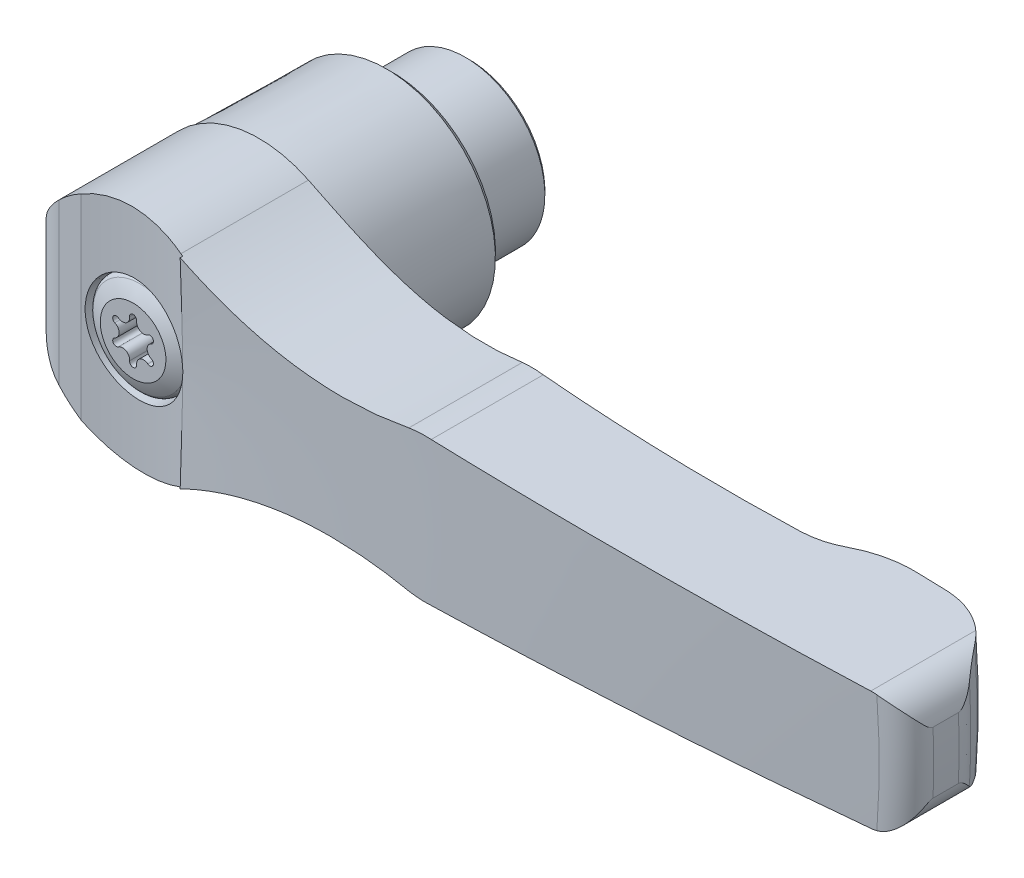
ISO-10303-21;
HEADER;
FILE_DESCRIPTION(('STEP AP214'),'2;1');
FILE_NAME('part.step','',(''),(''),'','','');
FILE_SCHEMA(('AUTOMOTIVE_DESIGN { 1 0 10303 214 1 1 1 1 }'));
ENDSEC;
DATA;
#1=APPLICATION_CONTEXT('core data for automotive mechanical design processes');
#2=APPLICATION_PROTOCOL_DEFINITION('international standard','automotive_design',2000,#1);
#3=PRODUCT_CONTEXT('',#1,'mechanical');
#4=PRODUCT('Part','Part','',(#3));
#5=PRODUCT_RELATED_PRODUCT_CATEGORY('part','',(#4));
#6=PRODUCT_DEFINITION_FORMATION('','',#4);
#7=PRODUCT_DEFINITION_CONTEXT('part definition',#1,'design');
#8=PRODUCT_DEFINITION('design','',#6,#7);
#9=PRODUCT_DEFINITION_SHAPE('','',#8);
#10=(LENGTH_UNIT() NAMED_UNIT(*) SI_UNIT(.MILLI.,.METRE.));
#11=(NAMED_UNIT(*) PLANE_ANGLE_UNIT() SI_UNIT($,.RADIAN.));
#12=(NAMED_UNIT(*) SI_UNIT($,.STERADIAN.) SOLID_ANGLE_UNIT());
#13=UNCERTAINTY_MEASURE_WITH_UNIT(LENGTH_MEASURE(1.E-05),#10,'distance_accuracy_value','');
#14=(GEOMETRIC_REPRESENTATION_CONTEXT(3) GLOBAL_UNCERTAINTY_ASSIGNED_CONTEXT((#13)) GLOBAL_UNIT_ASSIGNED_CONTEXT((#10,
#11,#12)) REPRESENTATION_CONTEXT('',''));
#15=CARTESIAN_POINT('',(0.,0.,0.));
#16=DIRECTION('',(0.,0.,1.));
#17=DIRECTION('',(1.,0.,0.));
#18=AXIS2_PLACEMENT_3D('',#15,#16,#17);
#19=CARTESIAN_POINT('',(0.,0.,28.6698930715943));
#20=DIRECTION('',(0.,0.,1.));
#21=DIRECTION('',(0.,-1.,0.));
#22=AXIS2_PLACEMENT_3D('',#19,#20,#21);
#23=CONICAL_SURFACE('',#22,4.38770360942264,0.0279252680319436);
#24=CARTESIAN_POINT('',(0.,0.,28.6701538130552));
#25=DIRECTION('',(0.,0.,-1.));
#26=DIRECTION('',(0.,1.,0.));
#27=AXIS2_PLACEMENT_3D('',#24,#25,#26);
#28=CIRCLE('',#27,4.38771089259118);
#29=CARTESIAN_POINT('',(4.37640128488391,0.314814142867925,28.6698627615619));
#30=VERTEX_POINT('',#29);
#31=CARTESIAN_POINT('',(4.37640128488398,-0.314814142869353,28.6698627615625));
#32=VERTEX_POINT('',#31);
#33=EDGE_CURVE('E681',#30,#32,#28,.T.);
#34=ORIENTED_EDGE('',*,*,#33,.F.);
#35=CARTESIAN_POINT('',(4.37638813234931,0.314810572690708,28.6696312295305));
#36=CARTESIAN_POINT('',(4.36759225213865,0.436746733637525,28.66825751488));
#37=CARTESIAN_POINT('',(4.35365143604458,0.558298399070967,28.666073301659));
#38=CARTESIAN_POINT('',(4.31565104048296,0.799759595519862,28.6601580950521));
#39=CARTESIAN_POINT('',(4.29159247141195,0.919669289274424,28.6564272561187));
#40=CARTESIAN_POINT('',(4.23356084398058,1.15685508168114,28.6474980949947));
#41=CARTESIAN_POINT('',(4.19959976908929,1.27413418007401,28.6423015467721));
#42=CARTESIAN_POINT('',(4.1220143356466,1.50538038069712,28.6305521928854));
#43=CARTESIAN_POINT('',(4.07838997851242,1.61934748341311,28.6239993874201));
#44=CARTESIAN_POINT('',(3.9818019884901,1.84317559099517,28.6096750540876));
#45=CARTESIAN_POINT('',(3.92883814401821,1.95303650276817,28.6019034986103));
#46=CARTESIAN_POINT('',(3.81394032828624,2.16793056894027,28.5852999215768));
#47=CARTESIAN_POINT('',(3.75200305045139,2.2729619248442,28.5764675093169));
#48=CARTESIAN_POINT('',(3.61964681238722,2.4773951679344,28.5579277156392));
#49=CARTESIAN_POINT('',(3.5492312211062,2.57679926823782,28.5482206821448));
#50=CARTESIAN_POINT('',(3.40037126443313,2.76938620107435,28.5281177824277));
#51=CARTESIAN_POINT('',(3.32192391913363,2.86256670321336,28.5177216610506));
#52=CARTESIAN_POINT('',(3.15690159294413,3.04277004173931,28.4963587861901));
#53=CARTESIAN_POINT('',(3.07026568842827,3.12973662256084,28.485388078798));
#54=CARTESIAN_POINT('',(2.88998825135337,3.29610688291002,28.4631610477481));
#55=CARTESIAN_POINT('',(2.7963441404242,3.37550775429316,28.4519046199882));
#56=CARTESIAN_POINT('',(2.60274956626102,3.52615287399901,28.4293219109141));
#57=CARTESIAN_POINT('',(2.50280041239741,3.59739880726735,28.4179956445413));
#58=CARTESIAN_POINT('',(2.29723122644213,3.7312887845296,28.3954704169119));
#59=CARTESIAN_POINT('',(2.19160910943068,3.79392963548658,28.384271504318));
#60=CARTESIAN_POINT('',(1.97464335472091,3.91058078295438,28.3621157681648));
#61=CARTESIAN_POINT('',(1.86326268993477,3.96452269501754,28.3511613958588));
#62=CARTESIAN_POINT('',(1.63625749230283,4.06283483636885,28.3297617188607));
#63=CARTESIAN_POINT('',(1.52063139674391,4.10720149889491,28.319316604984));
#64=CARTESIAN_POINT('',(1.28603822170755,4.18599718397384,28.2991083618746));
#65=CARTESIAN_POINT('',(1.16707260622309,4.22043048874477,28.2893449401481));
#66=CARTESIAN_POINT('',(0.926553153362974,4.27913923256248,28.2706331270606));
#67=CARTESIAN_POINT('',(0.804998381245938,4.30341093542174,28.2616850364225));
#68=CARTESIAN_POINT('',(0.56050926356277,4.34153901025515,28.2447454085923));
#69=CARTESIAN_POINT('',(0.437579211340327,4.35542170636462,28.2367514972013));
#70=CARTESIAN_POINT('',(0.190912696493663,4.37277111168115,28.221778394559));
#71=CARTESIAN_POINT('',(0.067175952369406,4.37623396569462,28.2147995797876));
#72=CARTESIAN_POINT('',(-0.303814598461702,4.37087373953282,28.1954907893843));
#73=CARTESIAN_POINT('',(-0.551121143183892,4.34634416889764,28.1847695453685));
#74=CARTESIAN_POINT('',(-1.03650636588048,4.2562142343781,28.1678211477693));
#75=CARTESIAN_POINT('',(-1.27463404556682,4.19087822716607,28.1615656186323));
#76=CARTESIAN_POINT('',(-1.73666742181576,4.02119102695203,28.1530588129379));
#77=CARTESIAN_POINT('',(-1.96057336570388,3.91684051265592,28.1508074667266));
#78=CARTESIAN_POINT('',(-2.38718935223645,3.67236312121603,28.1495611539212));
#79=CARTESIAN_POINT('',(-2.58994945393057,3.53232357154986,28.1505583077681));
#80=CARTESIAN_POINT('',(-2.96915676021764,3.22029180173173,28.1547714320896));
#81=CARTESIAN_POINT('',(-3.14560364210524,3.04829918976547,28.1579874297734));
#82=CARTESIAN_POINT('',(-3.46742933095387,2.67692052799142,28.1654937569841));
#83=CARTESIAN_POINT('',(-3.61276071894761,2.4774934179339,28.169785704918));
#84=CARTESIAN_POINT('',(-3.86788705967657,2.05707167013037,28.1783049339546));
#85=CARTESIAN_POINT('',(-3.97768202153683,1.8360770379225,28.1825322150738));
#86=CARTESIAN_POINT('',(-4.15862712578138,1.37869612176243,28.1899517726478));
#87=CARTESIAN_POINT('',(-4.22976508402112,1.14230501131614,28.1931437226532));
#88=CARTESIAN_POINT('',(-4.33129348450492,0.660912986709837,28.1978079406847));
#89=CARTESIAN_POINT('',(-4.36168448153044,0.415912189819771,28.1992802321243));
#90=CARTESIAN_POINT('',(-4.38082304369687,-0.0752514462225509,28.2001998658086));
#91=CARTESIAN_POINT('',(-4.36964881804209,-0.321411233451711,28.1996510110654));
#92=CARTESIAN_POINT('',(-4.30615469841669,-0.808352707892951,28.1966493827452));
#93=CARTESIAN_POINT('',(-4.25383484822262,-1.04913440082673,28.1941966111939));
#94=CARTESIAN_POINT('',(-4.10958617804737,-1.51838976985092,28.1879011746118));
#95=CARTESIAN_POINT('',(-4.01767438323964,-1.74686868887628,28.1840591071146));
#96=CARTESIAN_POINT('',(-3.79686828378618,-2.18518682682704,28.1758300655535));
#97=CARTESIAN_POINT('',(-3.66797348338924,-2.39502579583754,28.1714430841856));
#98=CARTESIAN_POINT('',(-3.37658641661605,-2.79052813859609,28.1631865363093));
#99=CARTESIAN_POINT('',(-3.21403231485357,-2.97614597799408,28.1593179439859));
#100=CARTESIAN_POINT('',(-2.86008476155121,-3.31751162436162,28.1532728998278));
#101=CARTESIAN_POINT('',(-2.66869127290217,-3.47325939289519,28.1510964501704));
#102=CARTESIAN_POINT('',(-2.26239270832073,-3.75056183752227,28.1495386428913));
#103=CARTESIAN_POINT('',(-2.04747487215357,-3.87209782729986,28.1501588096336));
#104=CARTESIAN_POINT('',(-1.60034041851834,-4.07742306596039,28.1550942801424));
#105=CARTESIAN_POINT('',(-1.36812412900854,-4.1612130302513,28.1594095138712));
#106=CARTESIAN_POINT('',(-0.893482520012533,-4.28860890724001,28.1722769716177));
#107=CARTESIAN_POINT('',(-0.651074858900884,-4.33228155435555,28.1808221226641));
#108=CARTESIAN_POINT('',(-0.162434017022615,-4.3784984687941,28.2022857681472));
#109=CARTESIAN_POINT('',(0.0837991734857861,-4.38104263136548,28.2152042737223));
#110=CARTESIAN_POINT('',(0.450557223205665,-4.35410663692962,28.2375786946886));
#111=CARTESIAN_POINT('',(0.572490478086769,-4.33997502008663,28.2455451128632));
#112=CARTESIAN_POINT('',(0.814673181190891,-4.3015689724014,28.262388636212));
#113=CARTESIAN_POINT('',(0.934923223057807,-4.27729821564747,28.271265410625));
#114=CARTESIAN_POINT('',(1.17294984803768,-4.21878135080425,28.2898222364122));
#115=CARTESIAN_POINT('',(1.2907254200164,-4.1845312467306,28.2995026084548));
#116=CARTESIAN_POINT('',(1.52290562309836,-4.10632591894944,28.319522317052));
#117=CARTESIAN_POINT('',(1.63731144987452,-4.0623741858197,28.3298614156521));
#118=CARTESIAN_POINT('',(1.86270011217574,-3.9647705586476,28.3511080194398));
#119=CARTESIAN_POINT('',(1.9736573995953,-3.91106034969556,28.3620186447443));
#120=CARTESIAN_POINT('',(2.19059187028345,-3.79452642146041,28.3841641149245));
#121=CARTESIAN_POINT('',(2.29657083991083,-3.73170600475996,28.3953988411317));
#122=CARTESIAN_POINT('',(2.50289007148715,-3.59735327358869,28.4180046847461));
#123=CARTESIAN_POINT('',(2.60322844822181,-3.52581807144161,28.4293758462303));
#124=CARTESIAN_POINT('',(2.79749365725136,-3.37457510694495,28.4520406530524));
#125=CARTESIAN_POINT('',(2.89142283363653,-3.29487035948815,28.4633343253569));
#126=CARTESIAN_POINT('',(3.07268721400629,-3.12741243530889,28.4856903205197));
#127=CARTESIAN_POINT('',(3.15998858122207,-3.03962244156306,28.4967512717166));
#128=CARTESIAN_POINT('',(3.32684040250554,-2.85696457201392,28.5183655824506));
#129=CARTESIAN_POINT('',(3.40639373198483,-2.76209934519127,28.5289191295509));
#130=CARTESIAN_POINT('',(3.55727025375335,-2.5658447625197,28.5493194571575));
#131=CARTESIAN_POINT('',(3.62858698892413,-2.46445038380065,28.559165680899));
#132=CARTESIAN_POINT('',(3.76236832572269,-2.25595422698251,28.577935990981));
#133=CARTESIAN_POINT('',(3.82483631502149,-2.1488546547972,28.5868604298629));
#134=CARTESIAN_POINT('',(3.94027260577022,-1.9300734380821,28.6035728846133));
#135=CARTESIAN_POINT('',(3.99327497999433,-1.8184100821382,28.6113649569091));
#136=CARTESIAN_POINT('',(4.08964142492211,-1.590970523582,28.6256827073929));
#137=CARTESIAN_POINT('',(4.13300929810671,-1.47519596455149,28.6322088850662));
#138=CARTESIAN_POINT('',(4.20974206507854,-1.24050512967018,28.6438484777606));
#139=CARTESIAN_POINT('',(4.24312178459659,-1.12159379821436,28.6489639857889));
#140=CARTESIAN_POINT('',(4.29969149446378,-0.881370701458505,28.6576807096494));
#141=CARTESIAN_POINT('',(4.32288741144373,-0.760060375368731,28.6612828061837));
#142=CARTESIAN_POINT('',(4.34882803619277,-0.584348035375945,28.6653234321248));
#143=CARTESIAN_POINT('',(4.35574888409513,-0.530548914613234,28.6664035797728));
#144=CARTESIAN_POINT('',(4.36757549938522,-0.422796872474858,28.6682515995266));
#145=CARTESIAN_POINT('',(4.37248393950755,-0.368844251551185,28.6690198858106));
#146=CARTESIAN_POINT('',(4.37638813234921,-0.314810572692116,28.6696312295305));
#147=B_SPLINE_CURVE_WITH_KNOTS('',3,(#35,#36,#37,#38,#39,#40,#41,#42,#43,#44,#45,#46,#47,#48,
#49,#50,#51,#52,#53,#54,#55,#56,#57,#58,#59,#60,#61,#62,#63,#64,#65,#66,#67,#68,#69,#70,#71,#72,
#73,#74,#75,#76,#77,#78,#79,#80,#81,#82,#83,#84,#85,#86,#87,#88,#89,#90,#91,#92,#93,#94,#95,#96,
#97,#98,#99,#100,#101,#102,#103,#104,#105,#106,#107,#108,#109,#110,#111,#112,#113,#114,#115,
#116,#117,#118,#119,#120,#121,#122,#123,#124,#125,#126,#127,#128,#129,#130,#131,#132,#133,#134,
#135,#136,#137,#138,#139,#140,#141,#142,#143,#144,#145,#146),.UNSPECIFIED.,.F.,.F.,(4,2,2,2,2,2,
2,2,2,2,2,2,2,2,2,2,2,2,2,2,2,2,2,2,2,2,2,2,2,2,2,2,2,2,2,2,2,2,2,2,2,2,2,2,2,2,2,2,2,2,2,2,2,2,
2,4),(0.,0.366665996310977,0.733295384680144,1.09948292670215,1.46567041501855,1.83186620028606,
2.19819726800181,2.56438324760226,2.93070558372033,3.30000778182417,3.66944652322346,
4.03880879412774,4.40830775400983,4.78058304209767,5.15299676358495,5.525249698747,
5.89763938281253,6.26908226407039,6.64066255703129,7.38300471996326,8.12058694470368,
8.85815633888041,9.5939380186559,10.3297287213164,11.0666328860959,11.803536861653,
12.540672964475,13.2777990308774,14.0135388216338,14.7492778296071,15.484700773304,
16.220133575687,16.9569296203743,17.6937266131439,18.4309252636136,19.1681099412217,
19.9040660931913,20.6400241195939,21.0086915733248,21.3772255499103,21.7459073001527,
22.1144566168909,22.485285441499,22.855980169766,23.2267980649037,23.59747960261,
23.969941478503,24.342264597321,24.7148776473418,25.08734765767,25.4584486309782,
25.8294028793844,26.1998037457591,26.569988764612,26.732716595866,26.8952275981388),.UNSPECIFIED.);
#148=EDGE_CURVE('E1294',#30,#32,#147,.T.);
#149=ORIENTED_EDGE('',*,*,#148,.T.);
#150=EDGE_LOOP('',(#34,#149));
#151=FACE_BOUND('',#150,.T.);
#152=CARTESIAN_POINT('',(0.,0.,25.5));
#153=DIRECTION('',(0.,0.,-1.));
#154=DIRECTION('',(-1.,0.,0.));
#155=AXIS2_PLACEMENT_3D('',#152,#153,#154);
#156=CIRCLE('',#155,4.29916047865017);
#157=CARTESIAN_POINT('',(-4.29916047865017,0.,25.5));
#158=VERTEX_POINT('',#157);
#159=EDGE_CURVE('E9',#158,#158,#156,.F.);
#160=ORIENTED_EDGE('',*,*,#159,.F.);
#161=EDGE_LOOP('',(#160));
#162=FACE_BOUND('',#161,.T.);
#163=ADVANCED_FACE('F14',(#151,#162),#23,.F.);
#164=CARTESIAN_POINT('',(6.45,0.,0.));
#165=DIRECTION('',(0.,0.,1.));
#166=DIRECTION('',(0.,-1.,0.));
#167=AXIS2_PLACEMENT_3D('',#164,#165,#166);
#168=PLANE('',#167);
#169=CARTESIAN_POINT('',(0.,0.,0.));
#170=DIRECTION('',(0.,0.,1.));
#171=DIRECTION('',(0.,-1.,0.));
#172=AXIS2_PLACEMENT_3D('',#169,#170,#171);
#173=CIRCLE('',#172,3.45);
#174=CARTESIAN_POINT('',(0.,-3.45,0.));
#175=VERTEX_POINT('',#174);
#176=EDGE_CURVE('E23',#175,#175,#173,.T.);
#177=ORIENTED_EDGE('',*,*,#176,.T.);
#178=EDGE_LOOP('',(#177));
#179=FACE_BOUND('',#178,.T.);
#180=CARTESIAN_POINT('',(0.,0.,0.));
#181=DIRECTION('',(0.,0.,1.));
#182=DIRECTION('',(0.,-1.,0.));
#183=AXIS2_PLACEMENT_3D('',#180,#181,#182);
#184=CIRCLE('',#183,6.45000000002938);
#185=CARTESIAN_POINT('',(0.,-6.45000000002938,0.));
#186=VERTEX_POINT('',#185);
#187=EDGE_CURVE('E385',#186,#186,#184,.T.);
#188=ORIENTED_EDGE('',*,*,#187,.F.);
#189=EDGE_LOOP('',(#188));
#190=FACE_BOUND('',#189,.T.);
#191=ADVANCED_FACE('F400',(#179,#190),#168,.F.);
#192=CARTESIAN_POINT('',(0.,0.,0.299999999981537));
#193=DIRECTION('',(0.,0.,1.));
#194=DIRECTION('',(0.,-1.,0.));
#195=AXIS2_PLACEMENT_3D('',#192,#193,#194);
#196=CONICAL_SURFACE('',#195,6.75000000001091,0.785398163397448);
#197=CARTESIAN_POINT('',(0.,0.,0.3));
#198=DIRECTION('',(0.,0.,1.));
#199=DIRECTION('',(0.,-1.,0.));
#200=AXIS2_PLACEMENT_3D('',#197,#198,#199);
#201=CIRCLE('',#200,6.75);
#202=CARTESIAN_POINT('',(0.,-6.75,0.3));
#203=VERTEX_POINT('',#202);
#204=EDGE_CURVE('E381',#203,#203,#201,.T.);
#205=ORIENTED_EDGE('',*,*,#204,.F.);
#206=EDGE_LOOP('',(#205));
#207=FACE_BOUND('',#206,.T.);
#208=ORIENTED_EDGE('',*,*,#187,.T.);
#209=EDGE_LOOP('',(#208));
#210=FACE_BOUND('',#209,.T.);
#211=ADVANCED_FACE('F707',(#207,#210),#196,.T.);
#212=CARTESIAN_POINT('',(0.,0.,0.));
#213=DIRECTION('',(0.,0.,1.));
#214=DIRECTION('',(0.,-1.,0.));
#215=AXIS2_PLACEMENT_3D('',#212,#213,#214);
#216=CYLINDRICAL_SURFACE('',#215,6.75);
#217=CARTESIAN_POINT('',(0.,0.,6.5));
#218=DIRECTION('',(0.,0.,1.));
#219=DIRECTION('',(0.,-1.,0.));
#220=AXIS2_PLACEMENT_3D('',#217,#218,#219);
#221=CIRCLE('',#220,6.75);
#222=CARTESIAN_POINT('',(0.,-6.75,6.5));
#223=VERTEX_POINT('',#222);
#224=EDGE_CURVE('E384',#223,#223,#221,.F.);
#225=ORIENTED_EDGE('',*,*,#224,.T.);
#226=EDGE_LOOP('',(#225));
#227=FACE_BOUND('',#226,.T.);
#228=ORIENTED_EDGE('',*,*,#204,.T.);
#229=EDGE_LOOP('',(#228));
#230=FACE_BOUND('',#229,.T.);
#231=ADVANCED_FACE('F1124',(#227,#230),#216,.T.);
#232=CARTESIAN_POINT('',(8.75,0.,6.5));
#233=DIRECTION('',(0.,0.,1.));
#234=DIRECTION('',(0.,-1.,0.));
#235=AXIS2_PLACEMENT_3D('',#232,#233,#234);
#236=PLANE('',#235);
#237=CARTESIAN_POINT('',(0.,0.,6.5));
#238=DIRECTION('',(0.,0.,1.));
#239=DIRECTION('',(0.,-1.,0.));
#240=AXIS2_PLACEMENT_3D('',#237,#238,#239);
#241=CIRCLE('',#240,8.75);
#242=CARTESIAN_POINT('',(0.,-8.75,6.5));
#243=VERTEX_POINT('',#242);
#244=EDGE_CURVE('E684',#243,#243,#241,.T.);
#245=ORIENTED_EDGE('',*,*,#244,.F.);
#246=EDGE_LOOP('',(#245));
#247=FACE_BOUND('',#246,.T.);
#248=ORIENTED_EDGE('',*,*,#224,.F.);
#249=EDGE_LOOP('',(#248));
#250=FACE_BOUND('',#249,.T.);
#251=ADVANCED_FACE('F1116',(#247,#250),#236,.F.);
#252=CARTESIAN_POINT('',(0.,0.,7.));
#253=DIRECTION('',(0.,0.,1.));
#254=DIRECTION('',(0.,-1.,0.));
#255=AXIS2_PLACEMENT_3D('',#252,#253,#254);
#256=CONICAL_SURFACE('',#255,9.25,0.785398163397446);
#257=CARTESIAN_POINT('',(0.,0.,7.));
#258=DIRECTION('',(0.,0.,1.));
#259=DIRECTION('',(0.,-1.,0.));
#260=AXIS2_PLACEMENT_3D('',#257,#258,#259);
#261=CIRCLE('',#260,9.25);
#262=CARTESIAN_POINT('',(0.,-9.25,6.99999999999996));
#263=VERTEX_POINT('',#262);
#264=EDGE_CURVE('E374',#263,#263,#261,.T.);
#265=ORIENTED_EDGE('',*,*,#264,.F.);
#266=EDGE_LOOP('',(#265));
#267=FACE_BOUND('',#266,.T.);
#268=ORIENTED_EDGE('',*,*,#244,.T.);
#269=EDGE_LOOP('',(#268));
#270=FACE_BOUND('',#269,.T.);
#271=ADVANCED_FACE('F664',(#267,#270),#256,.T.);
#272=CARTESIAN_POINT('',(-9.25,-19.1,7.));
#273=DIRECTION('',(-0.999862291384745,0.,-0.0165951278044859));
#274=DIRECTION('',(0.0165951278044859,0.,-0.999862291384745));
#275=AXIS2_PLACEMENT_3D('',#272,#273,#274);
#276=PLANE('',#275);
#277=CARTESIAN_POINT('',(1.01243252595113E-13,0.,-550.315755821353));
#278=DIRECTION('',(-0.999862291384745,0.,-0.0165951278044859));
#279=DIRECTION('',(-0.0165951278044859,0.,0.999862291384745));
#280=AXIS2_PLACEMENT_3D('',#277,#278,#279);
#281=ELLIPSE('',#280,575.470108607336,9.55);
#282=CARTESIAN_POINT('',(-9.4295477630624,1.51199503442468,17.8178159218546));
#283=VERTEX_POINT('',#282);
#284=CARTESIAN_POINT('',(-9.54958687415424,0.0888286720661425,25.0502146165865));
#285=VERTEX_POINT('',#284);
#286=EDGE_CURVE('E637',#283,#285,#281,.F.);
#287=ORIENTED_EDGE('',*,*,#286,.F.);
#288=CARTESIAN_POINT('',(-9.4295477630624,1.51199503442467,17.8178159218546));
#289=CARTESIAN_POINT('',(-9.42944136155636,1.26003673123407,17.8114051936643));
#290=CARTESIAN_POINT('',(-9.42936147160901,1.00805803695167,17.8065917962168));
#291=CARTESIAN_POINT('',(-9.42925471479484,0.504059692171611,17.8001596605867));
#292=CARTESIAN_POINT('',(-9.42922784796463,0.252040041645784,17.7985409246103));
#293=CARTESIAN_POINT('',(-9.42922749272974,0.,17.798519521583));
#294=B_SPLINE_CURVE_WITH_KNOTS('',3,(#288,#289,#290,#291,#292,#293),.UNSPECIFIED.,.F.,.F.,(4,2,
4),(0.,0.75607402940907,1.51214858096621),.UNSPECIFIED.);
#295=CARTESIAN_POINT('',(-9.42922749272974,0.,17.798519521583));
#296=VERTEX_POINT('',#295);
#297=EDGE_CURVE('E380',#283,#296,#294,.T.);
#298=ORIENTED_EDGE('',*,*,#297,.T.);
#299=CARTESIAN_POINT('',(-9.42922749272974,0.,17.798519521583));
#300=CARTESIAN_POINT('',(-9.42922784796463,-0.252040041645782,17.7985409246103));
#301=CARTESIAN_POINT('',(-9.42925471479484,-0.504059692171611,17.8001596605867));
#302=CARTESIAN_POINT('',(-9.42936147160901,-1.00805803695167,17.8065917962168));
#303=CARTESIAN_POINT('',(-9.42944136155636,-1.26003673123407,17.8114051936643));
#304=CARTESIAN_POINT('',(-9.4295477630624,-1.51199503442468,17.8178159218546));
#305=B_SPLINE_CURVE_WITH_KNOTS('',3,(#299,#300,#301,#302,#303,#304),.UNSPECIFIED.,.F.,.F.,(4,2,
4),(0.,0.756074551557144,1.51214858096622),.UNSPECIFIED.);
#306=CARTESIAN_POINT('',(-9.4295477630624,-1.5119950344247,17.8178159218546));
#307=VERTEX_POINT('',#306);
#308=EDGE_CURVE('E675',#296,#307,#305,.T.);
#309=ORIENTED_EDGE('',*,*,#308,.T.);
#310=CARTESIAN_POINT('',(1.01243252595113E-13,0.,-550.315755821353));
#311=DIRECTION('',(-0.999862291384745,0.,-0.0165951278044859));
#312=DIRECTION('',(-0.0165951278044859,0.,0.999862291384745));
#313=AXIS2_PLACEMENT_3D('',#310,#311,#312);
#314=ELLIPSE('',#313,575.470108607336,9.55);
#315=CARTESIAN_POINT('',(-9.54958687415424,-0.0888286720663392,25.0502146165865));
#316=VERTEX_POINT('',#315);
#317=EDGE_CURVE('E1256',#316,#307,#314,.F.);
#318=ORIENTED_EDGE('',*,*,#317,.F.);
#319=DIRECTION('',(0.,-1.,0.));
#320=VECTOR('',#319,1.);
#321=CARTESIAN_POINT('',(-9.54958687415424,-19.1,25.0502146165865));
#322=LINE('',#321,#320);
#323=EDGE_CURVE('E375',#285,#316,#322,.T.);
#324=ORIENTED_EDGE('',*,*,#323,.F.);
#325=EDGE_LOOP('',(#287,#298,#309,#318,#324));
#326=FACE_BOUND('',#325,.T.);
#327=ADVANCED_FACE('F659',(#326),#276,.T.);
#328=CARTESIAN_POINT('',(-6.69999999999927,-19.1,28.0962476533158));
#329=DIRECTION('',(-0.0601647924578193,0.,0.998188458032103));
#330=DIRECTION('',(-0.998188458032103,0.,-0.0601647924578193));
#331=AXIS2_PLACEMENT_3D('',#328,#329,#330);
#332=PLANE('',#331);
#333=CARTESIAN_POINT('',(0.,0.,28.500083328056));
#334=DIRECTION('',(-0.0601647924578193,0.,0.998188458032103));
#335=DIRECTION('',(0.998188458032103,0.,0.0601647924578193));
#336=AXIS2_PLACEMENT_3D('',#333,#334,#335);
#337=ELLIPSE('',#336,9.56733162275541,9.55);
#338=CARTESIAN_POINT('',(-6.69999999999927,6.80532879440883,28.0962476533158));
#339=VERTEX_POINT('',#338);
#340=CARTESIAN_POINT('',(-4.70000000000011,8.31339280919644,28.2167956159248));
#341=VERTEX_POINT('',#340);
#342=EDGE_CURVE('E648',#339,#341,#337,.F.);
#343=ORIENTED_EDGE('',*,*,#342,.F.);
#344=DIRECTION('',(0.,-1.,0.));
#345=VECTOR('',#344,1.);
#346=CARTESIAN_POINT('',(-6.69999999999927,-19.1,28.0962476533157));
#347=LINE('',#346,#345);
#348=CARTESIAN_POINT('',(-6.69999999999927,-6.80532879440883,28.0962476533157));
#349=VERTEX_POINT('',#348);
#350=EDGE_CURVE('E378',#349,#339,#347,.F.);
#351=ORIENTED_EDGE('',*,*,#350,.F.);
#352=CARTESIAN_POINT('',(0.,0.,28.500083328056));
#353=DIRECTION('',(-0.0601647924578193,0.,0.998188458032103));
#354=DIRECTION('',(0.998188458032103,0.,0.0601647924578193));
#355=AXIS2_PLACEMENT_3D('',#352,#353,#354);
#356=ELLIPSE('',#355,9.56733162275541,9.55);
#357=CARTESIAN_POINT('',(-4.70000000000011,-8.31339280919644,28.2167956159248));
#358=VERTEX_POINT('',#357);
#359=EDGE_CURVE('E1262',#358,#349,#356,.F.);
#360=ORIENTED_EDGE('',*,*,#359,.F.);
#361=DIRECTION('',(0.,-1.,0.));
#362=VECTOR('',#361,1.);
#363=CARTESIAN_POINT('',(-4.70000000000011,-19.1,28.2167956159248));
#364=LINE('',#363,#362);
#365=EDGE_CURVE('E1233',#358,#341,#364,.F.);
#366=ORIENTED_EDGE('',*,*,#365,.T.);
#367=EDGE_LOOP('',(#343,#351,#360,#366));
#368=FACE_BOUND('',#367,.T.);
#369=ADVANCED_FACE('F654',(#368),#332,.T.);
#370=CARTESIAN_POINT('',(-6.55,-19.1,25.1));
#371=DIRECTION('',(0.,-1.,0.));
#372=DIRECTION('',(1.,0.,0.));
#373=AXIS2_PLACEMENT_3D('',#370,#371,#372);
#374=CYLINDRICAL_SURFACE('',#373,3.);
#375=CARTESIAN_POINT('',(-9.55,0.,25.1));
#376=CARTESIAN_POINT('',(-9.55,3.47671001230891E-08,25.1001435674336));
#377=CARTESIAN_POINT('',(-9.54999998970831,0.000424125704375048,25.1002871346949));
#378=CARTESIAN_POINT('',(-9.54999993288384,0.0013735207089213,25.1006836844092));
#379=CARTESIAN_POINT('',(-9.54999986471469,0.00172979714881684,25.1009366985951));
#380=CARTESIAN_POINT('',(-9.54999948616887,0.00320746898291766,25.1018926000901));
#381=CARTESIAN_POINT('',(-9.54999896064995,0.00456206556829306,25.102594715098));
#382=CARTESIAN_POINT('',(-9.54999589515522,0.00980280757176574,25.1053821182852));
#383=CARTESIAN_POINT('',(-9.54999142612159,0.0134222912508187,25.1074690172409));
#384=CARTESIAN_POINT('',(-9.54984305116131,0.0944102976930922,25.154064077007));
#385=CARTESIAN_POINT('',(-9.54871139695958,0.175284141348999,25.1985505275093));
#386=CARTESIAN_POINT('',(-9.5444403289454,0.336150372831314,25.2880374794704));
#387=CARTESIAN_POINT('',(-9.5412756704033,0.41611862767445,25.3330373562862));
#388=CARTESIAN_POINT('',(-9.53306454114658,0.573610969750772,25.4212745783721));
#389=CARTESIAN_POINT('',(-9.52809098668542,0.651117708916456,25.464516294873));
#390=CARTESIAN_POINT('',(-9.51627073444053,0.805689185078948,25.5506915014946));
#391=CARTESIAN_POINT('',(-9.50943037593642,0.882754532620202,25.5936255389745));
#392=CARTESIAN_POINT('',(-9.48445472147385,1.12996192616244,25.7310467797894));
#393=CARTESIAN_POINT('',(-9.46266049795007,1.30002022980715,25.8251235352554));
#394=CARTESIAN_POINT('',(-9.40954494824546,1.64104493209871,26.0124493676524));
#395=CARTESIAN_POINT('',(-9.37814208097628,1.81200629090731,26.1056840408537));
#396=CARTESIAN_POINT('',(-9.31379295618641,2.11521576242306,26.2693440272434));
#397=CARTESIAN_POINT('',(-9.28274317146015,2.24761769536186,26.3402306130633));
#398=CARTESIAN_POINT('',(-9.21483141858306,2.51155601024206,26.4801106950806));
#399=CARTESIAN_POINT('',(-9.1779819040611,2.64309363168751,26.5491078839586));
#400=CARTESIAN_POINT('',(-9.09908481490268,2.90297154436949,26.6837096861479));
#401=CARTESIAN_POINT('',(-9.05714892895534,3.03132520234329,26.7493538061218));
#402=CARTESIAN_POINT('',(-8.96742994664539,3.2872629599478,26.8782580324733));
#403=CARTESIAN_POINT('',(-8.9196441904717,3.41484668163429,26.941517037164));
#404=CARTESIAN_POINT('',(-8.79975726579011,3.71503866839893,27.087578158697));
#405=CARTESIAN_POINT('',(-8.7251146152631,3.88723290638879,27.1691685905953));
#406=CARTESIAN_POINT('',(-8.56416880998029,4.2300744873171,27.3261666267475));
#407=CARTESIAN_POINT('',(-8.4778157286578,4.4007116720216,27.4015454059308));
#408=CARTESIAN_POINT('',(-8.28951988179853,4.74622896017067,27.5472095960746));
#409=CARTESIAN_POINT('',(-8.18707228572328,4.92098334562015,27.6171448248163));
#410=CARTESIAN_POINT('',(-7.96936829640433,5.26623550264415,27.7460103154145));
#411=CARTESIAN_POINT('',(-7.85413022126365,5.43673894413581,27.8049559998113));
#412=CARTESIAN_POINT('',(-7.64561682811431,5.72441551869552,27.8943766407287));
#413=CARTESIAN_POINT('',(-7.55551597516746,5.84286462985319,27.9281691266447));
#414=CARTESIAN_POINT('',(-7.36878441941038,6.07666798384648,27.9877671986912));
#415=CARTESIAN_POINT('',(-7.2721523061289,6.19202155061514,28.0135710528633));
#416=CARTESIAN_POINT('',(-7.0736511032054,6.41781298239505,28.0556686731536));
#417=CARTESIAN_POINT('',(-6.97184621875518,6.52828924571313,28.0720576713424));
#418=CARTESIAN_POINT('',(-6.76252380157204,6.74488219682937,28.0943126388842));
#419=CARTESIAN_POINT('',(-6.65500601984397,6.85099869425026,28.1001781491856));
#420=CARTESIAN_POINT('',(-6.46343795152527,7.03128991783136,28.0998606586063));
#421=CARTESIAN_POINT('',(-6.38048824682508,7.10664323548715,28.0963952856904));
#422=CARTESIAN_POINT('',(-6.21235451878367,7.25407788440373,28.0821322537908));
#423=CARTESIAN_POINT('',(-6.12717105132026,7.32616001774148,28.0713364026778));
#424=CARTESIAN_POINT('',(-5.955080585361,7.46671649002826,28.0417159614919));
#425=CARTESIAN_POINT('',(-5.86817218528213,7.53518771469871,28.0228845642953));
#426=CARTESIAN_POINT('',(-5.69355294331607,7.6679866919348,27.9765732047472));
#427=CARTESIAN_POINT('',(-5.60584224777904,7.73231518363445,27.9490947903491));
#428=CARTESIAN_POINT('',(-5.37383569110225,7.8965468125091,27.8640863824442));
#429=CARTESIAN_POINT('',(-5.22954554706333,7.9926221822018,27.7986060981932));
#430=CARTESIAN_POINT('',(-5.01773611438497,8.12600028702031,27.6804530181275));
#431=CARTESIAN_POINT('',(-4.94788689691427,8.1686799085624,27.6377332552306));
#432=CARTESIAN_POINT('',(-4.8104935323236,8.25033380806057,27.5455968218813));
#433=CARTESIAN_POINT('',(-4.74294828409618,8.28930987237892,27.4961834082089));
#434=CARTESIAN_POINT('',(-4.61056271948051,8.36367281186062,27.3903740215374));
#435=CARTESIAN_POINT('',(-4.54574333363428,8.3990341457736,27.3339338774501));
#436=CARTESIAN_POINT('',(-4.42019774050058,8.46577835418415,27.2145781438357));
#437=CARTESIAN_POINT('',(-4.35946970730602,8.4971630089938,27.1516654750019));
#438=CARTESIAN_POINT('',(-4.24293765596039,8.55594777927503,27.0196895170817));
#439=CARTESIAN_POINT('',(-4.18713404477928,8.58334756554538,26.9506257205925));
#440=CARTESIAN_POINT('',(-4.0812939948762,8.63417541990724,26.806889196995));
#441=CARTESIAN_POINT('',(-4.03125694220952,8.65760391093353,26.7322170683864));
#442=CARTESIAN_POINT('',(-3.90083205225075,8.71748250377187,26.5169917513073));
#443=CARTESIAN_POINT('',(-3.82753078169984,8.7496789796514,26.3708197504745));
#444=CARTESIAN_POINT('',(-3.70530262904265,8.80214203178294,26.0667360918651));
#445=CARTESIAN_POINT('',(-3.6563685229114,8.82241214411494,25.9088279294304));
#446=CARTESIAN_POINT('',(-3.58669946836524,8.85095678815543,25.5936337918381));
#447=CARTESIAN_POINT('',(-3.56475897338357,8.8597453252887,25.4366603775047));
#448=CARTESIAN_POINT('',(-3.54590998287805,8.86730708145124,25.1209897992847));
#449=CARTESIAN_POINT('',(-3.54899880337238,8.86608137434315,24.9622928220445));
#450=CARTESIAN_POINT('',(-3.57992840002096,8.85363637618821,24.6492415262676));
#451=CARTESIAN_POINT('',(-3.60753685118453,8.84251088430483,24.4948604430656));
#452=CARTESIAN_POINT('',(-3.686063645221,8.81006376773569,24.1932781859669));
#453=CARTESIAN_POINT('',(-3.73698074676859,8.7887426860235,24.0460766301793));
#454=CARTESIAN_POINT('',(-3.86017848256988,8.73533137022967,23.7625338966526));
#455=CARTESIAN_POINT('',(-3.93251587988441,8.70321249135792,23.6262228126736));
#456=CARTESIAN_POINT('',(-4.09541934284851,8.62774986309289,23.368444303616));
#457=CARTESIAN_POINT('',(-4.18598535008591,8.5844061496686,23.2469768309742));
#458=CARTESIAN_POINT('',(-4.3835634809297,8.48524049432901,23.0191927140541));
#459=CARTESIAN_POINT('',(-4.49088076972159,8.42917584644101,22.9132473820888));
#460=CARTESIAN_POINT('',(-4.71597947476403,8.30533115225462,22.7212884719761));
#461=CARTESIAN_POINT('',(-4.83376196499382,8.23754990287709,22.6352769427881));
#462=CARTESIAN_POINT('',(-5.08355636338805,8.08595728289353,22.4784048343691));
#463=CARTESIAN_POINT('',(-5.21599086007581,8.0013678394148,22.4089779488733));
#464=CARTESIAN_POINT('',(-5.48298659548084,7.82082800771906,22.2923775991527));
#465=CARTESIAN_POINT('',(-5.61754980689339,7.72486647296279,22.2452261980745));
#466=CARTESIAN_POINT('',(-5.84755511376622,7.55137315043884,22.1816811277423));
#467=CARTESIAN_POINT('',(-5.9434498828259,7.47615707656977,22.1603779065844));
#468=CARTESIAN_POINT('',(-6.13329531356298,7.32121517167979,22.1275201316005));
#469=CARTESIAN_POINT('',(-6.22724527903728,7.24148776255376,22.1159690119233));
#470=CARTESIAN_POINT('',(-6.41225725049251,7.07818317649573,22.1017285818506));
#471=CARTESIAN_POINT('',(-6.50332159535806,6.99460925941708,22.0990319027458));
#472=CARTESIAN_POINT('',(-6.68208625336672,6.82403828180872,22.1015760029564));
#473=CARTESIAN_POINT('',(-6.76978559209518,6.73704024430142,22.1068190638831));
#474=CARTESIAN_POINT('',(-6.97625280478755,6.52414074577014,22.1279597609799));
#475=CARTESIAN_POINT('',(-7.09317594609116,6.39678691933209,22.1473193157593));
#476=CARTESIAN_POINT('',(-7.31887069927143,6.13728311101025,22.1978934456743));
#477=CARTESIAN_POINT('',(-7.42763838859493,6.0051308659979,22.2291136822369));
#478=CARTESIAN_POINT('',(-7.63812605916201,5.73508834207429,22.3020440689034));
#479=CARTESIAN_POINT('',(-7.73972802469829,5.59714403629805,22.3438930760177));
#480=CARTESIAN_POINT('',(-7.93408325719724,5.31805820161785,22.4361903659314));
#481=CARTESIAN_POINT('',(-8.02683920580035,5.176917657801,22.4866360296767));
#482=CARTESIAN_POINT('',(-8.24980156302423,4.81751224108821,22.6229913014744));
#483=CARTESIAN_POINT('',(-8.37426162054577,4.59747182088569,22.7136613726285));
#484=CARTESIAN_POINT('',(-8.60363827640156,4.15243763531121,22.9079226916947));
#485=CARTESIAN_POINT('',(-8.70851443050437,3.92743466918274,23.0115399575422));
#486=CARTESIAN_POINT('',(-8.89364636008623,3.48701966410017,23.2222758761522));
#487=CARTESIAN_POINT('',(-8.97496602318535,3.27179358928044,23.3288567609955));
#488=CARTESIAN_POINT('',(-9.12062405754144,2.84045818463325,23.5478797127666));
#489=CARTESIAN_POINT('',(-9.18506623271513,2.62436297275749,23.6602806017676));
#490=CARTESIAN_POINT('',(-9.26410174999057,2.32097248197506,23.820838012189));
#491=CARTESIAN_POINT('',(-9.28537933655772,2.23431431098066,23.8670103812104));
#492=CARTESIAN_POINT('',(-9.32541816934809,2.06082435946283,23.959993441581));
#493=CARTESIAN_POINT('',(-9.34418091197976,1.97399271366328,24.0068037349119));
#494=CARTESIAN_POINT('',(-9.37958405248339,1.79835785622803,24.1019601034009));
#495=CARTESIAN_POINT('',(-9.39617308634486,1.70955070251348,24.1503179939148));
#496=CARTESIAN_POINT('',(-9.42681937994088,1.53158407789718,24.2476394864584));
#497=CARTESIAN_POINT('',(-9.4408711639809,1.44242425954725,24.296604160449));
#498=CARTESIAN_POINT('',(-9.47029095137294,1.23688333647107,24.4098656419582));
#499=CARTESIAN_POINT('',(-9.48476525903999,1.12044890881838,24.4743078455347));
#500=CARTESIAN_POINT('',(-9.50929003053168,0.888497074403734,24.6031447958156));
#501=CARTESIAN_POINT('',(-9.51937783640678,0.772980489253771,24.6675350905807));
#502=CARTESIAN_POINT('',(-9.5345920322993,0.552299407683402,24.790656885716));
#503=CARTESIAN_POINT('',(-9.54009172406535,0.447168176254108,24.8493594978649));
#504=CARTESIAN_POINT('',(-9.54581598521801,0.288015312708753,24.9386824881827));
#505=CARTESIAN_POINT('',(-9.5473054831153,0.233694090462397,24.9692511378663));
#506=CARTESIAN_POINT('',(-9.54933602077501,0.124477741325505,25.0300231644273));
#507=CARTESIAN_POINT('',(-9.54988855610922,0.0695980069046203,25.0602263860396));
#508=CARTESIAN_POINT('',(-9.54999142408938,0.0134216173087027,25.0925303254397));
#509=CARTESIAN_POINT('',(-9.54999589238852,0.00980484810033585,25.0946165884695));
#510=CARTESIAN_POINT('',(-9.54999895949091,0.00456470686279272,25.0974038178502));
#511=CARTESIAN_POINT('',(-9.54999948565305,0.00320907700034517,25.0981064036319));
#512=CARTESIAN_POINT('',(-9.54999986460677,0.00173053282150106,25.0990629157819));
#513=CARTESIAN_POINT('',(-9.54999993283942,0.00137409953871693,25.0993160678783));
#514=CARTESIAN_POINT('',(-9.54999998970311,0.000424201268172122,25.0997127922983));
#515=CARTESIAN_POINT('',(-9.55,-3.47759051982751E-08,25.0998563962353));
#516=CARTESIAN_POINT('',(-9.55,0.,25.1));
#517=B_SPLINE_CURVE_WITH_KNOTS('',3,(#375,#376,#377,#378,#379,#380,#381,#382,#383,#384,#385,
#386,#387,#388,#389,#390,#391,#392,#393,#394,#395,#396,#397,#398,#399,#400,#401,#402,#403,#404,
#405,#406,#407,#408,#409,#410,#411,#412,#413,#414,#415,#416,#417,#418,#419,#420,#421,#422,#423,
#424,#425,#426,#427,#428,#429,#430,#431,#432,#433,#434,#435,#436,#437,#438,#439,#440,#441,#442,
#443,#444,#445,#446,#447,#448,#449,#450,#451,#452,#453,#454,#455,#456,#457,#458,#459,#460,#461,
#462,#463,#464,#465,#466,#467,#468,#469,#470,#471,#472,#473,#474,#475,#476,#477,#478,#479,#480,
#481,#482,#483,#484,#485,#486,#487,#488,#489,#490,#491,#492,#493,#494,#495,#496,#497,#498,#499,
#500,#501,#502,#503,#504,#505,#506,#507,#508,#509,#510,#511,#512,#513,#514,#515,#516),
.UNSPECIFIED.,.T.,.F.,(4,2,2,2,2,2,2,2,2,2,2,2,2,2,2,2,2,2,2,2,2,2,2,2,2,2,2,2,2,2,2,2,2,2,2,2,
2,2,2,2,2,2,2,2,2,2,2,2,2,2,2,2,2,2,2,2,2,2,2,2,2,2,2,2,2,2,2,2,2,2,4),(0.,0.000880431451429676,
0.00243160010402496,0.00674349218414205,0.0195448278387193,0.292570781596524,0.569054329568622,
0.835444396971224,1.100940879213,1.68733296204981,2.27884620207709,2.73880759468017,
3.19779446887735,3.64808683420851,4.09858470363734,4.7121040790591,5.32832658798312,
5.97060769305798,6.61198053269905,7.06948666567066,7.52709191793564,7.97998303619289,
8.43289390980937,8.76897667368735,9.10497658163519,9.44126169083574,9.77748663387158,
10.3306557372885,10.6073799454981,10.8839699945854,11.1623959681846,11.4406968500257,
11.7190207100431,11.9973149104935,12.4945187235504,12.9915750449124,13.4655162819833,
13.9394066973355,14.4088543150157,14.8782769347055,15.3489548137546,15.8196311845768,
16.3001819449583,16.780782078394,17.2941651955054,17.808055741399,18.1787484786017,
18.54957169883,18.9200862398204,19.2907072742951,19.8118239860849,20.3331897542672,
20.8617526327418,21.3901547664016,22.1945693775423,23.000627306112,23.7606591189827,
24.5159003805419,24.8172874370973,25.1184943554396,25.4258729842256,25.7339072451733,
26.1353797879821,26.5333643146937,26.8944471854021,27.0821321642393,27.2674973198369,
27.2802946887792,27.2846094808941,27.2861614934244,27.2870421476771),.UNSPECIFIED.);
#518=CARTESIAN_POINT('',(-9.55,-2.23035405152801E-07,25.0999998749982));
#519=VERTEX_POINT('',#518);
#520=EDGE_CURVE('E641',#519,#339,#517,.T.);
#521=ORIENTED_EDGE('',*,*,#520,.F.);
#522=CARTESIAN_POINT('',(-6.69999999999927,-6.80532879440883,28.0962476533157));
#523=CARTESIAN_POINT('',(-6.81996946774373,-6.68725177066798,28.0902004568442));
#524=CARTESIAN_POINT('',(-6.93649081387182,-6.56625473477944,28.077190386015));
#525=CARTESIAN_POINT('',(-7.16193168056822,-6.31957018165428,28.0391558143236));
#526=CARTESIAN_POINT('',(-7.27086521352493,-6.19389200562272,28.014154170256));
#527=CARTESIAN_POINT('',(-7.47996613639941,-5.93965552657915,27.9542734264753));
#528=CARTESIAN_POINT('',(-7.58020183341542,-5.81113200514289,27.9194825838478));
#529=CARTESIAN_POINT('',(-7.77288444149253,-5.55076668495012,27.8414168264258));
#530=CARTESIAN_POINT('',(-7.8653262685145,-5.4189227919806,27.7981364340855));
#531=CARTESIAN_POINT('',(-8.08527935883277,-5.08794110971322,27.6816755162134));
#532=CARTESIAN_POINT('',(-8.20806234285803,-4.88717024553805,27.6041723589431));
#533=CARTESIAN_POINT('',(-8.43659039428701,-4.4811559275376,27.4368437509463));
#534=CARTESIAN_POINT('',(-8.54233044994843,-4.27591117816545,27.3470146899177));
#535=CARTESIAN_POINT('',(-8.73776973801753,-3.86092720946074,27.1572579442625));
#536=CARTESIAN_POINT('',(-8.82737926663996,-3.65116970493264,27.0572783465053));
#537=CARTESIAN_POINT('',(-8.99035400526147,-3.22911960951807,26.8498759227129));
#538=CARTESIAN_POINT('',(-9.06372075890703,-3.01682726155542,26.7424538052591));
#539=CARTESIAN_POINT('',(-9.19977329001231,-2.57379717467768,26.5134302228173));
#540=CARTESIAN_POINT('',(-9.26119179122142,-2.34290423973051,26.3913749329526));
#541=CARTESIAN_POINT('',(-9.3662171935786,-1.87961094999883,26.142666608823));
#542=CARTESIAN_POINT('',(-9.40982093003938,-1.64721033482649,26.0160127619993));
#543=CARTESIAN_POINT('',(-9.51423453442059,-0.949863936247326,25.632354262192));
#544=CARTESIAN_POINT('',(-9.54915312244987,-0.483098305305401,25.370765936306));
#545=CARTESIAN_POINT('',(-9.54999492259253,-0.0113662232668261,25.1063705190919));
#546=CARTESIAN_POINT('',(-9.54999999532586,-0.00568305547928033,25.1031852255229));
#547=CARTESIAN_POINT('',(-9.55,0.,25.1));
#548=B_SPLINE_CURVE_WITH_KNOTS('',3,(#522,#523,#524,#525,#526,#527,#528,#529,#530,#531,#532,
#533,#534,#535,#536,#537,#538,#539,#540,#541,#542,#543,#544,#545,#546,#547),.UNSPECIFIED.,.F.,
.F.,(4,2,2,2,2,2,2,2,2,2,2,2,4),(0.,0.504881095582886,1.00880365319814,1.5083210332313,
2.00816177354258,2.75035501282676,3.49276610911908,4.23918622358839,4.98553537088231,
5.78968736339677,6.5939821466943,8.19672773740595,8.21627256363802),.UNSPECIFIED.);
#549=EDGE_CURVE('E309',#349,#519,#548,.T.);
#550=ORIENTED_EDGE('',*,*,#549,.F.);
#551=ORIENTED_EDGE('',*,*,#350,.T.);
#552=EDGE_LOOP('',(#521,#550,#551));
#553=FACE_BOUND('',#552,.T.);
#554=ADVANCED_FACE('F650',(#553),#374,.T.);
#555=CARTESIAN_POINT('',(-6.55,-19.1,25.1));
#556=DIRECTION('',(0.,-1.,0.));
#557=DIRECTION('',(1.,0.,0.));
#558=AXIS2_PLACEMENT_3D('',#555,#556,#557);
#559=CYLINDRICAL_SURFACE('',#558,3.);
#560=CARTESIAN_POINT('',(-9.55,0.,25.1));
#561=CARTESIAN_POINT('',(-9.55000000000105,-0.00370124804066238,25.0979256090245));
#562=CARTESIAN_POINT('',(-9.54999784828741,-0.00740249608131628,25.0958512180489));
#563=CARTESIAN_POINT('',(-9.54998924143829,-0.0148049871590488,25.0917024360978));
#564=CARTESIAN_POINT('',(-9.54998278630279,-0.0185062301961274,25.0896280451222));
#565=CARTESIAN_POINT('',(-9.54996557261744,-0.0259087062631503,25.0854792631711));
#566=CARTESIAN_POINT('',(-9.54995481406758,-0.0296099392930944,25.0834048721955));
#567=CARTESIAN_POINT('',(-9.54992899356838,-0.0370123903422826,25.0792560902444));
#568=CARTESIAN_POINT('',(-9.54991393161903,-0.0407136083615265,25.0771816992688));
#569=CARTESIAN_POINT('',(-9.54987950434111,-0.0481160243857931,25.0730329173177));
#570=CARTESIAN_POINT('',(-9.54986013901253,-0.0518172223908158,25.0709585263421));
#571=CARTESIAN_POINT('',(-9.54981710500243,-0.0592195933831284,25.066809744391));
#572=CARTESIAN_POINT('',(-9.54979343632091,-0.0629207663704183,25.0647353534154));
#573=CARTESIAN_POINT('',(-9.54974179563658,-0.0703230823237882,25.0605865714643));
#574=CARTESIAN_POINT('',(-9.54971382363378,-0.0740242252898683,25.0585121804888));
#575=CARTESIAN_POINT('',(-9.54965357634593,-0.081426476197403,25.0543633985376));
#576=CARTESIAN_POINT('',(-9.54962130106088,-0.0851275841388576,25.0522890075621));
#577=CARTESIAN_POINT('',(-9.54958687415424,-0.0888286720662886,25.0502146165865));
#578=B_SPLINE_CURVE_WITH_KNOTS('',3,(#560,#561,#562,#563,#564,#565,#566,#567,#568,#569,#570,
#571,#572,#573,#574,#575,#576,#577),.UNSPECIFIED.,.F.,.F.,(4,2,2,2,2,2,2,2,4),(0.,
0.0127287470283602,0.0254574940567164,0.0381862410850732,0.0509149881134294,0.0636437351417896,
0.0763724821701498,0.0891012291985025,0.101829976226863),.UNSPECIFIED.);
#579=EDGE_CURVE('E302',#519,#316,#578,.T.);
#580=ORIENTED_EDGE('',*,*,#579,.F.);
#581=CARTESIAN_POINT('',(-9.54958687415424,0.0888286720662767,25.0502146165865));
#582=CARTESIAN_POINT('',(-9.54962130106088,0.08512758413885,25.0522890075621));
#583=CARTESIAN_POINT('',(-9.54965357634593,0.0814264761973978,25.0543633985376));
#584=CARTESIAN_POINT('',(-9.54971382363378,0.0740242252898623,25.0585121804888));
#585=CARTESIAN_POINT('',(-9.54974179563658,0.070323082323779,25.0605865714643));
#586=CARTESIAN_POINT('',(-9.54979343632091,0.0629207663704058,25.0647353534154));
#587=CARTESIAN_POINT('',(-9.54981710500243,0.0592195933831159,25.066809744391));
#588=CARTESIAN_POINT('',(-9.54986013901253,0.0518172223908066,25.0709585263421));
#589=CARTESIAN_POINT('',(-9.54987950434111,0.0481160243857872,25.0730329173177));
#590=CARTESIAN_POINT('',(-9.54991393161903,0.0407136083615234,25.0771816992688));
#591=CARTESIAN_POINT('',(-9.54992899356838,0.0370123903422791,25.0792560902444));
#592=CARTESIAN_POINT('',(-9.54995481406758,0.029609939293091,25.0834048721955));
#593=CARTESIAN_POINT('',(-9.54996557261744,0.0259087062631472,25.0854792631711));
#594=CARTESIAN_POINT('',(-9.54998278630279,0.0185062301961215,25.0896280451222));
#595=CARTESIAN_POINT('',(-9.54998924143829,0.0148049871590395,25.0917024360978));
#596=CARTESIAN_POINT('',(-9.54999784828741,0.00740249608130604,25.0958512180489));
#597=CARTESIAN_POINT('',(-9.55000000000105,0.00370124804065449,25.0979256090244));
#598=CARTESIAN_POINT('',(-9.55,0.,25.1));
#599=B_SPLINE_CURVE_WITH_KNOTS('',3,(#581,#582,#583,#584,#585,#586,#587,#588,#589,#590,#591,
#592,#593,#594,#595,#596,#597,#598),.UNSPECIFIED.,.F.,.F.,(4,2,2,2,2,2,2,2,4),(0.,
0.0127287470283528,0.025457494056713,0.0381862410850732,0.050914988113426,0.0636437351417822,
0.076372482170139,0.0891012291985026,0.101829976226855),.UNSPECIFIED.);
#600=EDGE_CURVE('E640',#285,#519,#599,.T.);
#601=ORIENTED_EDGE('',*,*,#600,.F.);
#602=ORIENTED_EDGE('',*,*,#323,.T.);
#603=EDGE_LOOP('',(#580,#601,#602));
#604=FACE_BOUND('',#603,.T.);
#605=ADVANCED_FACE('F361',(#604),#559,.T.);
#606=CARTESIAN_POINT('',(0.,0.,23.4));
#607=DIRECTION('',(0.,0.,-1.));
#608=DIRECTION('',(0.,1.,0.));
#609=AXIS2_PLACEMENT_3D('',#606,#607,#608);
#610=TOROIDAL_SURFACE('',#609,62.5,2.50000000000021);
#611=CARTESIAN_POINT('',(64.9476609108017,2.60793830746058,23.4));
#612=CARTESIAN_POINT('',(64.9476635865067,2.60791747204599,23.385594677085));
#613=CARTESIAN_POINT('',(64.947502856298,2.60877349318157,23.3712062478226));
#614=CARTESIAN_POINT('',(64.9468772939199,2.61206665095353,23.3426765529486));
#615=CARTESIAN_POINT('',(64.9464137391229,2.61449714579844,23.3285345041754));
#616=CARTESIAN_POINT('',(64.9452204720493,2.6206884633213,23.3009477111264));
#617=CARTESIAN_POINT('',(64.9444979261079,2.62441339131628,23.2874943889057));
#618=CARTESIAN_POINT('',(64.9428130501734,2.63298432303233,23.2609554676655));
#619=CARTESIAN_POINT('',(64.941850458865,2.63783154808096,23.2478702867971));
#620=CARTESIAN_POINT('',(64.9386420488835,2.65373696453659,23.20918343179));
#621=CARTESIAN_POINT('',(64.9360765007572,2.66615397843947,23.1841697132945));
#622=CARTESIAN_POINT('',(64.930257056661,2.69326279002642,23.1354982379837));
#623=CARTESIAN_POINT('',(64.9270020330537,2.70795830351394,23.1118427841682));
#624=CARTESIAN_POINT('',(64.919825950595,2.73911357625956,23.0651153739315));
#625=CARTESIAN_POINT('',(64.9158924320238,2.75560370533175,23.0420658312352));
#626=CARTESIAN_POINT('',(64.9074693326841,2.78954602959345,22.9968322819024));
#627=CARTESIAN_POINT('',(64.9029801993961,2.80699744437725,22.9746475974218));
#628=CARTESIAN_POINT('',(64.8921425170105,2.84753754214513,22.9247915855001));
#629=CARTESIAN_POINT('',(64.8856256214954,2.87083431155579,22.8973268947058));
#630=CARTESIAN_POINT('',(64.8717651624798,2.91808586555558,22.8431803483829));
#631=CARTESIAN_POINT('',(64.8644214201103,2.94204079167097,22.8164986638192));
#632=CARTESIAN_POINT('',(64.8411574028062,3.01457187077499,22.7372790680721));
#633=CARTESIAN_POINT('',(64.8240216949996,3.06374820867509,22.6856446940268));
#634=CARTESIAN_POINT('',(64.786552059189,3.16262479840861,22.5839964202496));
#635=CARTESIAN_POINT('',(64.7662155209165,3.21232544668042,22.5339838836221));
#636=CARTESIAN_POINT('',(64.7225235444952,3.31125530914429,22.4357315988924));
#637=CARTESIAN_POINT('',(64.6991946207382,3.36048500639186,22.3874805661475));
#638=CARTESIAN_POINT('',(64.649378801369,3.45847846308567,22.2922586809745));
#639=CARTESIAN_POINT('',(64.6228949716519,3.50724262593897,22.2452866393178));
#640=CARTESIAN_POINT('',(64.5667171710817,3.60405706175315,22.1526018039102));
#641=CARTESIAN_POINT('',(64.5370250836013,3.65210773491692,22.1068882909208));
#642=CARTESIAN_POINT('',(64.4865991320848,3.72869921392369,22.0343649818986));
#643=CARTESIAN_POINT('',(64.4668945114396,3.75753177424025,22.0071437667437));
#644=CARTESIAN_POINT('',(64.4262368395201,3.8148255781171,21.9531918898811));
#645=CARTESIAN_POINT('',(64.405282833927,3.84328651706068,21.9264616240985));
#646=CARTESIAN_POINT('',(64.3837035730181,3.8715260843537,21.900000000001));
#647=B_SPLINE_CURVE_WITH_KNOTS('',3,(#611,#612,#613,#614,#615,#616,#617,#618,#619,#620,#621,
#622,#623,#624,#625,#626,#627,#628,#629,#630,#631,#632,#633,#634,#635,#636,#637,#638,#639,#640,
#641,#642,#643,#644,#645,#646),.UNSPECIFIED.,.F.,.F.,(4,2,2,2,2,2,2,2,2,2,2,2,2,2,2,2,2,4),(0.,
0.043162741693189,0.0861445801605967,0.128018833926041,0.169938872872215,0.253838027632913,
0.337875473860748,0.423663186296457,0.509382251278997,0.619147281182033,0.728936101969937,
0.948824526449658,1.16889320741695,1.38713161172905,1.60515963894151,1.82306036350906,
1.95587581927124,2.08879405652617),.UNSPECIFIED.);
#648=CARTESIAN_POINT('',(64.9476609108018,2.60793830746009,23.4));
#649=VERTEX_POINT('',#648);
#650=CARTESIAN_POINT('',(64.3837035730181,3.8715260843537,21.9000000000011));
#651=VERTEX_POINT('',#650);
#652=EDGE_CURVE('E618',#649,#651,#647,.T.);
#653=ORIENTED_EDGE('',*,*,#652,.F.);
#654=CARTESIAN_POINT('',(0.,0.,23.4));
#655=DIRECTION('',(0.,0.,1.));
#656=DIRECTION('',(0.,-1.,0.));
#657=AXIS2_PLACEMENT_3D('',#654,#655,#656);
#658=CIRCLE('',#657,65.);
#659=CARTESIAN_POINT('',(64.9476609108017,-2.60793830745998,23.4));
#660=VERTEX_POINT('',#659);
#661=EDGE_CURVE('E369',#660,#649,#658,.T.);
#662=ORIENTED_EDGE('',*,*,#661,.F.);
#663=CARTESIAN_POINT('',(64.3837035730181,-3.87152608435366,21.900000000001));
#664=CARTESIAN_POINT('',(64.4180366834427,-3.82659670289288,21.9421078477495));
#665=CARTESIAN_POINT('',(64.4507897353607,-3.78110226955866,21.9848884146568));
#666=CARTESIAN_POINT('',(64.51320073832,-3.68917940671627,22.071721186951));
#667=CARTESIAN_POINT('',(64.5428577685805,-3.64275070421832,22.1157737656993));
#668=CARTESIAN_POINT('',(64.5991290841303,-3.5491696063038,22.2050638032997));
#669=CARTESIAN_POINT('',(64.6257425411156,-3.50201701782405,22.2503015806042));
#670=CARTESIAN_POINT('',(64.6758790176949,-3.407397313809,22.341773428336));
#671=CARTESIAN_POINT('',(64.6994122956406,-3.35993182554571,22.38800356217));
#672=CARTESIAN_POINT('',(64.7435259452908,-3.26483020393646,22.4816568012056));
#673=CARTESIAN_POINT('',(64.764106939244,-3.21719410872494,22.529079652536));
#674=CARTESIAN_POINT('',(64.8023331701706,-3.12216841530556,22.6252958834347));
#675=CARTESIAN_POINT('',(64.8199798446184,-3.07477870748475,22.6740885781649));
#676=CARTESIAN_POINT('',(64.8431825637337,-3.00748612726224,22.7454166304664));
#677=CARTESIAN_POINT('',(64.8499332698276,-2.98719207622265,22.7671994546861));
#678=CARTESIAN_POINT('',(64.8628729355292,-2.94688678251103,22.8111908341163));
#679=CARTESIAN_POINT('',(64.8690619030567,-2.92687553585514,22.8333993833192));
#680=CARTESIAN_POINT('',(64.8808822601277,-2.88722543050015,22.8783931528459));
#681=CARTESIAN_POINT('',(64.8865122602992,-2.86758759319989,22.9011796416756));
#682=CARTESIAN_POINT('',(64.897179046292,-2.82894454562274,22.9474172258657));
#683=CARTESIAN_POINT('',(64.9022159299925,-2.80993923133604,22.9708682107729));
#684=CARTESIAN_POINT('',(64.9104527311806,-2.77764499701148,23.0125177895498));
#685=CARTESIAN_POINT('',(64.9137924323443,-2.76414027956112,23.0305206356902));
#686=CARTESIAN_POINT('',(64.920103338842,-2.7378797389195,23.0671250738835));
#687=CARTESIAN_POINT('',(64.9230746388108,-2.72512372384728,23.0857265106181));
#688=CARTESIAN_POINT('',(64.928609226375,-2.70069524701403,23.1236399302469));
#689=CARTESIAN_POINT('',(64.9311733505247,-2.68902058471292,23.1429503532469));
#690=CARTESIAN_POINT('',(64.9358433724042,-2.66720979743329,23.1824638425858));
#691=CARTESIAN_POINT('',(64.9379497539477,-2.65707205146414,23.2026659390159));
#692=CARTESIAN_POINT('',(64.9417784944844,-2.63825061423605,23.245853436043));
#693=CARTESIAN_POINT('',(64.9434538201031,-2.62976022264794,23.2689301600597));
#694=CARTESIAN_POINT('',(64.9460154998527,-2.61660407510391,23.3161557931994));
#695=CARTESIAN_POINT('',(64.946905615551,-2.61192009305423,23.3402990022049));
#696=CARTESIAN_POINT('',(64.947449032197,-2.6090565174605,23.3705170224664));
#697=CARTESIAN_POINT('',(64.9475283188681,-2.60863832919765,23.3764008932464));
#698=CARTESIAN_POINT('',(64.9476342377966,-2.60807937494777,23.3881892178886));
#699=CARTESIAN_POINT('',(64.9476608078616,-2.6079389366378,23.3940936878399));
#700=CARTESIAN_POINT('',(64.9476609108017,-2.60793830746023,23.4));
#701=B_SPLINE_CURVE_WITH_KNOTS('',3,(#663,#664,#665,#666,#667,#668,#669,#670,#671,#672,#673,
#674,#675,#676,#677,#678,#679,#680,#681,#682,#683,#684,#685,#686,#687,#688,#689,#690,#691,#692,
#693,#694,#695,#696,#697,#698,#699,#700),.UNSPECIFIED.,.F.,.F.,(4,2,2,2,2,2,2,2,2,2,2,2,2,2,2,2,
2,2,4),(0.,0.211470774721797,0.423004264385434,0.634595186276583,0.845462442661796,
1.05628518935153,1.26700435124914,1.35857909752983,1.45015255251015,1.54194820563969,
1.63372868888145,1.70196621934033,1.77018618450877,1.8382641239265,1.90626975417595,
1.97997982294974,2.05333483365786,2.07102756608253,2.08874115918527),.UNSPECIFIED.);
#702=CARTESIAN_POINT('',(64.3837035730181,-3.87152608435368,21.900000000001));
#703=VERTEX_POINT('',#702);
#704=EDGE_CURVE('E347',#703,#660,#701,.T.);
#705=ORIENTED_EDGE('',*,*,#704,.F.);
#706=CARTESIAN_POINT('',(0.,0.,21.900000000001));
#707=DIRECTION('',(0.,0.,1.));
#708=DIRECTION('',(0.,-1.,0.));
#709=AXIS2_PLACEMENT_3D('',#706,#707,#708);
#710=CIRCLE('',#709,64.5000000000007);
#711=EDGE_CURVE('E371',#651,#703,#710,.F.);
#712=ORIENTED_EDGE('',*,*,#711,.F.);
#713=EDGE_LOOP('',(#653,#662,#705,#712));
#714=FACE_BOUND('',#713,.T.);
#715=ADVANCED_FACE('F355',(#714),#610,.T.);
#716=CARTESIAN_POINT('',(0.,0.,21.900000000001));
#717=DIRECTION('',(0.,0.,1.));
#718=DIRECTION('',(-1.,0.,0.));
#719=AXIS2_PLACEMENT_3D('',#716,#717,#718);
#720=CONICAL_SURFACE('',#719,64.5000000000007,0.628318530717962);
#721=CARTESIAN_POINT('',(0.,0.,19.9732884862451));
#722=DIRECTION('',(0.,0.,-1.));
#723=DIRECTION('',(0.,1.,0.));
#724=AXIS2_PLACEMENT_3D('',#721,#722,#723);
#725=CIRCLE('',#724,63.1001621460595);
#726=CARTESIAN_POINT('',(62.9089199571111,4.9089971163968,19.9732884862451));
#727=VERTEX_POINT('',#726);
#728=CARTESIAN_POINT('',(62.9089199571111,-4.90899711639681,19.9732884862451));
#729=VERTEX_POINT('',#728);
#730=EDGE_CURVE('E1225',#727,#729,#725,.T.);
#731=ORIENTED_EDGE('',*,*,#730,.F.);
#732=CARTESIAN_POINT('',(64.3837035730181,3.87152608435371,21.9000000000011));
#733=CARTESIAN_POINT('',(64.352701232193,3.91209145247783,21.8607575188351));
#734=CARTESIAN_POINT('',(64.3210959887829,3.95131019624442,21.8206322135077));
#735=CARTESIAN_POINT('',(64.2568437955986,4.0271517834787,21.7388312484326));
#736=CARTESIAN_POINT('',(64.2241972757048,4.0637756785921,21.6971562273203));
#737=CARTESIAN_POINT('',(64.1250410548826,4.16980127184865,21.5702567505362));
#738=CARTESIAN_POINT('',(64.0571841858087,4.23552501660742,21.4829926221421));
#739=CARTESIAN_POINT('',(63.9199552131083,4.35695361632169,21.3057351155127));
#740=CARTESIAN_POINT('',(63.8506231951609,4.41279862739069,21.2158054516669));
#741=CARTESIAN_POINT('',(63.7100737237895,4.51642879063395,21.0327880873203));
#742=CARTESIAN_POINT('',(63.6388554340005,4.5642102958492,20.9396989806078));
#743=CARTESIAN_POINT('',(63.4601357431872,4.67368217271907,20.7052502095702));
#744=CARTESIAN_POINT('',(63.3518067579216,4.73086173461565,20.5623985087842));
#745=CARTESIAN_POINT('',(63.1873854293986,4.80568378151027,20.3444987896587));
#746=CARTESIAN_POINT('',(63.1319221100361,4.82890440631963,20.2708137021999));
#747=CARTESIAN_POINT('',(63.0206530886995,4.87166877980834,20.1226286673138));
#748=CARTESIAN_POINT('',(62.9648473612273,4.89121225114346,20.0481286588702));
#749=CARTESIAN_POINT('',(62.9089199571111,4.90899711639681,19.9732884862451));
#750=B_SPLINE_CURVE_WITH_KNOTS('',3,(#732,#733,#734,#735,#736,#737,#738,#739,#740,#741,#742,
#743,#744,#745,#746,#747,#748,#749),.UNSPECIFIED.,.F.,.F.,(4,2,2,2,2,2,2,2,4),(0.,
0.19312803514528,0.386177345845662,0.771470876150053,1.15076079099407,1.53022179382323,
2.09392248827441,2.37917816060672,2.66445533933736),.UNSPECIFIED.);
#751=EDGE_CURVE('E631',#651,#727,#750,.T.);
#752=ORIENTED_EDGE('',*,*,#751,.F.);
#753=ORIENTED_EDGE('',*,*,#711,.T.);
#754=CARTESIAN_POINT('',(62.9089199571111,-4.90899711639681,19.9732884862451));
#755=CARTESIAN_POINT('',(62.9630024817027,-4.89179931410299,20.0456599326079));
#756=CARTESIAN_POINT('',(63.0169726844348,-4.87295596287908,20.1177151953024));
#757=CARTESIAN_POINT('',(63.124616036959,-4.83182750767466,20.2610945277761));
#758=CARTESIAN_POINT('',(63.1782890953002,-4.80954139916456,20.3324183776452));
#759=CARTESIAN_POINT('',(63.3392215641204,-4.73707736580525,20.5457640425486));
#760=CARTESIAN_POINT('',(63.4458714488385,-4.68145647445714,20.6864603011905));
#761=CARTESIAN_POINT('',(63.6533664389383,-4.55612429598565,20.958799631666));
#762=CARTESIAN_POINT('',(63.7542903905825,-4.48685733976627,21.0905862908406));
#763=CARTESIAN_POINT('',(63.9518017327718,-4.33171037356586,21.3470805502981));
#764=CARTESIAN_POINT('',(64.0483992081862,-4.24587177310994,21.4718048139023));
#765=CARTESIAN_POINT('',(64.1834348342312,-4.10819047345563,21.6450407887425));
#766=CARTESIAN_POINT('',(64.2244694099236,-4.06382992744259,21.6975241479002));
#767=CARTESIAN_POINT('',(64.3052216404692,-3.97087451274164,21.800471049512));
#768=CARTESIAN_POINT('',(64.3449294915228,-3.92225497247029,21.8509199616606));
#769=CARTESIAN_POINT('',(64.3837035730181,-3.87152608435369,21.900000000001));
#770=B_SPLINE_CURVE_WITH_KNOTS('',3,(#754,#755,#756,#757,#758,#759,#760,#761,#762,#763,#764,
#765,#766,#767,#768,#769),.UNSPECIFIED.,.F.,.F.,(4,2,2,2,2,2,2,4),(0.,0.275873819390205,
0.551828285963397,1.10639534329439,1.64523513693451,2.18274549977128,2.42273350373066,
2.66421751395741),.UNSPECIFIED.);
#771=EDGE_CURVE('E301',#729,#703,#770,.T.);
#772=ORIENTED_EDGE('',*,*,#771,.F.);
#773=EDGE_LOOP('',(#731,#752,#753,#772));
#774=FACE_BOUND('',#773,.T.);
#775=ADVANCED_FACE('F360',(#774),#720,.T.);
#776=CARTESIAN_POINT('',(0.,0.,17.7985195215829));
#777=DIRECTION('',(0.,0.,1.));
#778=DIRECTION('',(-1.,0.,0.));
#779=AXIS2_PLACEMENT_3D('',#776,#777,#778);
#780=CONICAL_SURFACE('',#779,9.42922749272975,0.0165958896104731);
#781=CARTESIAN_POINT('',(0.,0.,17.798519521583));
#782=DIRECTION('',(0.,0.,-1.));
#783=DIRECTION('',(1.,0.,0.));
#784=AXIS2_PLACEMENT_3D('',#781,#782,#783);
#785=CIRCLE('',#784,9.42922749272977);
#786=EDGE_CURVE('E1450',#296,#296,#785,.T.);
#787=ORIENTED_EDGE('',*,*,#786,.T.);
#788=EDGE_LOOP('',(#787));
#789=FACE_BOUND('',#788,.T.);
#790=ORIENTED_EDGE('',*,*,#264,.T.);
#791=EDGE_LOOP('',(#790));
#792=FACE_BOUND('',#791,.T.);
#793=ADVANCED_FACE('F1076',(#789,#792),#780,.T.);
#794=CARTESIAN_POINT('',(0.,0.,0.));
#795=DIRECTION('',(0.,0.,1.));
#796=DIRECTION('',(0.,-1.,0.));
#797=AXIS2_PLACEMENT_3D('',#794,#795,#796);
#798=CYLINDRICAL_SURFACE('',#797,65.);
#799=ORIENTED_EDGE('',*,*,#661,.T.);
#800=DIRECTION('',(0.,0.,1.));
#801=VECTOR('',#800,1.);
#802=CARTESIAN_POINT('',(64.9476609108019,2.60793830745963,65.));
#803=LINE('',#802,#801);
#804=CARTESIAN_POINT('',(64.9476609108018,2.60793830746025,25.5534224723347));
#805=VERTEX_POINT('',#804);
#806=EDGE_CURVE('E1171',#805,#649,#803,.F.);
#807=ORIENTED_EDGE('',*,*,#806,.F.);
#808=CARTESIAN_POINT('',(0.,0.,25.5534224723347));
#809=DIRECTION('',(0.,0.,-1.));
#810=DIRECTION('',(0.,1.,0.));
#811=AXIS2_PLACEMENT_3D('',#808,#809,#810);
#812=CIRCLE('',#811,65.);
#813=CARTESIAN_POINT('',(64.9476609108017,-2.60793830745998,25.5534224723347));
#814=VERTEX_POINT('',#813);
#815=EDGE_CURVE('E578',#814,#805,#812,.F.);
#816=ORIENTED_EDGE('',*,*,#815,.F.);
#817=DIRECTION('',(0.,0.,1.));
#818=VECTOR('',#817,1.);
#819=CARTESIAN_POINT('',(64.9476609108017,-2.60793830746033,65.));
#820=LINE('',#819,#818);
#821=EDGE_CURVE('E354',#660,#814,#820,.T.);
#822=ORIENTED_EDGE('',*,*,#821,.F.);
#823=EDGE_LOOP('',(#799,#807,#816,#822));
#824=FACE_BOUND('',#823,.T.);
#825=ADVANCED_FACE('F612',(#824),#798,.T.);
#826=CARTESIAN_POINT('',(62.,2.04999999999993,65.));
#827=DIRECTION('',(0.,0.,1.));
#828=DIRECTION('',(0.,-1.,0.));
#829=AXIS2_PLACEMENT_3D('',#826,#827,#828);
#830=CYLINDRICAL_SURFACE('',#829,3.00000000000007);
#831=CARTESIAN_POINT('',(62.0873568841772,5.04872785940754,19.0696484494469));
#832=CARTESIAN_POINT('',(62.1255083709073,5.04761625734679,19.1042945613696));
#833=CARTESIAN_POINT('',(62.1632276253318,5.0457889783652,19.1393895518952));
#834=CARTESIAN_POINT('',(62.2376446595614,5.04080449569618,19.2103202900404));
#835=CARTESIAN_POINT('',(62.2743453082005,5.03765154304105,19.2461533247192));
#836=CARTESIAN_POINT('',(62.346740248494,5.03011627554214,19.3185530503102));
#837=CARTESIAN_POINT('',(62.3824363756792,5.02573638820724,19.3551181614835));
#838=CARTESIAN_POINT('',(62.452836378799,5.01583911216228,19.4289780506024));
#839=CARTESIAN_POINT('',(62.4875411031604,5.01032273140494,19.4662721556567));
#840=CARTESIAN_POINT('',(62.5559569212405,4.9982398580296,19.5415746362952));
#841=CARTESIAN_POINT('',(62.5896682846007,4.99167365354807,19.5795828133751));
#842=CARTESIAN_POINT('',(62.6561238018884,4.97756838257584,19.6563326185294));
#843=CARTESIAN_POINT('',(62.6888668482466,4.970028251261,19.6950750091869));
#844=CARTESIAN_POINT('',(62.7533949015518,4.95404944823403,19.773300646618));
#845=CARTESIAN_POINT('',(62.7851778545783,4.94560900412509,19.8127852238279));
#846=CARTESIAN_POINT('',(62.8477922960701,4.92790019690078,19.8925055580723));
#847=CARTESIAN_POINT('',(62.8786208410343,4.91862956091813,19.9327431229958));
#848=CARTESIAN_POINT('',(62.9089199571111,4.9089971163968,19.9732884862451));
#849=B_SPLINE_CURVE_WITH_KNOTS('',3,(#831,#832,#833,#834,#835,#836,#837,#838,#839,#840,#841,
#842,#843,#844,#845,#846,#847,#848),.UNSPECIFIED.,.F.,.F.,(4,2,2,2,2,2,2,2,4),(0.,
0.154629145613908,0.308766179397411,0.462600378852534,0.616298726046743,0.769954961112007,
0.923780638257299,1.07791493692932,1.23248493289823),.UNSPECIFIED.);
#850=CARTESIAN_POINT('',(62.0873568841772,5.04872785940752,19.0696484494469));
#851=VERTEX_POINT('',#850);
#852=EDGE_CURVE('E626',#851,#727,#849,.T.);
#853=ORIENTED_EDGE('',*,*,#852,.F.);
#854=DIRECTION('',(0.,0.,1.));
#855=VECTOR('',#854,1.);
#856=CARTESIAN_POINT('',(62.0873568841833,5.04872785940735,65.));
#857=LINE('',#856,#855);
#858=CARTESIAN_POINT('',(62.0873568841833,5.04872785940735,27.9810421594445));
#859=VERTEX_POINT('',#858);
#860=EDGE_CURVE('E566',#851,#859,#857,.T.);
#861=ORIENTED_EDGE('',*,*,#860,.T.);
#862=CARTESIAN_POINT('',(62.0873568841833,5.04872785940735,27.9810421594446));
#863=CARTESIAN_POINT('',(62.1686347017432,5.04634957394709,27.9753882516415));
#864=CARTESIAN_POINT('',(62.2495521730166,5.04070117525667,27.9697586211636));
#865=CARTESIAN_POINT('',(62.4106664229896,5.02286415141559,27.9585479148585));
#866=CARTESIAN_POINT('',(62.4908632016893,5.01067552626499,27.9529668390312));
#867=CARTESIAN_POINT('',(62.5706996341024,4.99521678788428,27.9474100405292));
#868=B_SPLINE_CURVE_WITH_KNOTS('',3,(#862,#863,#864,#865,#866,#867),.UNSPECIFIED.,.F.,.F.,(4,2,
4),(0.,0.243928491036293,0.487856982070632),.UNSPECIFIED.);
#869=CARTESIAN_POINT('',(62.5706996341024,4.99521678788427,27.9474100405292));
#870=VERTEX_POINT('',#869);
#871=EDGE_CURVE('E1168',#859,#870,#868,.T.);
#872=ORIENTED_EDGE('',*,*,#871,.T.);
#873=CARTESIAN_POINT('',(64.9476609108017,2.6079383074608,25.5534224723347));
#874=CARTESIAN_POINT('',(64.9476633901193,2.60791924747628,25.567115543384));
#875=CARTESIAN_POINT('',(64.9475121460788,2.60872439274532,25.5807933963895));
#876=CARTESIAN_POINT('',(64.9469231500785,2.6118257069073,25.6079197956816));
#877=CARTESIAN_POINT('',(64.9464865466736,2.61411589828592,25.6213690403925));
#878=CARTESIAN_POINT('',(64.9453615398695,2.61995912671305,25.6476228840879));
#879=CARTESIAN_POINT('',(64.9446796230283,2.62347957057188,25.6604352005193));
#880=CARTESIAN_POINT('',(64.9430887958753,2.63158884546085,25.6857119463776));
#881=CARTESIAN_POINT('',(64.9421796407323,2.63617882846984,25.6981759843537));
#882=CARTESIAN_POINT('',(64.9395348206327,2.6493356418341,25.7303265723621));
#883=CARTESIAN_POINT('',(64.937635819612,2.6586058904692,25.7497103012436));
#884=CARTESIAN_POINT('',(64.9333964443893,2.67872193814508,25.7875829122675));
#885=CARTESIAN_POINT('',(64.9310557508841,2.68956887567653,25.8060711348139));
#886=CARTESIAN_POINT('',(64.9259518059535,2.71253039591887,25.8425782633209));
#887=CARTESIAN_POINT('',(64.9231825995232,2.72466193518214,25.8605855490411));
#888=CARTESIAN_POINT('',(64.9172884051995,2.74971008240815,25.8959677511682));
#889=CARTESIAN_POINT('',(64.9141635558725,2.76262638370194,25.9133429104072));
#890=CARTESIAN_POINT('',(64.906260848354,2.7943187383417,25.9544655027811));
#891=CARTESIAN_POINT('',(64.9013228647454,2.8133662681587,25.9779720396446));
#892=CARTESIAN_POINT('',(64.8908333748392,2.85217711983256,26.0242488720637));
#893=CARTESIAN_POINT('',(64.8852816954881,2.87194064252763,26.0470189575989));
#894=CARTESIAN_POINT('',(64.8677221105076,2.93198956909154,26.1145521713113));
#895=CARTESIAN_POINT('',(64.8548244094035,2.97297303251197,26.1584635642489));
#896=CARTESIAN_POINT('',(64.8267259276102,3.05575343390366,26.2448128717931));
#897=CARTESIAN_POINT('',(64.8115231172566,3.0975510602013,26.2872494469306));
#898=CARTESIAN_POINT('',(64.7788849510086,3.18128754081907,26.3708356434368));
#899=CARTESIAN_POINT('',(64.7614565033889,3.22322558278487,26.4119887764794));
#900=CARTESIAN_POINT('',(64.7243434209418,3.30700057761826,26.4932672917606));
#901=CARTESIAN_POINT('',(64.7046612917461,3.34883759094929,26.5333937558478));
#902=CARTESIAN_POINT('',(64.6630111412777,3.43222426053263,26.6127187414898));
#903=CARTESIAN_POINT('',(64.6410437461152,3.47377399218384,26.6519175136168));
#904=CARTESIAN_POINT('',(64.5833088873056,3.57693614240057,26.7486403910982));
#905=CARTESIAN_POINT('',(64.5461016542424,3.63827581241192,26.805608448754));
#906=CARTESIAN_POINT('',(64.4663740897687,3.75946385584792,26.9173802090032));
#907=CARTESIAN_POINT('',(64.4238520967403,3.81931175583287,26.9721832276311));
#908=CARTESIAN_POINT('',(64.288150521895,3.99586165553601,27.1328878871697));
#909=CARTESIAN_POINT('',(64.1867490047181,4.1097277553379,27.235232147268));
#910=CARTESIAN_POINT('',(63.978123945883,4.30934371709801,27.4121999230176));
#911=CARTESIAN_POINT('',(63.8740630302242,4.39674772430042,27.4886781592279));
#912=CARTESIAN_POINT('',(63.6491822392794,4.55987073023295,27.6286726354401));
#913=CARTESIAN_POINT('',(63.5283720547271,4.63559643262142,27.6921963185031));
#914=CARTESIAN_POINT('',(63.2960215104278,4.75813817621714,27.7910265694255));
#915=CARTESIAN_POINT('',(63.1872866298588,4.80771179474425,27.8294217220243));
#916=CARTESIAN_POINT('',(63.0178784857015,4.87269113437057,27.8763565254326));
#917=CARTESIAN_POINT('',(62.9604184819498,4.89277205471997,27.8902166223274));
#918=CARTESIAN_POINT('',(62.8436641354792,4.92957763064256,27.9140674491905));
#919=CARTESIAN_POINT('',(62.784371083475,4.94630458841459,27.9240608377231));
#920=CARTESIAN_POINT('',(62.6989901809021,4.96755013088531,27.9352970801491));
#921=CARTESIAN_POINT('',(62.6734797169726,4.97354478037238,27.9382621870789));
#922=CARTESIAN_POINT('',(62.6222448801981,4.98487631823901,27.943419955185));
#923=CARTESIAN_POINT('',(62.5965205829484,4.99021342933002,27.9456128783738));
#924=CARTESIAN_POINT('',(62.5706996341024,4.99521678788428,27.9474100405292));
#925=B_SPLINE_CURVE_WITH_KNOTS('',3,(#873,#874,#875,#876,#877,#878,#879,#880,#881,#882,#883,
#884,#885,#886,#887,#888,#889,#890,#891,#892,#893,#894,#895,#896,#897,#898,#899,#900,#901,#902,
#903,#904,#905,#906,#907,#908,#909,#910,#911,#912,#913,#914,#915,#916,#917,#918,#919,#920,#921,
#922,#923,#924),.UNSPECIFIED.,.F.,.F.,(4,2,2,2,2,2,2,2,2,2,2,2,2,2,2,2,2,2,2,2,2,2,2,2,2,4),(0.,
0.0410304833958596,0.0818968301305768,0.121753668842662,0.161653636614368,0.226241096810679,
0.290875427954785,0.356505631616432,0.422110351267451,0.514041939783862,0.605999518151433,
0.790205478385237,0.974574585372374,1.15838472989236,1.34199246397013,1.52555002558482,
1.80016898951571,2.07487402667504,2.62359219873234,3.08988480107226,3.55590873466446,
3.93082088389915,4.11790471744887,4.3048596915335,4.38396069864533,4.46303483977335),.UNSPECIFIED.);
#926=EDGE_CURVE('E592',#805,#870,#925,.T.);
#927=ORIENTED_EDGE('',*,*,#926,.F.);
#928=ORIENTED_EDGE('',*,*,#806,.T.);
#929=ORIENTED_EDGE('',*,*,#652,.T.);
#930=ORIENTED_EDGE('',*,*,#751,.T.);
#931=EDGE_LOOP('',(#853,#861,#872,#927,#928,#929,#930));
#932=FACE_BOUND('',#931,.T.);
#933=ADVANCED_FACE('F606',(#932),#830,.T.);
#934=CARTESIAN_POINT('',(0.,0.,65.));
#935=DIRECTION('',(0.,0.,1.));
#936=DIRECTION('',(0.,-1.,0.));
#937=AXIS2_PLACEMENT_3D('',#934,#935,#936);
#938=CYLINDRICAL_SURFACE('',#937,9.55);
#939=DIRECTION('',(0.,0.,1.));
#940=VECTOR('',#939,1.);
#941=CARTESIAN_POINT('',(4.2000000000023,8.57685839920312,65.));
#942=LINE('',#941,#940);
#943=CARTESIAN_POINT('',(4.2000000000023,8.57685839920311,28.6423805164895));
#944=VERTEX_POINT('',#943);
#945=CARTESIAN_POINT('',(4.20000000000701,8.5768583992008,17.8178159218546));
#946=VERTEX_POINT('',#945);
#947=EDGE_CURVE('E554',#944,#946,#942,.F.);
#948=ORIENTED_EDGE('',*,*,#947,.T.);
#949=CARTESIAN_POINT('',(0.,0.,17.8178159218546));
#950=DIRECTION('',(0.,0.,1.));
#951=DIRECTION('',(-1.,0.,0.));
#952=AXIS2_PLACEMENT_3D('',#949,#950,#951);
#953=CIRCLE('',#952,9.55);
#954=EDGE_CURVE('E1452',#946,#283,#953,.T.);
#955=ORIENTED_EDGE('',*,*,#954,.T.);
#956=ORIENTED_EDGE('',*,*,#286,.T.);
#957=ORIENTED_EDGE('',*,*,#600,.T.);
#958=ORIENTED_EDGE('',*,*,#520,.T.);
#959=ORIENTED_EDGE('',*,*,#342,.T.);
#960=CARTESIAN_POINT('',(-4.70000000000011,8.31339280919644,28.2167956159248));
#961=CARTESIAN_POINT('',(-4.47062989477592,8.4431012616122,28.2040017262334));
#962=CARTESIAN_POINT('',(-4.23579339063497,8.56330633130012,28.1927729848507));
#963=CARTESIAN_POINT('',(-3.75686557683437,8.78395289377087,28.1739395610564));
#964=CARTESIAN_POINT('',(-3.51277401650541,8.88439385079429,28.1663349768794));
#965=CARTESIAN_POINT('',(-3.0174799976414,9.06458335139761,28.1552545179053));
#966=CARTESIAN_POINT('',(-2.7662913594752,9.1443694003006,28.1517711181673));
#967=CARTESIAN_POINT('',(-2.25816922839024,9.28291460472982,28.1492727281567));
#968=CARTESIAN_POINT('',(-2.0012359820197,9.34167466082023,28.1502575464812));
#969=CARTESIAN_POINT('',(-1.48313785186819,9.43781252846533,28.1569537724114));
#970=CARTESIAN_POINT('',(-1.22196822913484,9.47516441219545,28.1626708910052));
#971=CARTESIAN_POINT('',(-0.697584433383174,9.52813313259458,28.1789660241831));
#972=CARTESIAN_POINT('',(-0.434370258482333,9.54374994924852,28.1895440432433));
#973=CARTESIAN_POINT('',(0.0922303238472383,9.55318541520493,28.2155568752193));
#974=CARTESIAN_POINT('',(0.355616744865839,9.54700206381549,28.2309921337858));
#975=CARTESIAN_POINT('',(0.880648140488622,9.51294675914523,28.2665804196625));
#976=CARTESIAN_POINT('',(1.14229322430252,9.48507617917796,28.286733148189));
#977=CARTESIAN_POINT('',(1.64525649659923,9.41042201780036,28.3300452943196));
#978=CARTESIAN_POINT('',(1.88679798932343,9.36497305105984,28.3529272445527));
#979=CARTESIAN_POINT('',(2.36531448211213,9.25570200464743,28.4022703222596));
#980=CARTESIAN_POINT('',(2.60228954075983,9.19188016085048,28.4287314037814));
#981=CARTESIAN_POINT('',(3.0704099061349,9.04627986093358,28.4848540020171));
#982=CARTESIAN_POINT('',(3.3015518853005,8.9644914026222,28.514517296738));
#983=CARTESIAN_POINT('',(3.75655851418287,8.78355292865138,28.5765447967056));
#984=CARTESIAN_POINT('',(3.98042333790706,8.68440332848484,28.6089089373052));
#985=CARTESIAN_POINT('',(4.20000000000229,8.57685839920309,28.6423805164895));
#986=B_SPLINE_CURVE_WITH_KNOTS('',3,(#960,#961,#962,#963,#964,#965,#966,#967,#968,#969,#970,
#971,#972,#973,#974,#975,#976,#977,#978,#979,#980,#981,#982,#983,#984,#985),.UNSPECIFIED.,.F.,
.F.,(4,2,2,2,2,2,2,2,2,2,2,2,4),(0.,0.79122391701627,1.58246927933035,2.37226765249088,
3.16203219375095,3.95275122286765,4.74347098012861,5.53426330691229,6.32500556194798,
7.0647878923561,7.80456072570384,8.54474644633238,9.28491445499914),.UNSPECIFIED.);
#987=EDGE_CURVE('E1239',#341,#944,#986,.T.);
#988=ORIENTED_EDGE('',*,*,#987,.T.);
#989=EDGE_LOOP('',(#948,#955,#956,#957,#958,#959,#988));
#990=FACE_BOUND('',#989,.T.);
#991=ADVANCED_FACE('F611',(#990),#938,.T.);
#992=CARTESIAN_POINT('',(-2.30000000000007,-19.1,71.3000000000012));
#993=DIRECTION('',(0.,-1.,0.));
#994=DIRECTION('',(1.,0.,0.));
#995=AXIS2_PLACEMENT_3D('',#992,#993,#994);
#996=CYLINDRICAL_SURFACE('',#995,43.1500000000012);
#997=ORIENTED_EDGE('',*,*,#148,.F.);
#998=DIRECTION('',(0.,-1.,0.));
#999=VECTOR('',#998,1.);
#1000=CARTESIAN_POINT('',(4.37639516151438,8.49051827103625,28.6696323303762));
#1001=LINE('',#1000,#999);
#1002=CARTESIAN_POINT('',(4.37639515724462,8.49051826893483,28.6696323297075));
#1003=VERTEX_POINT('',#1002);
#1004=EDGE_CURVE('E553',#1003,#30,#1001,.T.);
#1005=ORIENTED_EDGE('',*,*,#1004,.F.);
#1006=CARTESIAN_POINT('',(4.37639515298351,8.49051827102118,28.6696323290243));
#1007=CARTESIAN_POINT('',(4.34695885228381,8.50481101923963,28.6650223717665));
#1008=CARTESIAN_POINT('',(4.31754110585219,8.51915240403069,28.6604464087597));
#1009=CARTESIAN_POINT('',(4.25874272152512,8.547932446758,28.6513624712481));
#1010=CARTESIAN_POINT('',(4.22936208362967,8.56237110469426,28.6468544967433));
#1011=CARTESIAN_POINT('',(4.2000000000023,8.57685839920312,28.6423805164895));
#1012=B_SPLINE_CURVE_WITH_KNOTS('',3,(#1006,#1007,#1008,#1009,#1010,#1011),.UNSPECIFIED.,.F.,
.F.,(4,2,4),(0.,0.0991371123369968,0.198274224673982),.UNSPECIFIED.);
#1013=EDGE_CURVE('E557',#1003,#944,#1012,.T.);
#1014=ORIENTED_EDGE('',*,*,#1013,.T.);
#1015=ORIENTED_EDGE('',*,*,#987,.F.);
#1016=ORIENTED_EDGE('',*,*,#365,.F.);
#1017=CARTESIAN_POINT('',(4.20000000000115,-8.57685839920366,28.6423805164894));
#1018=CARTESIAN_POINT('',(3.96298924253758,-8.69294838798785,28.6062473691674));
#1019=CARTESIAN_POINT('',(3.72097660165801,-8.79925096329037,28.5714091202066));
#1020=CARTESIAN_POINT('',(3.2285761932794,-8.99158139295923,28.5049226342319));
#1021=CARTESIAN_POINT('',(2.97818764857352,-9.07760735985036,28.4732746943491));
#1022=CARTESIAN_POINT('',(2.47095556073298,-9.22858935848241,28.4138049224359));
#1023=CARTESIAN_POINT('',(2.2141185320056,-9.29356579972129,28.3859793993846));
#1024=CARTESIAN_POINT('',(1.69553653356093,-9.40201114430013,28.334594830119));
#1025=CARTESIAN_POINT('',(1.43379185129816,-9.44548130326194,28.3110355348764));
#1026=CARTESIAN_POINT('',(0.906801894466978,-9.51056314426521,28.2685124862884));
#1027=CARTESIAN_POINT('',(0.641551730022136,-9.53214007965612,28.2495560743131));
#1028=CARTESIAN_POINT('',(0.109873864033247,-9.55307303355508,28.2165235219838));
#1029=CARTESIAN_POINT('',(-0.156553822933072,-9.55242932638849,28.2024473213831));
#1030=CARTESIAN_POINT('',(-0.688540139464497,-9.52886560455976,28.179279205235));
#1031=CARTESIAN_POINT('',(-0.954099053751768,-9.50595382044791,28.1701854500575));
#1032=CARTESIAN_POINT('',(-1.4824771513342,-9.43799234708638,28.1569358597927));
#1033=CARTESIAN_POINT('',(-1.74529656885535,-9.39294456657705,28.1527795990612));
#1034=CARTESIAN_POINT('',(-2.24146544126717,-9.28635866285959,28.1493956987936));
#1035=CARTESIAN_POINT('',(-2.47523929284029,-9.22679771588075,28.1497366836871));
#1036=CARTESIAN_POINT('',(-2.93757271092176,-9.09017436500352,28.1540911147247));
#1037=CARTESIAN_POINT('',(-3.16613254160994,-9.01311284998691,28.1581043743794));
#1038=CARTESIAN_POINT('',(-3.61693408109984,-8.84185864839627,28.1695117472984));
#1039=CARTESIAN_POINT('',(-3.83916866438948,-8.74764746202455,28.1769095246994));
#1040=CARTESIAN_POINT('',(-4.27579202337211,-8.54273752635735,28.1947015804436));
#1041=CARTESIAN_POINT('',(-4.49018040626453,-8.4320379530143,28.2050960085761));
#1042=CARTESIAN_POINT('',(-4.70000000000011,-8.31339280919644,28.2167956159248));
#1043=B_SPLINE_CURVE_WITH_KNOTS('',3,(#1017,#1018,#1019,#1020,#1021,#1022,#1023,#1024,#1025,
#1026,#1027,#1028,#1029,#1030,#1031,#1032,#1033,#1034,#1035,#1036,#1037,#1038,#1039,#1040,#1041,
#1042),.UNSPECIFIED.,.F.,.F.,(4,2,2,2,2,2,2,2,2,2,2,2,4),(0.,0.798917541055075,1.59790942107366,
2.39612426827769,3.19429250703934,3.99372554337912,4.79314871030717,5.59227651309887,
6.3913354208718,7.1143549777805,7.83733781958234,8.56110523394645,9.28490883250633),.UNSPECIFIED.);
#1044=CARTESIAN_POINT('',(4.20000000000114,-8.57685839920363,28.6423805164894));
#1045=VERTEX_POINT('',#1044);
#1046=EDGE_CURVE('E1263',#1045,#358,#1043,.T.);
#1047=ORIENTED_EDGE('',*,*,#1046,.F.);
#1048=CARTESIAN_POINT('',(4.37639515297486,-8.49051827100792,28.6696323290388));
#1049=CARTESIAN_POINT('',(4.3469588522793,-8.50481101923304,28.6650223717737));
#1050=CARTESIAN_POINT('',(4.31754110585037,-8.51915240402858,28.660446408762));
#1051=CARTESIAN_POINT('',(4.25874272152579,-8.54793244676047,28.6513624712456));
#1052=CARTESIAN_POINT('',(4.22936208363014,-8.56237110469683,28.6468544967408));
#1053=CARTESIAN_POINT('',(4.20000000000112,-8.5768583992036,28.6423805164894));
#1054=B_SPLINE_CURVE_WITH_KNOTS('',3,(#1048,#1049,#1050,#1051,#1052,#1053),.UNSPECIFIED.,.F.,
.F.,(4,2,4),(0.,0.0991371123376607,0.198274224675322),.UNSPECIFIED.);
#1055=CARTESIAN_POINT('',(4.37639515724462,-8.49051826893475,28.6696323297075));
#1056=VERTEX_POINT('',#1055);
#1057=EDGE_CURVE('E1240',#1056,#1045,#1054,.T.);
#1058=ORIENTED_EDGE('',*,*,#1057,.F.);
#1059=DIRECTION('',(0.,-1.,0.));
#1060=VECTOR('',#1059,1.);
#1061=CARTESIAN_POINT('',(4.37639516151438,-0.314814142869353,28.6696323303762));
#1062=LINE('',#1061,#1060);
#1063=EDGE_CURVE('E552',#32,#1056,#1062,.T.);
#1064=ORIENTED_EDGE('',*,*,#1063,.F.);
#1065=EDGE_LOOP('',(#997,#1005,#1014,#1015,#1016,#1047,#1058,#1064));
#1066=FACE_BOUND('',#1065,.T.);
#1067=ADVANCED_FACE('F1053',(#1066),#996,.F.);
#1068=CARTESIAN_POINT('',(0.,0.,65.));
#1069=DIRECTION('',(0.,0.,1.));
#1070=DIRECTION('',(0.,-1.,0.));
#1071=AXIS2_PLACEMENT_3D('',#1068,#1069,#1070);
#1072=CYLINDRICAL_SURFACE('',#1071,9.55);
#1073=ORIENTED_EDGE('',*,*,#549,.T.);
#1074=ORIENTED_EDGE('',*,*,#579,.T.);
#1075=ORIENTED_EDGE('',*,*,#317,.T.);
#1076=CARTESIAN_POINT('',(0.,0.,17.8178159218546));
#1077=DIRECTION('',(0.,0.,1.));
#1078=DIRECTION('',(-1.,0.,0.));
#1079=AXIS2_PLACEMENT_3D('',#1076,#1077,#1078);
#1080=CIRCLE('',#1079,9.55);
#1081=CARTESIAN_POINT('',(4.19999999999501,-8.57685839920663,17.8178159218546));
#1082=VERTEX_POINT('',#1081);
#1083=EDGE_CURVE('E1353',#307,#1082,#1080,.T.);
#1084=ORIENTED_EDGE('',*,*,#1083,.T.);
#1085=DIRECTION('',(0.,0.,1.));
#1086=VECTOR('',#1085,1.);
#1087=CARTESIAN_POINT('',(4.20000000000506,-8.57685839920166,65.));
#1088=LINE('',#1087,#1086);
#1089=EDGE_CURVE('E545',#1082,#1045,#1088,.T.);
#1090=ORIENTED_EDGE('',*,*,#1089,.T.);
#1091=ORIENTED_EDGE('',*,*,#1046,.T.);
#1092=ORIENTED_EDGE('',*,*,#359,.T.);
#1093=EDGE_LOOP('',(#1073,#1074,#1075,#1084,#1090,#1091,#1092));
#1094=FACE_BOUND('',#1093,.T.);
#1095=ADVANCED_FACE('F322',(#1094),#1072,.T.);
#1096=CARTESIAN_POINT('',(62.,-2.04999999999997,65.));
#1097=DIRECTION('',(0.,0.,1.));
#1098=DIRECTION('',(0.,-1.,0.));
#1099=AXIS2_PLACEMENT_3D('',#1096,#1097,#1098);
#1100=CYLINDRICAL_SURFACE('',#1099,3.);
#1101=ORIENTED_EDGE('',*,*,#821,.T.);
#1102=CARTESIAN_POINT('',(62.5706996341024,-4.99521678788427,27.9474100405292));
#1103=CARTESIAN_POINT('',(62.635563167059,-4.98266332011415,27.9429062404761));
#1104=CARTESIAN_POINT('',(62.6998016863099,-4.96797815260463,27.9358857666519));
#1105=CARTESIAN_POINT('',(62.8264657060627,-4.93465124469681,27.9172170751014));
#1106=CARTESIAN_POINT('',(62.888893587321,-4.91601499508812,27.9055752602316));
#1107=CARTESIAN_POINT('',(63.0110100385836,-4.87523850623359,27.8781771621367));
#1108=CARTESIAN_POINT('',(63.0707180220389,-4.853130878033,27.8624583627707));
#1109=CARTESIAN_POINT('',(63.1876686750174,-4.80561803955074,27.8272711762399));
#1110=CARTESIAN_POINT('',(63.2449105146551,-4.78021173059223,27.8078015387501));
#1111=CARTESIAN_POINT('',(63.4119170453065,-4.69984416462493,27.7446162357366));
#1112=CARTESIAN_POINT('',(63.5177367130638,-4.64046965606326,27.6959415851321));
#1113=CARTESIAN_POINT('',(63.7179114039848,-4.51230992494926,27.5881603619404));
#1114=CARTESIAN_POINT('',(63.812238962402,-4.4435029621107,27.5290295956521));
#1115=CARTESIAN_POINT('',(63.9698423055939,-4.31444530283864,27.4164909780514));
#1116=CARTESIAN_POINT('',(64.0354072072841,-4.2555936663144,27.3646403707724));
#1117=CARTESIAN_POINT('',(64.1594933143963,-4.13425593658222,27.2568409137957));
#1118=CARTESIAN_POINT('',(64.2180106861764,-4.07176789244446,27.2008898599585));
#1119=CARTESIAN_POINT('',(64.3283250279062,-3.94369270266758,27.0853934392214));
#1120=CARTESIAN_POINT('',(64.3800971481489,-3.87809524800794,27.0258359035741));
#1121=CARTESIAN_POINT('',(64.4768498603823,-3.74469707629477,26.9038375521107));
#1122=CARTESIAN_POINT('',(64.5218337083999,-3.67689743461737,26.8413981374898));
#1123=CARTESIAN_POINT('',(64.5921203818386,-3.56127213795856,26.7339458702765));
#1124=CARTESIAN_POINT('',(64.6191679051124,-3.51385920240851,26.6896171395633));
#1125=CARTESIAN_POINT('',(64.6702275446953,-3.41850655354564,26.5997468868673));
#1126=CARTESIAN_POINT('',(64.6942384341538,-3.37056663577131,26.5542048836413));
#1127=CARTESIAN_POINT('',(64.7392844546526,-3.27439486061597,26.4618114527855));
#1128=CARTESIAN_POINT('',(64.7603150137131,-3.22616267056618,26.4149581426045));
#1129=CARTESIAN_POINT('',(64.799272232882,-3.13015949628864,26.3200780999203));
#1130=CARTESIAN_POINT('',(64.8172151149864,-3.08238742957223,26.2720591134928));
#1131=CARTESIAN_POINT('',(64.8501082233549,-2.98775119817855,26.1742284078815));
#1132=CARTESIAN_POINT('',(64.8650621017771,-2.94088598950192,26.1244189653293));
#1133=CARTESIAN_POINT('',(64.8851749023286,-2.87239583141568,26.0475914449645));
#1134=CARTESIAN_POINT('',(64.8914871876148,-2.8498906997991,26.0216595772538));
#1135=CARTESIAN_POINT('',(64.9033127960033,-2.80583844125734,25.9688230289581));
#1136=CARTESIAN_POINT('',(64.9088264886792,-2.78429087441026,25.9419188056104));
#1137=CARTESIAN_POINT('',(64.9164340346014,-2.75322555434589,25.9006340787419));
#1138=CARTESIAN_POINT('',(64.9188526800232,-2.74311022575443,25.8867637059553));
#1139=CARTESIAN_POINT('',(64.9234639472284,-2.7233949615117,25.858617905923));
#1140=CARTESIAN_POINT('',(64.9256565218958,-2.71379513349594,25.8443423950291));
#1141=CARTESIAN_POINT('',(64.9297947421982,-2.69528488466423,25.8153253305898));
#1142=CARTESIAN_POINT('',(64.9317405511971,-2.68637400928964,25.8005840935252));
#1143=CARTESIAN_POINT('',(64.9353583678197,-2.66947242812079,25.7705543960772));
#1144=CARTESIAN_POINT('',(64.9370304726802,-2.66148139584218,25.7552661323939));
#1145=CARTESIAN_POINT('',(64.9406720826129,-2.64376596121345,25.717817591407));
#1146=CARTESIAN_POINT('',(64.9424928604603,-2.63462745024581,25.6953554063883));
#1147=CARTESIAN_POINT('',(64.9453712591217,-2.61995303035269,25.6492664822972));
#1148=CARTESIAN_POINT('',(64.946432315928,-2.6144009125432,25.6256455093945));
#1149=CARTESIAN_POINT('',(64.9472482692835,-2.61011469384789,25.5937262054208));
#1150=CARTESIAN_POINT('',(64.9474024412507,-2.60930241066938,25.5856985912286));
#1151=CARTESIAN_POINT('',(64.9476089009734,-2.60821326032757,25.5695893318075));
#1152=CARTESIAN_POINT('',(64.9476609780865,-2.60793750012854,25.5615076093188));
#1153=CARTESIAN_POINT('',(64.9476609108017,-2.60793830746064,25.5534224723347));
#1154=B_SPLINE_CURVE_WITH_KNOTS('',3,(#1102,#1103,#1104,#1105,#1106,#1107,#1108,#1109,#1110,
#1111,#1112,#1113,#1114,#1115,#1116,#1117,#1118,#1119,#1120,#1121,#1122,#1123,#1124,#1125,#1126,
#1127,#1128,#1129,#1130,#1131,#1132,#1133,#1134,#1135,#1136,#1137,#1138,#1139,#1140,#1141,#1142,
#1143,#1144,#1145,#1146,#1147,#1148,#1149,#1150,#1151,#1152,#1153),.UNSPECIFIED.,.F.,.F.,(4,2,2,
2,2,2,2,2,2,2,2,2,2,2,2,2,2,2,2,2,2,2,2,2,2,4),(0.,0.198523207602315,0.396772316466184,
0.593259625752,0.789812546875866,1.18043420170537,1.57197180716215,1.8782575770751,
2.18470921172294,2.49225968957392,2.79966217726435,3.01054330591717,3.22150936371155,
3.43279562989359,3.64293550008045,3.85281701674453,3.95752882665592,4.06219202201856,
4.11419127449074,4.16620134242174,4.21817679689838,4.27013374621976,4.34288099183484,
4.41529710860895,4.43949139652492,4.46373554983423),.UNSPECIFIED.);
#1155=CARTESIAN_POINT('',(62.5706996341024,-4.99521678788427,27.9474100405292));
#1156=VERTEX_POINT('',#1155);
#1157=EDGE_CURVE('E333',#1156,#814,#1154,.T.);
#1158=ORIENTED_EDGE('',*,*,#1157,.F.);
#1159=CARTESIAN_POINT('',(62.5706996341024,-4.99521678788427,27.9474100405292));
#1160=CARTESIAN_POINT('',(62.4908632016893,-5.01067552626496,27.9529668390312));
#1161=CARTESIAN_POINT('',(62.4106664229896,-5.02286415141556,27.9585479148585));
#1162=CARTESIAN_POINT('',(62.2495521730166,-5.04070117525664,27.9697586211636));
#1163=CARTESIAN_POINT('',(62.1686347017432,-5.04634957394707,27.9753882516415));
#1164=CARTESIAN_POINT('',(62.0873568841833,-5.04872785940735,27.9810421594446));
#1165=B_SPLINE_CURVE_WITH_KNOTS('',3,(#1159,#1160,#1161,#1162,#1163,#1164),.UNSPECIFIED.,.F.,
.F.,(4,2,4),(0.,0.243928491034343,0.487856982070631),.UNSPECIFIED.);
#1166=CARTESIAN_POINT('',(62.0873568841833,-5.04872785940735,27.9810421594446));
#1167=VERTEX_POINT('',#1166);
#1168=EDGE_CURVE('E31',#1156,#1167,#1165,.T.);
#1169=ORIENTED_EDGE('',*,*,#1168,.T.);
#1170=DIRECTION('',(0.,0.,1.));
#1171=VECTOR('',#1170,1.);
#1172=CARTESIAN_POINT('',(62.0873568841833,-5.04872785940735,65.));
#1173=LINE('',#1172,#1171);
#1174=CARTESIAN_POINT('',(62.0873568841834,-5.04872785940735,19.0696484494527));
#1175=VERTEX_POINT('',#1174);
#1176=EDGE_CURVE('E536',#1167,#1175,#1173,.F.);
#1177=ORIENTED_EDGE('',*,*,#1176,.T.);
#1178=CARTESIAN_POINT('',(62.9089199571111,-4.90899711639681,19.9732884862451));
#1179=CARTESIAN_POINT('',(62.8786208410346,-4.91862956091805,19.9327431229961));
#1180=CARTESIAN_POINT('',(62.8477922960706,-4.92790019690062,19.8925055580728));
#1181=CARTESIAN_POINT('',(62.7851778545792,-4.94560900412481,19.812785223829));
#1182=CARTESIAN_POINT('',(62.7533949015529,-4.95404944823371,19.7733006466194));
#1183=CARTESIAN_POINT('',(62.6888668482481,-4.9700282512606,19.6950750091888));
#1184=CARTESIAN_POINT('',(62.6561238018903,-4.9775683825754,19.6563326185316));
#1185=CARTESIAN_POINT('',(62.589668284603,-4.99167365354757,19.5795828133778));
#1186=CARTESIAN_POINT('',(62.5559569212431,-4.99823985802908,19.5415746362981));
#1187=CARTESIAN_POINT('',(62.4875411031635,-5.01032273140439,19.4662721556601));
#1188=CARTESIAN_POINT('',(62.4528363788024,-5.01583911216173,19.4289780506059));
#1189=CARTESIAN_POINT('',(62.3824363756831,-5.0257363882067,19.3551181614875));
#1190=CARTESIAN_POINT('',(62.3467402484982,-5.03011627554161,19.3185530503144));
#1191=CARTESIAN_POINT('',(62.2743453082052,-5.03765154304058,19.2461533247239));
#1192=CARTESIAN_POINT('',(62.2376446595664,-5.04080449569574,19.2103202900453));
#1193=CARTESIAN_POINT('',(62.1632276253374,-5.04578897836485,19.1393895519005));
#1194=CARTESIAN_POINT('',(62.1255083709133,-5.04761625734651,19.1042945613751));
#1195=CARTESIAN_POINT('',(62.0873568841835,-5.04872785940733,19.0696484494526));
#1196=B_SPLINE_CURVE_WITH_KNOTS('',3,(#1178,#1179,#1180,#1181,#1182,#1183,#1184,#1185,#1186,
#1187,#1188,#1189,#1190,#1191,#1192,#1193,#1194,#1195),.UNSPECIFIED.,.F.,.F.,(4,2,2,2,2,2,2,2,
4),(0.,0.154569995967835,0.308704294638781,0.462529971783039,0.616186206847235,
0.769884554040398,0.923718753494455,1.0778557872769,1.23248493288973),.UNSPECIFIED.);
#1197=EDGE_CURVE('E342',#729,#1175,#1196,.T.);
#1198=ORIENTED_EDGE('',*,*,#1197,.F.);
#1199=ORIENTED_EDGE('',*,*,#771,.T.);
#1200=ORIENTED_EDGE('',*,*,#704,.T.);
#1201=EDGE_LOOP('',(#1101,#1158,#1169,#1177,#1198,#1199,#1200));
#1202=FACE_BOUND('',#1201,.T.);
#1203=ADVANCED_FACE('F317',(#1202),#1100,.T.);
#1204=CARTESIAN_POINT('',(0.,0.,23.5));
#1205=DIRECTION('',(0.,0.,-1.));
#1206=DIRECTION('',(0.,1.,0.));
#1207=AXIS2_PLACEMENT_3D('',#1204,#1205,#1206);
#1208=TOROIDAL_SURFACE('',#1207,58.2460601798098,6.);
#1209=ORIENTED_EDGE('',*,*,#852,.T.);
#1210=ORIENTED_EDGE('',*,*,#730,.T.);
#1211=ORIENTED_EDGE('',*,*,#1197,.T.);
#1212=CARTESIAN_POINT('',(62.0873568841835,-5.04872785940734,19.0696484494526));
#1213=CARTESIAN_POINT('',(61.9615814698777,-5.05239186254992,18.955402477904));
#1214=CARTESIAN_POINT('',(61.830950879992,-5.05619730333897,18.8465145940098));
#1215=CARTESIAN_POINT('',(61.5609781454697,-5.06406196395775,18.640153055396));
#1216=CARTESIAN_POINT('',(61.4216362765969,-5.06812117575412,18.5426790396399));
#1217=CARTESIAN_POINT('',(61.1350609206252,-5.07646949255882,18.3597269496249));
#1218=CARTESIAN_POINT('',(60.9878182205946,-5.08075886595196,18.2742633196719));
#1219=CARTESIAN_POINT('',(60.6866648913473,-5.08953185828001,18.1160595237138));
#1220=CARTESIAN_POINT('',(60.5327545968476,-5.09401546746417,18.0433187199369));
#1221=CARTESIAN_POINT('',(60.2192797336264,-5.10314740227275,17.9110204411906));
#1222=CARTESIAN_POINT('',(60.0597122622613,-5.107795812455,17.8514698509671));
#1223=CARTESIAN_POINT('',(59.7361362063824,-5.11722200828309,17.7460050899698));
#1224=CARTESIAN_POINT('',(59.5721276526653,-5.12199979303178,17.7000908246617));
#1225=CARTESIAN_POINT('',(59.2412191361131,-5.13163959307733,17.6222960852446));
#1226=CARTESIAN_POINT('',(59.074326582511,-5.1365013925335,17.5903839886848));
#1227=CARTESIAN_POINT('',(58.7385277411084,-5.14628365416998,17.5406666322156));
#1228=CARTESIAN_POINT('',(58.5696226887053,-5.15120408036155,17.5228531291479));
#1229=CARTESIAN_POINT('',(58.336382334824,-5.15799867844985,17.5080895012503));
#1230=CARTESIAN_POINT('',(58.2723877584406,-5.15986292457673,17.5050545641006));
#1231=CARTESIAN_POINT('',(58.1443968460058,-5.16359146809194,17.5010109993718));
#1232=CARTESIAN_POINT('',(58.0804005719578,-5.16545576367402,17.5000004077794));
#1233=CARTESIAN_POINT('',(58.0163970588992,-5.16732027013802,17.5));
#1234=B_SPLINE_CURVE_WITH_KNOTS('',3,(#1212,#1213,#1214,#1215,#1216,#1217,#1218,#1219,#1220,
#1221,#1222,#1223,#1224,#1225,#1226,#1227,#1228,#1229,#1230,#1231,#1232,#1233),.UNSPECIFIED.,
.F.,.F.,(4,2,2,2,2,2,2,2,2,2,4),(0.,0.509707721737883,1.01939931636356,1.52969874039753,
2.03997257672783,2.55051213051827,3.06104814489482,3.57042515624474,4.0795041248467,
4.27176027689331,4.46382981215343),.UNSPECIFIED.);
#1235=CARTESIAN_POINT('',(58.0163970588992,-5.16732027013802,17.5));
#1236=VERTEX_POINT('',#1235);
#1237=EDGE_CURVE('E533',#1175,#1236,#1234,.T.);
#1238=ORIENTED_EDGE('',*,*,#1237,.T.);
#1239=CARTESIAN_POINT('',(0.,0.,17.5));
#1240=DIRECTION('',(0.,0.,1.));
#1241=DIRECTION('',(0.996057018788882,-0.0887153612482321,0.));
#1242=AXIS2_PLACEMENT_3D('',#1239,#1240,#1241);
#1243=CIRCLE('',#1242,58.2460601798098);
#1244=CARTESIAN_POINT('',(58.0163970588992,5.16732027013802,17.5));
#1245=VERTEX_POINT('',#1244);
#1246=EDGE_CURVE('E1214',#1236,#1245,#1243,.T.);
#1247=ORIENTED_EDGE('',*,*,#1246,.T.);
#1248=CARTESIAN_POINT('',(58.0163970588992,5.16732027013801,17.5));
#1249=CARTESIAN_POINT('',(58.1867903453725,5.16235648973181,17.4999825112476));
#1250=CARTESIAN_POINT('',(58.3571817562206,5.15739276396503,17.5071632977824));
#1251=CARTESIAN_POINT('',(58.6967651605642,5.14750025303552,17.535801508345));
#1252=CARTESIAN_POINT('',(58.8659571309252,5.14257146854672,17.5572592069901));
#1253=CARTESIAN_POINT('',(59.2022182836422,5.13277573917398,17.6143787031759));
#1254=CARTESIAN_POINT('',(59.369283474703,5.12790891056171,17.650064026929));
#1255=CARTESIAN_POINT('',(59.6998030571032,5.11828044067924,17.7353906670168));
#1256=CARTESIAN_POINT('',(59.8632576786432,5.11351879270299,17.7850310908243));
#1257=CARTESIAN_POINT('',(60.1855244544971,5.104130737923,17.8979773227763));
#1258=CARTESIAN_POINT('',(60.3443328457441,5.09950444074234,17.9612938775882));
#1259=CARTESIAN_POINT('',(60.6560290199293,5.09042432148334,18.1011348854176));
#1260=CARTESIAN_POINT('',(60.8089168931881,5.08597049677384,18.1776591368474));
#1261=CARTESIAN_POINT('',(61.107292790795,5.07727841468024,18.3431756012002));
#1262=CARTESIAN_POINT('',(61.2527981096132,5.07303965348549,18.4321366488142));
#1263=CARTESIAN_POINT('',(61.5357002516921,5.0647983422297,18.6220169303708));
#1264=CARTESIAN_POINT('',(61.6731019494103,5.06079565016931,18.7229288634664));
#1265=CARTESIAN_POINT('',(61.854087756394,5.05552329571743,18.8680441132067));
#1266=CARTESIAN_POINT('',(61.9016310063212,5.05413829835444,18.907380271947));
#1267=CARTESIAN_POINT('',(61.9954446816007,5.05140538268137,18.9874593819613));
#1268=CARTESIAN_POINT('',(62.0417162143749,5.05005743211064,19.0282010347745));
#1269=CARTESIAN_POINT('',(62.0873568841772,5.04872785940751,19.0696484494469));
#1270=B_SPLINE_CURVE_WITH_KNOTS('',3,(#1248,#1249,#1250,#1251,#1252,#1253,#1254,#1255,#1256,
#1257,#1258,#1259,#1260,#1261,#1262,#1263,#1264,#1265,#1266,#1267,#1268,#1269),.UNSPECIFIED.,
.F.,.F.,(4,2,2,2,2,2,2,2,2,2,4),(0.,0.511242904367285,1.02249564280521,1.53459729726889,
2.0466662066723,2.55913897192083,3.0716039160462,3.58280695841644,4.09369930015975,
4.27884339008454,4.46382078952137),.UNSPECIFIED.);
#1271=EDGE_CURVE('E569',#1245,#851,#1270,.T.);
#1272=ORIENTED_EDGE('',*,*,#1271,.T.);
#1273=EDGE_LOOP('',(#1209,#1210,#1211,#1238,#1247,#1272));
#1274=FACE_BOUND('',#1273,.T.);
#1275=ADVANCED_FACE('F321',(#1274),#1208,.T.);
#1276=CARTESIAN_POINT('',(58.2460601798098,0.,17.5));
#1277=DIRECTION('',(0.,0.,1.));
#1278=DIRECTION('',(0.,-1.,0.));
#1279=AXIS2_PLACEMENT_3D('',#1276,#1277,#1278);
#1280=PLANE('',#1279);
#1281=DIRECTION('',(-0.999575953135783,-0.0291189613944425,0.));
#1282=VECTOR('',#1281,1.);
#1283=CARTESIAN_POINT('',(26.,-6.1,17.5));
#1284=LINE('',#1283,#1282);
#1285=CARTESIAN_POINT('',(55.4898810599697,-5.24092100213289,17.5));
#1286=VERTEX_POINT('',#1285);
#1287=EDGE_CURVE('E529',#1236,#1286,#1284,.T.);
#1288=ORIENTED_EDGE('',*,*,#1287,.T.);
#1289=CARTESIAN_POINT('',(0.,0.,17.5));
#1290=DIRECTION('',(0.,0.,-1.));
#1291=DIRECTION('',(0.995569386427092,0.0940297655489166,0.));
#1292=AXIS2_PLACEMENT_3D('',#1289,#1290,#1291);
#1293=CIRCLE('',#1292,55.7368294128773);
#1294=CARTESIAN_POINT('',(55.4898810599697,5.24092100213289,17.5));
#1295=VERTEX_POINT('',#1294);
#1296=EDGE_CURVE('E1181',#1295,#1286,#1293,.T.);
#1297=ORIENTED_EDGE('',*,*,#1296,.F.);
#1298=DIRECTION('',(0.999575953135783,-0.0291189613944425,0.));
#1299=VECTOR('',#1298,1.);
#1300=CARTESIAN_POINT('',(62.0873568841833,5.04872785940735,17.5));
#1301=LINE('',#1300,#1299);
#1302=EDGE_CURVE('E570',#1295,#1245,#1301,.T.);
#1303=ORIENTED_EDGE('',*,*,#1302,.T.);
#1304=ORIENTED_EDGE('',*,*,#1246,.F.);
#1305=EDGE_LOOP('',(#1288,#1297,#1303,#1304));
#1306=FACE_BOUND('',#1305,.T.);
#1307=ADVANCED_FACE('F1032',(#1306),#1280,.F.);
#1308=CARTESIAN_POINT('',(0.,0.,26.7));
#1309=DIRECTION('',(0.,0.,-1.));
#1310=DIRECTION('',(0.,1.,0.));
#1311=AXIS2_PLACEMENT_3D('',#1308,#1309,#1310);
#1312=TOROIDAL_SURFACE('',#1311,55.7368294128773,9.2);
#1313=CARTESIAN_POINT('',(50.8163077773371,5.37706833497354,18.7539435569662));
#1314=CARTESIAN_POINT('',(51.0459585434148,5.37037830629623,18.6210561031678));
#1315=CARTESIAN_POINT('',(51.2813079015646,5.36352227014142,18.4980372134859));
#1316=CARTESIAN_POINT('',(51.761687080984,5.34952819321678,18.2724624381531));
#1317=CARTESIAN_POINT('',(52.0067194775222,5.34239007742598,18.1699120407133));
#1318=CARTESIAN_POINT('',(52.4992638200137,5.3280416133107,17.9880509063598));
#1319=CARTESIAN_POINT('',(52.7466088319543,5.32083612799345,17.9082874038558));
#1320=CARTESIAN_POINT('',(53.2469739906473,5.30625983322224,17.7696716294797));
#1321=CARTESIAN_POINT('',(53.4999918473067,5.29888909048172,17.7108110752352));
#1322=CARTESIAN_POINT('',(54.0390528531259,5.28318553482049,17.6088923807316));
#1323=CARTESIAN_POINT('',(54.3255819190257,5.27483856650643,17.5683896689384));
#1324=CARTESIAN_POINT('',(54.9046823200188,5.25796861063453,17.5137572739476));
#1325=CARTESIAN_POINT('',(55.1972846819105,5.24944471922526,17.4999565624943));
#1326=CARTESIAN_POINT('',(55.4898810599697,5.24092100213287,17.5));
#1327=B_SPLINE_CURVE_WITH_KNOTS('',3,(#1313,#1314,#1315,#1316,#1317,#1318,#1319,#1320,#1321,
#1322,#1323,#1324,#1325,#1326),.UNSPECIFIED.,.F.,.F.,(4,2,2,2,2,2,4),(0.,0.795985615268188,
1.59218437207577,2.37124299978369,3.14999259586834,4.01722632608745,4.89507809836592),.UNSPECIFIED.);
#1328=CARTESIAN_POINT('',(50.8163077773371,5.37706833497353,18.7539435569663));
#1329=VERTEX_POINT('',#1328);
#1330=EDGE_CURVE('E573',#1329,#1295,#1327,.T.);
#1331=ORIENTED_EDGE('',*,*,#1330,.T.);
#1332=ORIENTED_EDGE('',*,*,#1296,.T.);
#1333=CARTESIAN_POINT('',(55.4898810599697,-5.24092100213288,17.5));
#1334=CARTESIAN_POINT('',(55.2245816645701,-5.24864952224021,17.4999719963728));
#1335=CARTESIAN_POINT('',(54.9592852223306,-5.2563779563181,17.51131057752));
#1336=CARTESIAN_POINT('',(54.430539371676,-5.27178101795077,17.5565109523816));
#1337=CARTESIAN_POINT('',(54.1670905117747,-5.27945562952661,17.5903791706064));
#1338=CARTESIAN_POINT('',(53.6496682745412,-5.29452881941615,17.6794587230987));
#1339=CARTESIAN_POINT('',(53.3956130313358,-5.30192978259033,17.7341945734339));
#1340=CARTESIAN_POINT('',(52.8930467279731,-5.31657019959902,17.8646112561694));
#1341=CARTESIAN_POINT('',(52.6445334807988,-5.32380971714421,17.9402836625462));
#1342=CARTESIAN_POINT('',(52.1268271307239,-5.33889118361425,18.1218541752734));
#1343=CARTESIAN_POINT('',(51.8584915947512,-5.34670815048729,18.2302092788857));
#1344=CARTESIAN_POINT('',(51.329798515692,-5.36210967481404,18.4728185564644));
#1345=CARTESIAN_POINT('',(51.0695789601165,-5.36969021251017,18.6073737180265));
#1346=CARTESIAN_POINT('',(50.8163077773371,-5.37706833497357,18.7539435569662));
#1347=B_SPLINE_CURVE_WITH_KNOTS('',3,(#1333,#1334,#1335,#1336,#1337,#1338,#1339,#1340,#1341,
#1342,#1343,#1344,#1345,#1346),.UNSPECIFIED.,.F.,.F.,(4,2,2,2,2,2,4),(0.,0.795990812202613,
1.59220870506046,2.37127469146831,3.15002759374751,4.0172412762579,4.89507773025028),.UNSPECIFIED.);
#1348=CARTESIAN_POINT('',(50.8163077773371,-5.37706833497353,18.7539435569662));
#1349=VERTEX_POINT('',#1348);
#1350=EDGE_CURVE('E532',#1286,#1349,#1347,.T.);
#1351=ORIENTED_EDGE('',*,*,#1350,.T.);
#1352=CARTESIAN_POINT('',(0.,0.,18.7539435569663));
#1353=DIRECTION('',(0.,0.,-1.));
#1354=DIRECTION('',(0.,1.,0.));
#1355=AXIS2_PLACEMENT_3D('',#1352,#1353,#1354);
#1356=CIRCLE('',#1355,51.1);
#1357=EDGE_CURVE('E1200',#1349,#1329,#1356,.F.);
#1358=ORIENTED_EDGE('',*,*,#1357,.T.);
#1359=EDGE_LOOP('',(#1331,#1332,#1351,#1358));
#1360=FACE_BOUND('',#1359,.T.);
#1361=ADVANCED_FACE('F1022',(#1360),#1312,.T.);
#1362=CARTESIAN_POINT('',(0.,0.,12.6691039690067));
#1363=DIRECTION('',(0.,0.,-1.));
#1364=DIRECTION('',(0.,1.,0.));
#1365=AXIS2_PLACEMENT_3D('',#1362,#1363,#1364);
#1366=TOROIDAL_SURFACE('',#1365,47.6395481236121,6.9999999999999);
#1367=CARTESIAN_POINT('',(50.8163077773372,-5.37706833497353,18.7539435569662));
#1368=CARTESIAN_POINT('',(50.6406084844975,-5.38218668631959,18.8530289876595));
#1369=CARTESIAN_POINT('',(50.4606536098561,-5.38742900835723,18.9445538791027));
#1370=CARTESIAN_POINT('',(50.0935242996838,-5.39812396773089,19.1119756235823));
#1371=CARTESIAN_POINT('',(49.9063467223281,-5.40357669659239,19.1878655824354));
#1372=CARTESIAN_POINT('',(49.5297226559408,-5.41454825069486,19.3221734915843));
#1373=CARTESIAN_POINT('',(49.3403815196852,-5.42006400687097,19.3808876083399));
#1374=CARTESIAN_POINT('',(48.9575590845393,-5.43121612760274,19.4822866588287));
#1375=CARTESIAN_POINT('',(48.7640802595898,-5.43685242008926,19.5249809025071));
#1376=CARTESIAN_POINT('',(48.4404670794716,-5.44627969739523,19.5823723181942));
#1377=CARTESIAN_POINT('',(48.3111265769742,-5.45004755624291,19.601653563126));
#1378=CARTESIAN_POINT('',(48.0507781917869,-5.45763184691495,19.6331780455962));
#1379=CARTESIAN_POINT('',(47.9197649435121,-5.46144843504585,19.6453769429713));
#1380=CARTESIAN_POINT('',(47.7885006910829,-5.46527233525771,19.6539435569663));
#1381=B_SPLINE_CURVE_WITH_KNOTS('',3,(#1367,#1368,#1369,#1370,#1371,#1372,#1373,#1374,#1375,
#1376,#1377,#1378,#1379,#1380),.UNSPECIFIED.,.F.,.F.,(4,2,2,2,2,2,4),(0.,0.605146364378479,
1.21055899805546,1.80481657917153,2.3987282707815,2.79101670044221,3.18573534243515),.UNSPECIFIED.);
#1382=CARTESIAN_POINT('',(47.7885006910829,-5.46527233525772,19.6539435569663));
#1383=VERTEX_POINT('',#1382);
#1384=EDGE_CURVE('E1463',#1349,#1383,#1381,.T.);
#1385=ORIENTED_EDGE('',*,*,#1384,.T.);
#1386=CARTESIAN_POINT('',(0.,0.,19.6539435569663));
#1387=DIRECTION('',(0.,0.,1.));
#1388=DIRECTION('',(0.,-1.,0.));
#1389=AXIS2_PLACEMENT_3D('',#1386,#1387,#1388);
#1390=CIRCLE('',#1389,48.1000000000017);
#1391=CARTESIAN_POINT('',(47.7885006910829,5.46527233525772,19.6539435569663));
#1392=VERTEX_POINT('',#1391);
#1393=EDGE_CURVE('E1356',#1383,#1392,#1390,.T.);
#1394=ORIENTED_EDGE('',*,*,#1393,.T.);
#1395=CARTESIAN_POINT('',(47.7885006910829,5.46527233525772,19.6539435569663));
#1396=CARTESIAN_POINT('',(47.9897604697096,5.45940937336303,19.6408280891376));
#1397=CARTESIAN_POINT('',(48.1904639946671,5.45356261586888,19.6191380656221));
#1398=CARTESIAN_POINT('',(48.5894189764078,5.44194053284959,19.5588227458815));
#1399=CARTESIAN_POINT('',(48.7876691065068,5.43616524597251,19.5201886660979));
#1400=CARTESIAN_POINT('',(49.1765352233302,5.42483706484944,19.4270824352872));
#1401=CARTESIAN_POINT('',(49.3672245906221,5.41928203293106,19.3729165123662));
#1402=CARTESIAN_POINT('',(49.7433183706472,5.40832592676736,19.2488727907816));
#1403=CARTESIAN_POINT('',(49.9287259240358,5.40292476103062,19.1790045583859));
#1404=CARTESIAN_POINT('',(50.2311634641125,5.39411435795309,19.0503338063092));
#1405=CARTESIAN_POINT('',(50.3500387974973,5.39065136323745,18.9958266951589));
#1406=CARTESIAN_POINT('',(50.5853222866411,5.38379724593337,18.8799579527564));
#1407=CARTESIAN_POINT('',(50.7017105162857,5.38040670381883,18.8185558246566));
#1408=CARTESIAN_POINT('',(50.8163077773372,5.37706833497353,18.7539435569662));
#1409=B_SPLINE_CURVE_WITH_KNOTS('',3,(#1395,#1396,#1397,#1398,#1399,#1400,#1401,#1402,#1403,
#1404,#1405,#1406,#1407,#1408),.UNSPECIFIED.,.F.,.F.,(4,2,2,2,2,2,4),(0.,0.605140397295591,
1.21059486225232,1.80484837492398,2.39874082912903,2.7910200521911,3.18573738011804),.UNSPECIFIED.);
#1410=EDGE_CURVE('E1460',#1392,#1329,#1409,.T.);
#1411=ORIENTED_EDGE('',*,*,#1410,.T.);
#1412=ORIENTED_EDGE('',*,*,#1357,.F.);
#1413=EDGE_LOOP('',(#1385,#1394,#1411,#1412));
#1414=FACE_BOUND('',#1413,.T.);
#1415=ADVANCED_FACE('F587',(#1414),#1366,.F.);
#1416=CARTESIAN_POINT('',(0.,0.,-155.000000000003));
#1417=DIRECTION('',(0.,0.,-1.));
#1418=DIRECTION('',(0.,1.,0.));
#1419=AXIS2_PLACEMENT_3D('',#1416,#1417,#1418);
#1420=DEGENERATE_TOROIDAL_SURFACE('',#1419,37.1,175.000000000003,.T.);
#1421=ORIENTED_EDGE('',*,*,#786,.F.);
#1422=ORIENTED_EDGE('',*,*,#297,.F.);
#1423=ORIENTED_EDGE('',*,*,#954,.F.);
#1424=CARTESIAN_POINT('',(4.20000000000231,8.57685839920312,17.8178159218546));
#1425=CARTESIAN_POINT('',(4.37114779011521,8.49241339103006,17.8177185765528));
#1426=CARTESIAN_POINT('',(4.54307025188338,8.40955197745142,17.8188275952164));
#1427=CARTESIAN_POINT('',(4.88838698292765,8.24703103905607,17.823405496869));
#1428=CARTESIAN_POINT('',(5.06178122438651,8.167371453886,17.8268743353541));
#1429=CARTESIAN_POINT('',(5.58397106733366,7.93328492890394,17.8407388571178));
#1430=CARTESIAN_POINT('',(5.93486625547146,7.78370459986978,17.8545925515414));
#1431=CARTESIAN_POINT('',(6.64120336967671,7.49787651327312,17.8904902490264));
#1432=CARTESIAN_POINT('',(6.99664046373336,7.36161573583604,17.9125261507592));
#1433=CARTESIAN_POINT('',(7.7118754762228,7.10240768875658,17.9633608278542));
#1434=CARTESIAN_POINT('',(8.0716736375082,6.97946116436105,17.9921599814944));
#1435=CARTESIAN_POINT('',(8.79532208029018,6.74694041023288,18.0549883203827));
#1436=CARTESIAN_POINT('',(9.15917445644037,6.63737347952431,18.0890203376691));
#1437=CARTESIAN_POINT('',(9.89030756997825,6.43177282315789,18.1608268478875));
#1438=CARTESIAN_POINT('',(10.2575882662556,6.33573893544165,18.1986012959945));
#1439=CARTESIAN_POINT('',(10.9952642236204,6.15725278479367,18.2766085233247));
#1440=CARTESIAN_POINT('',(11.3656601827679,6.07480365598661,18.3168418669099));
#1441=CARTESIAN_POINT('',(12.1090830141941,5.9235798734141,18.3986788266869));
#1442=CARTESIAN_POINT('',(12.4821099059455,5.85480532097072,18.4402824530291));
#1443=CARTESIAN_POINT('',(13.2293702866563,5.73116428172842,18.5238686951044));
#1444=CARTESIAN_POINT('',(13.6035977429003,5.67626051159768,18.5658499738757));
#1445=CARTESIAN_POINT('',(14.3538126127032,5.58017948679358,18.6496119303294));
#1446=CARTESIAN_POINT('',(14.7298000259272,5.53900222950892,18.6913926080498));
#1447=CARTESIAN_POINT('',(15.8597711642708,5.43614982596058,18.8155811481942));
#1448=CARTESIAN_POINT('',(16.6158762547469,5.39513544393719,18.896848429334));
#1449=CARTESIAN_POINT('',(18.1283509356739,5.36858591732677,19.0530659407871));
#1450=CARTESIAN_POINT('',(18.8847180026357,5.38295877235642,19.1280264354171));
#1451=CARTESIAN_POINT('',(20.3949229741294,5.46704791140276,19.2699339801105));
#1452=CARTESIAN_POINT('',(21.1487617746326,5.53674190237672,19.336884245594));
#1453=CARTESIAN_POINT('',(22.2680871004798,5.68173764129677,19.4299422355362));
#1454=CARTESIAN_POINT('',(22.6361030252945,5.73616166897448,19.4595050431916));
#1455=CARTESIAN_POINT('',(23.3698180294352,5.85820291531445,19.5163387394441));
#1456=CARTESIAN_POINT('',(23.7355187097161,5.92580967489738,19.5436114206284));
#1457=CARTESIAN_POINT('',(24.1,6.,19.5697166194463));
#1458=B_SPLINE_CURVE_WITH_KNOTS('',3,(#1424,#1425,#1426,#1427,#1428,#1429,#1430,#1431,#1432,
#1433,#1434,#1435,#1436,#1437,#1438,#1439,#1440,#1441,#1442,#1443,#1444,#1445,#1446,#1447,#1448,
#1449,#1450,#1451,#1452,#1453,#1454,#1455,#1456,#1457),.UNSPECIFIED.,.F.,.F.,(4,2,2,2,2,2,2,2,2,
2,2,2,2,2,2,2,4),(0.,0.572515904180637,1.145021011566,2.28972217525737,3.43329296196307,
4.57692772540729,5.7211836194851,6.8654258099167,8.0099316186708,9.15444590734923,
10.2958503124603,11.4372545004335,13.719719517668,15.9983949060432,18.2761525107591,
19.3955142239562,20.5139914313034),.UNSPECIFIED.);
#1459=CARTESIAN_POINT('',(24.1,6.,19.5697166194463));
#1460=VERTEX_POINT('',#1459);
#1461=EDGE_CURVE('E561',#946,#1460,#1458,.T.);
#1462=ORIENTED_EDGE('',*,*,#1461,.T.);
#1463=CARTESIAN_POINT('',(26.,6.1,19.691054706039));
#1464=CARTESIAN_POINT('',(25.8410773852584,6.11060773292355,19.6819939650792));
#1465=CARTESIAN_POINT('',(25.6818540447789,6.11645694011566,19.6726566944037));
#1466=CARTESIAN_POINT('',(25.3639375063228,6.11864488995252,19.653475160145));
#1467=CARTESIAN_POINT('',(25.2052444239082,6.11501717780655,19.6436328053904));
#1468=CARTESIAN_POINT('',(24.8883885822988,6.09833261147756,19.6234229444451));
#1469=CARTESIAN_POINT('',(24.7302258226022,6.0852757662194,19.6130554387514));
#1470=CARTESIAN_POINT('',(24.4144294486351,6.04973049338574,19.5917794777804));
#1471=CARTESIAN_POINT('',(24.2567997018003,6.02720877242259,19.5808692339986));
#1472=CARTESIAN_POINT('',(24.1,6.,19.5697166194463));
#1473=B_SPLINE_CURVE_WITH_KNOTS('',3,(#1463,#1464,#1465,#1466,#1467,#1468,#1469,#1470,#1471,
#1472),.UNSPECIFIED.,.F.,.F.,(4,2,2,2,4),(0.,0.478528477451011,0.95536541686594,
1.43220190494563,1.91072992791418),.UNSPECIFIED.);
#1474=CARTESIAN_POINT('',(26.,6.1,19.691054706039));
#1475=VERTEX_POINT('',#1474);
#1476=EDGE_CURVE('E565',#1475,#1460,#1473,.T.);
#1477=ORIENTED_EDGE('',*,*,#1476,.F.);
#1478=CARTESIAN_POINT('',(26.,6.1,19.691054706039));
#1479=CARTESIAN_POINT('',(26.9072910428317,6.07356941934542,19.743269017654));
#1480=CARTESIAN_POINT('',(27.814956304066,6.04712793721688,19.789018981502));
#1481=CARTESIAN_POINT('',(29.6308607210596,5.99422825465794,19.8673437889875));
#1482=CARTESIAN_POINT('',(30.5390998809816,5.96777005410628,19.8999185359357));
#1483=CARTESIAN_POINT('',(32.3551451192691,5.91486626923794,19.9516223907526));
#1484=CARTESIAN_POINT('',(33.2629508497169,5.88842069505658,19.9707635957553));
#1485=CARTESIAN_POINT('',(35.0787341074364,5.83552454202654,19.9954926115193));
#1486=CARTESIAN_POINT('',(35.9867116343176,5.80907396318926,20.0010804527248));
#1487=CARTESIAN_POINT('',(38.7106799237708,5.72972118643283,19.997324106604));
#1488=CARTESIAN_POINT('',(40.5267058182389,5.67681796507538,19.9674600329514));
#1489=CARTESIAN_POINT('',(43.2501649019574,5.59748002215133,19.8811528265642));
#1490=CARTESIAN_POINT('',(44.1583124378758,5.57102449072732,19.8454388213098));
#1491=CARTESIAN_POINT('',(45.9739447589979,5.51813273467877,19.7601192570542));
#1492=CARTESIAN_POINT('',(46.8814295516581,5.49169650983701,19.7105138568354));
#1493=CARTESIAN_POINT('',(47.7885006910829,5.46527233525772,19.6539435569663));
#1494=B_SPLINE_CURVE_WITH_KNOTS('',3,(#1478,#1479,#1480,#1481,#1482,#1483,#1484,#1485,#1486,
#1487,#1488,#1489,#1490,#1491,#1492,#1493),.UNSPECIFIED.,.F.,.F.,(4,2,2,2,2,2,2,4),(0.,
2.72750953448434,5.45503908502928,8.18010928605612,10.9051733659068,16.3553032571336,
19.0829199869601,21.8105055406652),.UNSPECIFIED.);
#1495=EDGE_CURVE('E600',#1475,#1392,#1494,.T.);
#1496=ORIENTED_EDGE('',*,*,#1495,.T.);
#1497=ORIENTED_EDGE('',*,*,#1393,.F.);
#1498=CARTESIAN_POINT('',(47.7885006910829,-5.46527233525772,19.6539435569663));
#1499=CARTESIAN_POINT('',(46.8814295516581,-5.49169650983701,19.7105138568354));
#1500=CARTESIAN_POINT('',(45.9739447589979,-5.51813273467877,19.7601192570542));
#1501=CARTESIAN_POINT('',(44.1583124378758,-5.57102449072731,19.8454388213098));
#1502=CARTESIAN_POINT('',(43.2501649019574,-5.59748002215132,19.8811528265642));
#1503=CARTESIAN_POINT('',(40.5267058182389,-5.67681796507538,19.9674600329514));
#1504=CARTESIAN_POINT('',(38.7106799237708,-5.72972118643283,19.997324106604));
#1505=CARTESIAN_POINT('',(35.9867116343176,-5.80907396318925,20.0010804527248));
#1506=CARTESIAN_POINT('',(35.0787341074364,-5.83552454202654,19.9954926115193));
#1507=CARTESIAN_POINT('',(33.2629508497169,-5.88842069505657,19.9707635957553));
#1508=CARTESIAN_POINT('',(32.3551451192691,-5.91486626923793,19.9516223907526));
#1509=CARTESIAN_POINT('',(30.5390998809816,-5.96777005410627,19.8999185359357));
#1510=CARTESIAN_POINT('',(29.6308607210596,-5.99422825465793,19.8673437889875));
#1511=CARTESIAN_POINT('',(27.814956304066,-6.04712793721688,19.789018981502));
#1512=CARTESIAN_POINT('',(26.9072910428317,-6.07356941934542,19.743269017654));
#1513=CARTESIAN_POINT('',(26.,-6.1,19.691054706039));
#1514=B_SPLINE_CURVE_WITH_KNOTS('',3,(#1498,#1499,#1500,#1501,#1502,#1503,#1504,#1505,#1506,
#1507,#1508,#1509,#1510,#1511,#1512,#1513),.UNSPECIFIED.,.F.,.F.,(4,2,2,2,2,2,2,4),(0.,
2.72758555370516,5.45520228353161,10.9053321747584,13.6303962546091,16.3554664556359,
19.0829960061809,21.8105055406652),.UNSPECIFIED.);
#1515=CARTESIAN_POINT('',(26.,-6.1,19.691054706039));
#1516=VERTEX_POINT('',#1515);
#1517=EDGE_CURVE('E528',#1383,#1516,#1514,.T.);
#1518=ORIENTED_EDGE('',*,*,#1517,.T.);
#1519=CARTESIAN_POINT('',(24.1000000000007,-6.00000000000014,19.5697166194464));
#1520=CARTESIAN_POINT('',(24.2567997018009,-6.02720877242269,19.5808692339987));
#1521=CARTESIAN_POINT('',(24.4144294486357,-6.04973049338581,19.5917794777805));
#1522=CARTESIAN_POINT('',(24.7302258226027,-6.08527576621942,19.6130554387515));
#1523=CARTESIAN_POINT('',(24.8883885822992,-6.09833261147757,19.6234229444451));
#1524=CARTESIAN_POINT('',(25.2052444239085,-6.11501717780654,19.6436328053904));
#1525=CARTESIAN_POINT('',(25.363937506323,-6.1186448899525,19.653475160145));
#1526=CARTESIAN_POINT('',(25.6818540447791,-6.11645694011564,19.6726566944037));
#1527=CARTESIAN_POINT('',(25.8410773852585,-6.11060773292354,19.6819939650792));
#1528=CARTESIAN_POINT('',(26.,-6.1,19.691054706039));
#1529=B_SPLINE_CURVE_WITH_KNOTS('',3,(#1519,#1520,#1521,#1522,#1523,#1524,#1525,#1526,#1527,
#1528),.UNSPECIFIED.,.F.,.F.,(4,2,2,2,4),(0.,0.47852802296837,0.955364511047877,
1.43220145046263,1.91072992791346),.UNSPECIFIED.);
#1530=CARTESIAN_POINT('',(24.1000000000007,-6.00000000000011,19.5697166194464));
#1531=VERTEX_POINT('',#1530);
#1532=EDGE_CURVE('E538',#1531,#1516,#1529,.T.);
#1533=ORIENTED_EDGE('',*,*,#1532,.F.);
#1534=CARTESIAN_POINT('',(24.1000000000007,-6.00000000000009,19.5697166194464));
#1535=CARTESIAN_POINT('',(23.6700491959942,-5.91247637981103,19.5389283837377));
#1536=CARTESIAN_POINT('',(23.238352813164,-5.83411655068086,19.5065023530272));
#1537=CARTESIAN_POINT('',(22.3722698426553,-5.6958106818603,19.4385173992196));
#1538=CARTESIAN_POINT('',(21.9378832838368,-5.63586444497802,19.4029585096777));
#1539=CARTESIAN_POINT('',(21.0673528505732,-5.53448653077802,19.3288618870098));
#1540=CARTESIAN_POINT('',(20.6312095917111,-5.49304885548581,19.2903251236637));
#1541=CARTESIAN_POINT('',(19.7578136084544,-5.42869998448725,19.2104767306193));
#1542=CARTESIAN_POINT('',(19.3205608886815,-5.40578871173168,19.1691651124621));
#1543=CARTESIAN_POINT('',(18.4573972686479,-5.37886583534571,19.085189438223));
#1544=CARTESIAN_POINT('',(18.0314951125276,-5.37436615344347,19.0425909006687));
#1545=CARTESIAN_POINT('',(17.1800698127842,-5.38290602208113,18.9553893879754));
#1546=CARTESIAN_POINT('',(16.7545466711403,-5.39594566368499,18.9107864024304));
#1547=CARTESIAN_POINT('',(15.9045189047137,-5.43952264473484,18.820037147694));
#1548=CARTESIAN_POINT('',(15.4800143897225,-5.47006179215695,18.7738907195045));
#1549=CARTESIAN_POINT('',(14.6327236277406,-5.54857515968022,18.6806705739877));
#1550=CARTESIAN_POINT('',(14.2099373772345,-5.5965493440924,18.6335968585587));
#1551=CARTESIAN_POINT('',(13.379203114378,-5.70817516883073,18.5407202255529));
#1552=CARTESIAN_POINT('',(12.9711865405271,-5.77132032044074,18.4949209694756));
#1553=CARTESIAN_POINT('',(12.1579139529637,-5.91387254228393,18.4041526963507));
#1554=CARTESIAN_POINT('',(11.752657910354,-5.99327944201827,18.3591836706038));
#1555=CARTESIAN_POINT('',(10.9455521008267,-6.16824441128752,18.2712960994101));
#1556=CARTESIAN_POINT('',(10.5437013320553,-6.26379754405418,18.228376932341));
#1557=CARTESIAN_POINT('',(9.74378447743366,-6.47098793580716,18.1460754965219));
#1558=CARTESIAN_POINT('',(9.3457184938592,-6.58262562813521,18.1066933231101));
#1559=CARTESIAN_POINT('',(8.54324201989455,-6.82511092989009,18.0322671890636));
#1560=CARTESIAN_POINT('',(8.13894980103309,-6.95639528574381,17.9973688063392));
#1561=CARTESIAN_POINT('',(7.33557761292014,-7.23568604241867,17.9353504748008));
#1562=CARTESIAN_POINT('',(6.93649725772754,-7.3836911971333,17.9082299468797));
#1563=CARTESIAN_POINT('',(6.34213257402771,-7.61816786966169,17.8749195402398));
#1564=CARTESIAN_POINT('',(6.14459468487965,-7.69846056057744,17.8650404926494));
#1565=CARTESIAN_POINT('',(5.75111636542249,-7.86314935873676,17.8479604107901));
#1566=CARTESIAN_POINT('',(5.55517592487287,-7.94754543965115,17.8407593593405));
#1567=CARTESIAN_POINT('',(5.16495245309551,-8.12042294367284,17.8292080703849));
#1568=CARTESIAN_POINT('',(4.97066992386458,-8.2089055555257,17.8248586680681));
#1569=CARTESIAN_POINT('',(4.58393292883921,-8.38988474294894,17.8191052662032));
#1570=CARTESIAN_POINT('',(4.39147851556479,-8.48238143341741,17.817701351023));
#1571=CARTESIAN_POINT('',(4.20000000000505,-8.57685839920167,17.8178159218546));
#1572=B_SPLINE_CURVE_WITH_KNOTS('',3,(#1534,#1535,#1536,#1537,#1538,#1539,#1540,#1541,#1542,
#1543,#1544,#1545,#1546,#1547,#1548,#1549,#1550,#1551,#1552,#1553,#1554,#1555,#1556,#1557,#1558,
#1559,#1560,#1561,#1562,#1563,#1564,#1565,#1566,#1567,#1568,#1569,#1570,#1571),.UNSPECIFIED.,
.F.,.F.,(4,2,2,2,2,2,2,2,2,2,2,2,2,2,2,2,2,2,4),(0.,1.31943784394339,2.63886155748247,
3.95785738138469,5.27684771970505,6.56063666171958,7.84443226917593,9.12836053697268,
10.4122861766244,11.6581796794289,12.9040601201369,14.1495603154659,15.3950940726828,
16.6742064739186,17.9532236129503,18.5935561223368,19.2338845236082,19.8744003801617,
20.5149345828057),.UNSPECIFIED.);
#1573=EDGE_CURVE('E548',#1531,#1082,#1572,.T.);
#1574=ORIENTED_EDGE('',*,*,#1573,.T.);
#1575=ORIENTED_EDGE('',*,*,#1083,.F.);
#1576=ORIENTED_EDGE('',*,*,#308,.F.);
#1577=EDGE_LOOP('',(#1421,#1422,#1423,#1462,#1477,#1496,#1497,#1518,#1533,#1574,#1575,#1576));
#1578=FACE_BOUND('',#1577,.T.);
#1579=ADVANCED_FACE('F236',(#1578),#1420,.F.);
#1580=CARTESIAN_POINT('',(0.,0.,25.5534224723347));
#1581=DIRECTION('',(0.,0.,-1.));
#1582=DIRECTION('',(0.,1.,0.));
#1583=AXIS2_PLACEMENT_3D('',#1580,#1581,#1582);
#1584=TOROIDAL_SURFACE('',#1583,62.6,2.39999999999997);
#1585=ORIENTED_EDGE('',*,*,#926,.T.);
#1586=CARTESIAN_POINT('',(0.,0.,27.9474100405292));
#1587=DIRECTION('',(0.,0.,1.));
#1588=DIRECTION('',(0.,-1.,0.));
#1589=AXIS2_PLACEMENT_3D('',#1586,#1587,#1588);
#1590=CIRCLE('',#1589,62.7697749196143);
#1591=EDGE_CURVE('E523',#1156,#870,#1590,.T.);
#1592=ORIENTED_EDGE('',*,*,#1591,.F.);
#1593=ORIENTED_EDGE('',*,*,#1157,.T.);
#1594=ORIENTED_EDGE('',*,*,#815,.T.);
#1595=EDGE_LOOP('',(#1585,#1592,#1593,#1594));
#1596=FACE_BOUND('',#1595,.T.);
#1597=ADVANCED_FACE('F580',(#1596),#1584,.T.);
#1598=CARTESIAN_POINT('',(62.0873568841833,5.04872785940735,65.));
#1599=DIRECTION('',(-0.0291189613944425,-0.999575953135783,0.));
#1600=DIRECTION('',(0.999575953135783,-0.0291189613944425,0.));
#1601=AXIS2_PLACEMENT_3D('',#1598,#1599,#1600);
#1602=PLANE('',#1601);
#1603=ORIENTED_EDGE('',*,*,#860,.F.);
#1604=ORIENTED_EDGE('',*,*,#1271,.F.);
#1605=ORIENTED_EDGE('',*,*,#1302,.F.);
#1606=ORIENTED_EDGE('',*,*,#1330,.F.);
#1607=ORIENTED_EDGE('',*,*,#1410,.F.);
#1608=ORIENTED_EDGE('',*,*,#1495,.F.);
#1609=DIRECTION('',(0.,0.,1.));
#1610=VECTOR('',#1609,1.);
#1611=CARTESIAN_POINT('',(26.,6.1,65.));
#1612=LINE('',#1611,#1610);
#1613=CARTESIAN_POINT('',(26.,6.1,29.1995183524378));
#1614=VERTEX_POINT('',#1613);
#1615=EDGE_CURVE('E562',#1614,#1475,#1612,.F.);
#1616=ORIENTED_EDGE('',*,*,#1615,.F.);
#1617=CARTESIAN_POINT('',(62.0873568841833,5.04872785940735,27.9810421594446));
#1618=CARTESIAN_POINT('',(59.0845187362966,5.1362044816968,28.1899530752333));
#1619=CARTESIAN_POINT('',(56.0797745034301,5.22373663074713,28.3718069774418));
#1620=CARTESIAN_POINT('',(50.0684583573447,5.39885417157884,28.6816007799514));
#1621=CARTESIAN_POINT('',(47.0618873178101,5.48643953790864,28.8095576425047));
#1622=CARTESIAN_POINT('',(42.5507239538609,5.61785565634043,28.9613060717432));
#1623=CARTESIAN_POINT('',(41.04678262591,5.66166744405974,29.0051911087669));
#1624=CARTESIAN_POINT('',(38.0385656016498,5.74930076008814,29.0796454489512));
#1625=CARTESIAN_POINT('',(36.5342899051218,5.7931222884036,29.1102147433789));
#1626=CARTESIAN_POINT('',(33.5250556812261,5.88078523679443,29.1581465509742));
#1627=CARTESIAN_POINT('',(32.0200970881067,5.92462665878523,29.1755048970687));
#1628=CARTESIAN_POINT('',(29.0100889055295,6.01231215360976,29.1972137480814));
#1629=CARTESIAN_POINT('',(27.5050393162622,6.05615622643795,29.2015642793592));
#1630=CARTESIAN_POINT('',(26.,6.1,29.1995183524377));
#1631=B_SPLINE_CURVE_WITH_KNOTS('',3,(#1617,#1618,#1619,#1620,#1621,#1622,#1623,#1624,#1625,
#1626,#1627,#1628,#1629,#1630),.UNSPECIFIED.,.F.,.F.,(4,2,2,2,2,2,4),(0.,9.0340334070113,
18.0652215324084,22.580830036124,27.0964415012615,31.6134767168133,36.1305027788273),.UNSPECIFIED.);
#1632=EDGE_CURVE('E286',#859,#1614,#1631,.T.);
#1633=ORIENTED_EDGE('',*,*,#1632,.F.);
#1634=EDGE_LOOP('',(#1603,#1604,#1605,#1606,#1607,#1608,#1616,#1633));
#1635=FACE_BOUND('',#1634,.T.);
#1636=ADVANCED_FACE('F584',(#1635),#1602,.F.);
#1637=CARTESIAN_POINT('',(25.4674872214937,-1.88225720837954,65.));
#1638=DIRECTION('',(0.,0.,1.));
#1639=DIRECTION('',(0.,-1.,0.));
#1640=AXIS2_PLACEMENT_3D('',#1637,#1638,#1639);
#1641=CYLINDRICAL_SURFACE('',#1640,8.);
#1642=ORIENTED_EDGE('',*,*,#1476,.T.);
#1643=DIRECTION('',(0.,0.,1.));
#1644=VECTOR('',#1643,1.);
#1645=CARTESIAN_POINT('',(24.1,6.,65.));
#1646=LINE('',#1645,#1644);
#1647=CARTESIAN_POINT('',(24.1,6.,29.1934241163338));
#1648=VERTEX_POINT('',#1647);
#1649=EDGE_CURVE('E558',#1460,#1648,#1646,.T.);
#1650=ORIENTED_EDGE('',*,*,#1649,.T.);
#1651=CARTESIAN_POINT('',(26.,6.1,29.1995183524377));
#1652=CARTESIAN_POINT('',(25.8411419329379,6.11060338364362,29.199307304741));
#1653=CARTESIAN_POINT('',(25.6819675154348,6.11645323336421,29.1990244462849));
#1654=CARTESIAN_POINT('',(25.3641169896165,6.11864656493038,29.1983119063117));
#1655=CARTESIAN_POINT('',(25.2054411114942,6.11502361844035,29.1978827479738));
#1656=CARTESIAN_POINT('',(24.8885861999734,6.09834692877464,29.1968729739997));
#1657=CARTESIAN_POINT('',(24.7304071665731,6.08529318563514,29.1962923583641));
#1658=CARTESIAN_POINT('',(24.4145448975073,6.04974649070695,29.194975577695));
#1659=CARTESIAN_POINT('',(24.2568654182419,6.02722017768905,29.1942388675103));
#1660=CARTESIAN_POINT('',(24.1,6.,29.1934241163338));
#1661=B_SPLINE_CURVE_WITH_KNOTS('',3,(#1651,#1652,#1653,#1654,#1655,#1656,#1657,#1658,#1659,
#1660),.UNSPECIFIED.,.F.,.F.,(4,2,2,2,4),(0.,0.477562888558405,0.953435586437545,
1.42930828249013,1.90687116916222),.UNSPECIFIED.);
#1662=EDGE_CURVE('E279',#1614,#1648,#1661,.T.);
#1663=ORIENTED_EDGE('',*,*,#1662,.F.);
#1664=ORIENTED_EDGE('',*,*,#1615,.T.);
#1665=EDGE_LOOP('',(#1642,#1650,#1663,#1664));
#1666=FACE_BOUND('',#1665,.T.);
#1667=ADVANCED_FACE('F979',(#1666),#1641,.T.);
#1668=CARTESIAN_POINT('',(17.9166998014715,36.3770768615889,65.));
#1669=DIRECTION('',(0.,0.,1.));
#1670=DIRECTION('',(0.,-1.,0.));
#1671=AXIS2_PLACEMENT_3D('',#1668,#1669,#1670);
#1672=CYLINDRICAL_SURFACE('',#1671,31.);
#1673=ORIENTED_EDGE('',*,*,#1013,.F.);
#1674=DIRECTION('',(0.,0.,-1.));
#1675=VECTOR('',#1674,1.);
#1676=CARTESIAN_POINT('',(4.37639516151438,8.49051826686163,28.6696323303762));
#1677=LINE('',#1676,#1675);
#1678=CARTESIAN_POINT('',(4.37639516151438,8.49051826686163,28.8813492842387));
#1679=VERTEX_POINT('',#1678);
#1680=EDGE_CURVE('E549',#1679,#1003,#1677,.T.);
#1681=ORIENTED_EDGE('',*,*,#1680,.F.);
#1682=CARTESIAN_POINT('',(24.1,6.,29.1934241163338));
#1683=CARTESIAN_POINT('',(23.667816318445,5.91202887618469,29.1911653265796));
#1684=CARTESIAN_POINT('',(23.2338129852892,5.83329325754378,29.1883239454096));
#1685=CARTESIAN_POINT('',(22.3628503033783,5.69440636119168,29.1814992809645));
#1686=CARTESIAN_POINT('',(21.9258909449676,5.63425514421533,29.1775159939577));
#1687=CARTESIAN_POINT('',(20.6118533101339,5.48187730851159,29.1638907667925));
#1688=CARTESIAN_POINT('',(19.7313727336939,5.41767712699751,29.1525721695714));
#1689=CARTESIAN_POINT('',(17.9918590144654,5.36528109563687,29.1262720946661));
#1690=CARTESIAN_POINT('',(17.1328802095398,5.37510369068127,29.11139636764));
#1691=CARTESIAN_POINT('',(15.4188012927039,5.46596315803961,29.0786509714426));
#1692=CARTESIAN_POINT('',(14.5637008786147,5.54699438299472,29.0607815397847));
#1693=CARTESIAN_POINT('',(12.9149329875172,5.77263622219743,29.0246375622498));
#1694=CARTESIAN_POINT('',(12.1206949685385,5.91307549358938,29.0064539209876));
#1695=CARTESIAN_POINT('',(10.939519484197,6.16976894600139,28.9797249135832));
#1696=CARTESIAN_POINT('',(10.5474604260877,6.26301511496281,28.9709056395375));
#1697=CARTESIAN_POINT('',(9.76723973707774,6.46472802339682,28.9538151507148));
#1698=CARTESIAN_POINT('',(9.37907813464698,6.57319487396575,28.9455439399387));
#1699=CARTESIAN_POINT('',(8.59732300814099,6.80817287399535,28.9297651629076));
#1700=CARTESIAN_POINT('',(8.20384714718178,6.93507688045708,28.9222827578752));
#1701=CARTESIAN_POINT('',(7.42226022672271,7.20452795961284,28.908826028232));
#1702=CARTESIAN_POINT('',(7.03414917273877,7.3470750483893,28.9028517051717));
#1703=CARTESIAN_POINT('',(6.26385850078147,7.64761096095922,28.8929028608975));
#1704=CARTESIAN_POINT('',(5.88167978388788,7.80560210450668,28.8889286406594));
#1705=CARTESIAN_POINT('',(5.12392751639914,8.13675064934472,28.8833096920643));
#1706=CARTESIAN_POINT('',(4.74835405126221,8.30990824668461,28.8816649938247));
#1707=CARTESIAN_POINT('',(4.37639516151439,8.49051826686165,28.8813492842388));
#1708=B_SPLINE_CURVE_WITH_KNOTS('',3,(#1682,#1683,#1684,#1685,#1686,#1687,#1688,#1689,#1690,
#1691,#1692,#1693,#1694,#1695,#1696,#1697,#1698,#1699,#1700,#1701,#1702,#1703,#1704,#1705,#1706,
#1707),.UNSPECIFIED.,.F.,.F.,(4,2,2,2,2,2,2,2,2,2,2,2,4),(0.,1.32294292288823,2.64589016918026,
5.29104396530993,7.86564478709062,10.4400414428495,12.8576983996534,14.0667194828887,
15.2757493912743,16.5159250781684,17.756102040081,18.9964655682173,20.2368451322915),.UNSPECIFIED.);
#1709=EDGE_CURVE('E271',#1648,#1679,#1708,.T.);
#1710=ORIENTED_EDGE('',*,*,#1709,.F.);
#1711=ORIENTED_EDGE('',*,*,#1649,.F.);
#1712=ORIENTED_EDGE('',*,*,#1461,.F.);
#1713=ORIENTED_EDGE('',*,*,#947,.F.);
#1714=EDGE_LOOP('',(#1673,#1681,#1710,#1711,#1712,#1713));
#1715=FACE_BOUND('',#1714,.T.);
#1716=ADVANCED_FACE('F971',(#1715),#1672,.F.);
#1717=CARTESIAN_POINT('',(4.37639516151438,-19.1,28.6696323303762));
#1718=DIRECTION('',(-1.,0.,0.));
#1719=DIRECTION('',(0.,0.,-1.));
#1720=AXIS2_PLACEMENT_3D('',#1717,#1718,#1719);
#1721=PLANE('',#1720);
#1722=CARTESIAN_POINT('',(4.37639516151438,8.49051826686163,28.8813492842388));
#1723=CARTESIAN_POINT('',(4.37639516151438,8.1499163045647,28.8705468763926));
#1724=CARTESIAN_POINT('',(4.37639516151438,7.80931953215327,28.8595840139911));
#1725=CARTESIAN_POINT('',(4.37639516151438,7.12813159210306,28.8375300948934));
#1726=CARTESIAN_POINT('',(4.37639516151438,6.78754042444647,28.8264390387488));
#1727=CARTESIAN_POINT('',(4.37639516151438,6.10636977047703,28.804321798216));
#1728=CARTESIAN_POINT('',(4.37639516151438,5.76579028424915,28.793295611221));
#1729=CARTESIAN_POINT('',(4.37639516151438,5.0846177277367,28.7716138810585));
#1730=CARTESIAN_POINT('',(4.37639516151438,4.74402465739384,28.7609583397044));
#1731=CARTESIAN_POINT('',(4.37639516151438,4.06278775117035,28.7404604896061));
#1732=CARTESIAN_POINT('',(4.37639516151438,3.7221439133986,28.7306182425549));
#1733=CARTESIAN_POINT('',(4.37639516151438,3.0408207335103,28.7123803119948));
#1734=CARTESIAN_POINT('',(4.37639516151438,2.70014139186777,28.7039846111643));
#1735=CARTESIAN_POINT('',(4.37639516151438,2.01871728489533,28.6894690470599));
#1736=CARTESIAN_POINT('',(4.37639516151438,1.67797251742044,28.6833492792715));
#1737=CARTESIAN_POINT('',(4.37639516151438,1.166816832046,28.6765241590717));
#1738=CARTESIAN_POINT('',(4.37639516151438,0.996421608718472,28.6746415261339));
#1739=CARTESIAN_POINT('',(4.37639516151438,0.655622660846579,28.6717349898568));
#1740=CARTESIAN_POINT('',(4.37639516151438,0.485218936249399,28.6707110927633));
#1741=CARTESIAN_POINT('',(4.37639516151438,0.3148131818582,28.6701534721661));
#1742=B_SPLINE_CURVE_WITH_KNOTS('',3,(#1722,#1723,#1724,#1725,#1726,#1727,#1728,#1729,#1730,
#1731,#1732,#1733,#1734,#1735,#1736,#1737,#1738,#1739,#1740,#1741),.UNSPECIFIED.,.F.,.F.,(4,2,2,
2,2,2,2,2,2,4),(0.,1.02231950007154,2.04463460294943,3.06690833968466,4.08918707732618,
5.11154328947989,6.13388725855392,7.15627411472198,7.6674889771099,8.17870755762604),.UNSPECIFIED.);
#1743=EDGE_CURVE('E1371',#1679,#30,#1742,.T.);
#1744=ORIENTED_EDGE('',*,*,#1743,.F.);
#1745=ORIENTED_EDGE('',*,*,#1680,.T.);
#1746=ORIENTED_EDGE('',*,*,#1004,.T.);
#1747=EDGE_LOOP('',(#1744,#1745,#1746));
#1748=FACE_BOUND('',#1747,.T.);
#1749=ADVANCED_FACE('F962',(#1748),#1721,.T.);
#1750=CARTESIAN_POINT('',(4.37639516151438,-19.1,28.6696323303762));
#1751=DIRECTION('',(-1.,0.,0.));
#1752=DIRECTION('',(0.,0.,-1.));
#1753=AXIS2_PLACEMENT_3D('',#1750,#1751,#1752);
#1754=PLANE('',#1753);
#1755=ORIENTED_EDGE('',*,*,#1063,.T.);
#1756=DIRECTION('',(0.,0.,1.));
#1757=VECTOR('',#1756,1.);
#1758=CARTESIAN_POINT('',(4.37639516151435,-8.49051826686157,65.));
#1759=LINE('',#1758,#1757);
#1760=CARTESIAN_POINT('',(4.37639516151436,-8.49051826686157,28.8813492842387));
#1761=VERTEX_POINT('',#1760);
#1762=EDGE_CURVE('E542',#1056,#1761,#1759,.T.);
#1763=ORIENTED_EDGE('',*,*,#1762,.T.);
#1764=CARTESIAN_POINT('',(4.37639516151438,-0.314813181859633,28.670153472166));
#1765=CARTESIAN_POINT('',(4.37639516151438,-0.497774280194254,28.6707507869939));
#1766=CARTESIAN_POINT('',(4.37639516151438,-0.680732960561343,28.6718875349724));
#1767=CARTESIAN_POINT('',(4.37639516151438,-1.04663999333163,28.6751448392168));
#1768=CARTESIAN_POINT('',(4.37639516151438,-1.22958834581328,28.6772653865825));
#1769=CARTESIAN_POINT('',(4.37639516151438,-1.77839772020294,28.6849599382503));
#1770=CARTESIAN_POINT('',(4.37639516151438,-2.14423998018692,28.6918669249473));
#1771=CARTESIAN_POINT('',(4.37639516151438,-2.87585084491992,28.708151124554));
#1772=CARTESIAN_POINT('',(4.37639516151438,-3.24161945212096,28.717528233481));
#1773=CARTESIAN_POINT('',(4.37639516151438,-3.97311930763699,28.7377703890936));
#1774=CARTESIAN_POINT('',(4.37639516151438,-4.3388505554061,28.7486354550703));
#1775=CARTESIAN_POINT('',(4.37639516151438,-5.33557803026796,28.7792610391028));
#1776=CARTESIAN_POINT('',(4.37639516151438,-5.96655115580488,28.7997571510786));
#1777=CARTESIAN_POINT('',(4.37639516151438,-6.91301927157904,28.8305291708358));
#1778=CARTESIAN_POINT('',(4.37639516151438,-7.22851492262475,28.840791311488));
#1779=CARTESIAN_POINT('',(4.37639516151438,-7.85951175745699,28.861194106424));
#1780=CARTESIAN_POINT('',(4.37639516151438,-8.17501294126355,28.8713347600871));
#1781=CARTESIAN_POINT('',(4.37639516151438,-8.49051826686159,28.8813492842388));
#1782=B_SPLINE_CURVE_WITH_KNOTS('',3,(#1764,#1765,#1766,#1767,#1768,#1769,#1770,#1771,#1772,
#1773,#1774,#1775,#1776,#1777,#1778,#1779,#1780,#1781),.UNSPECIFIED.,.F.,.F.,(4,2,2,2,2,2,2,2,
4),(0.,0.548884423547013,1.09776388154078,2.19547203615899,3.29313398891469,4.3908101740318,
6.28472679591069,7.23171436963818,8.17870677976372),.UNSPECIFIED.);
#1783=EDGE_CURVE('E1376',#32,#1761,#1782,.T.);
#1784=ORIENTED_EDGE('',*,*,#1783,.F.);
#1785=EDGE_LOOP('',(#1755,#1763,#1784));
#1786=FACE_BOUND('',#1785,.T.);
#1787=ADVANCED_FACE('F952',(#1786),#1754,.T.);
#1788=CARTESIAN_POINT('',(17.9166998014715,-36.3770768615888,65.));
#1789=DIRECTION('',(0.,0.,1.));
#1790=DIRECTION('',(0.,-1.,0.));
#1791=AXIS2_PLACEMENT_3D('',#1788,#1789,#1790);
#1792=CYLINDRICAL_SURFACE('',#1791,31.);
#1793=ORIENTED_EDGE('',*,*,#1057,.T.);
#1794=ORIENTED_EDGE('',*,*,#1089,.F.);
#1795=ORIENTED_EDGE('',*,*,#1573,.F.);
#1796=DIRECTION('',(0.,0.,1.));
#1797=VECTOR('',#1796,1.);
#1798=CARTESIAN_POINT('',(24.1000000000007,-6.00000000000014,65.));
#1799=LINE('',#1798,#1797);
#1800=CARTESIAN_POINT('',(24.1000000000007,-6.00000000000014,29.1934241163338));
#1801=VERTEX_POINT('',#1800);
#1802=EDGE_CURVE('E539',#1801,#1531,#1799,.F.);
#1803=ORIENTED_EDGE('',*,*,#1802,.F.);
#1804=CARTESIAN_POINT('',(4.37639516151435,-8.49051826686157,28.8813492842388));
#1805=CARTESIAN_POINT('',(4.74515498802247,-8.3114617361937,28.8816631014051));
#1806=CARTESIAN_POINT('',(5.11746746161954,-8.13972981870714,28.8832820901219));
#1807=CARTESIAN_POINT('',(5.86858983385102,-7.81117065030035,28.8888122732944));
#1808=CARTESIAN_POINT('',(6.24739964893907,-7.65434320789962,28.8927234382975));
#1809=CARTESIAN_POINT('',(7.01085751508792,-7.35586759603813,28.9025190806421));
#1810=CARTESIAN_POINT('',(7.39550462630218,-7.21421701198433,28.9084032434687));
#1811=CARTESIAN_POINT('',(8.1700876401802,-6.94628529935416,28.9216665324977));
#1812=CARTESIAN_POINT('',(8.5600235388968,-6.82000415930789,28.9290456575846));
#1813=CARTESIAN_POINT('',(9.33480918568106,-6.58595731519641,28.944621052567));
#1814=CARTESIAN_POINT('',(9.7195437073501,-6.47780878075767,28.9527923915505));
#1815=CARTESIAN_POINT('',(10.4928704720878,-6.27647148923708,28.9696907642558));
#1816=CARTESIAN_POINT('',(10.8814626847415,-6.18328261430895,28.9784177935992));
#1817=CARTESIAN_POINT('',(12.0522080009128,-5.92636325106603,29.0048909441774));
#1818=CARTESIAN_POINT('',(12.8394398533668,-5.78524678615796,29.0229315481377));
#1819=CARTESIAN_POINT('',(14.4875786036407,-5.55518035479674,29.0591633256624));
#1820=CARTESIAN_POINT('',(15.3492185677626,-5.47147713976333,29.077244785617));
#1821=CARTESIAN_POINT('',(17.0765916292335,-5.37638987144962,29.1103928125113));
#1822=CARTESIAN_POINT('',(17.9423251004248,-5.36501255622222,29.1254590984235));
#1823=CARTESIAN_POINT('',(19.6957923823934,-5.41540844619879,29.1520969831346));
#1824=CARTESIAN_POINT('',(20.5834734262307,-5.4792106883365,29.1635605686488));
#1825=CARTESIAN_POINT('',(21.9082360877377,-5.63190649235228,29.1773503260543));
#1826=CARTESIAN_POINT('',(22.3487571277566,-5.69231603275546,29.1813796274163));
#1827=CARTESIAN_POINT('',(23.2268016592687,-5.83202195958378,29.1882780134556));
#1828=CARTESIAN_POINT('',(23.6643251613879,-5.91131827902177,29.1911471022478));
#1829=CARTESIAN_POINT('',(24.1000000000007,-6.00000000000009,29.1934241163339));
#1830=B_SPLINE_CURVE_WITH_KNOTS('',3,(#1804,#1805,#1806,#1807,#1808,#1809,#1810,#1811,#1812,
#1813,#1814,#1815,#1816,#1817,#1818,#1819,#1820,#1821,#1822,#1823,#1824,#1825,#1826,#1827,#1828,
#1829),.UNSPECIFIED.,.F.,.F.,(4,2,2,2,2,2,2,2,2,2,2,2,4),(0.,1.22971296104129,2.45941012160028,
3.68891134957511,4.91841165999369,6.11728820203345,7.31615529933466,9.71354541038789,
12.30816523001,14.9030267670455,17.569556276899,18.9031869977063,20.2368129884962),.UNSPECIFIED.);
#1831=EDGE_CURVE('E245',#1761,#1801,#1830,.T.);
#1832=ORIENTED_EDGE('',*,*,#1831,.F.);
#1833=ORIENTED_EDGE('',*,*,#1762,.F.);
#1834=EDGE_LOOP('',(#1793,#1794,#1795,#1803,#1832,#1833));
#1835=FACE_BOUND('',#1834,.T.);
#1836=ADVANCED_FACE('F942',(#1835),#1792,.F.);
#1837=CARTESIAN_POINT('',(25.4674872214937,1.88225720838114,65.));
#1838=DIRECTION('',(0.,0.,1.));
#1839=DIRECTION('',(0.,-1.,0.));
#1840=AXIS2_PLACEMENT_3D('',#1837,#1838,#1839);
#1841=CYLINDRICAL_SURFACE('',#1840,8.00000000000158);
#1842=ORIENTED_EDGE('',*,*,#1532,.T.);
#1843=DIRECTION('',(0.,0.,1.));
#1844=VECTOR('',#1843,1.);
#1845=CARTESIAN_POINT('',(26.,-6.1,65.));
#1846=LINE('',#1845,#1844);
#1847=CARTESIAN_POINT('',(26.,-6.1,29.1995183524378));
#1848=VERTEX_POINT('',#1847);
#1849=EDGE_CURVE('E526',#1516,#1848,#1846,.T.);
#1850=ORIENTED_EDGE('',*,*,#1849,.T.);
#1851=CARTESIAN_POINT('',(24.1000000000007,-6.00000000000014,29.1934241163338));
#1852=CARTESIAN_POINT('',(24.2568654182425,-6.02722017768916,29.1942388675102));
#1853=CARTESIAN_POINT('',(24.4145448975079,-6.04974649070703,29.194975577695));
#1854=CARTESIAN_POINT('',(24.7304071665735,-6.08529318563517,29.1962923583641));
#1855=CARTESIAN_POINT('',(24.8885861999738,-6.09834692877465,29.1968729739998));
#1856=CARTESIAN_POINT('',(25.2054411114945,-6.11502361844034,29.1978827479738));
#1857=CARTESIAN_POINT('',(25.3641169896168,-6.11864656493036,29.1983119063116));
#1858=CARTESIAN_POINT('',(25.6819675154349,-6.11645323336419,29.1990244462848));
#1859=CARTESIAN_POINT('',(25.8411419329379,-6.11060338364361,29.1993073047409));
#1860=CARTESIAN_POINT('',(26.,-6.1,29.1995183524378));
#1861=B_SPLINE_CURVE_WITH_KNOTS('',3,(#1851,#1852,#1853,#1854,#1855,#1856,#1857,#1858,#1859,
#1860),.UNSPECIFIED.,.F.,.F.,(4,2,2,2,4),(0.,0.477562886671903,0.953435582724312,
1.42930828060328,1.9068711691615),.UNSPECIFIED.);
#1862=EDGE_CURVE('E220',#1801,#1848,#1861,.T.);
#1863=ORIENTED_EDGE('',*,*,#1862,.F.);
#1864=ORIENTED_EDGE('',*,*,#1802,.T.);
#1865=EDGE_LOOP('',(#1842,#1850,#1863,#1864));
#1866=FACE_BOUND('',#1865,.T.);
#1867=ADVANCED_FACE('F933',(#1866),#1841,.T.);
#1868=CARTESIAN_POINT('',(26.,-6.1,65.));
#1869=DIRECTION('',(-0.0291189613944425,0.999575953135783,0.));
#1870=DIRECTION('',(-0.999575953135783,-0.0291189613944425,0.));
#1871=AXIS2_PLACEMENT_3D('',#1868,#1869,#1870);
#1872=PLANE('',#1871);
#1873=ORIENTED_EDGE('',*,*,#1849,.F.);
#1874=ORIENTED_EDGE('',*,*,#1517,.F.);
#1875=ORIENTED_EDGE('',*,*,#1384,.F.);
#1876=ORIENTED_EDGE('',*,*,#1350,.F.);
#1877=ORIENTED_EDGE('',*,*,#1287,.F.);
#1878=ORIENTED_EDGE('',*,*,#1237,.F.);
#1879=ORIENTED_EDGE('',*,*,#1176,.F.);
#1880=CARTESIAN_POINT('',(26.,-6.1,29.1995183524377));
#1881=CARTESIAN_POINT('',(27.113024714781,-6.06757612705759,29.2010204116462));
#1882=CARTESIAN_POINT('',(28.226051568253,-6.03515219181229,29.1990365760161));
#1883=CARTESIAN_POINT('',(30.4520714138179,-5.97030530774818,29.1879905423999));
#1884=CARTESIAN_POINT('',(31.5650644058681,-5.93788235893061,29.1789283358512));
#1885=CARTESIAN_POINT('',(34.9039592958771,-5.84061596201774,29.1409639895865));
#1886=CARTESIAN_POINT('',(37.1297491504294,-5.77577577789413,29.1012840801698));
#1887=CARTESIAN_POINT('',(41.5795686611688,-5.64614668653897,28.9927899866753));
#1888=CARTESIAN_POINT('',(43.8035986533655,-5.58135776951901,28.9239894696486));
#1889=CARTESIAN_POINT('',(48.2505308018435,-5.45181279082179,28.7570556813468));
#1890=CARTESIAN_POINT('',(50.4734329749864,-5.38705672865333,28.658922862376));
#1891=CARTESIAN_POINT('',(54.2615838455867,-5.27670291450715,28.4665409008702));
#1892=CARTESIAN_POINT('',(55.8272124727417,-5.23109409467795,28.379700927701));
#1893=CARTESIAN_POINT('',(58.9578482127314,-5.13989456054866,28.1913666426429));
#1894=CARTESIAN_POINT('',(60.5228551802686,-5.09430385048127,28.0898699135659));
#1895=CARTESIAN_POINT('',(62.0873568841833,-5.04872785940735,27.9810421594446));
#1896=B_SPLINE_CURVE_WITH_KNOTS('',3,(#1880,#1881,#1882,#1883,#1884,#1885,#1886,#1887,#1888,
#1889,#1890,#1891,#1892,#1893,#1894,#1895),.UNSPECIFIED.,.F.,.F.,(4,2,2,2,2,2,2,4),(0.,
3.3404827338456,6.68096950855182,13.3620269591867,20.0399522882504,26.7177746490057,
31.4238050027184,36.1306123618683),.UNSPECIFIED.);
#1897=EDGE_CURVE('E211',#1848,#1167,#1896,.T.);
#1898=ORIENTED_EDGE('',*,*,#1897,.F.);
#1899=EDGE_LOOP('',(#1873,#1874,#1875,#1876,#1877,#1878,#1879,#1898));
#1900=FACE_BOUND('',#1899,.T.);
#1901=ADVANCED_FACE('F227',(#1900),#1872,.F.);
#1902=CARTESIAN_POINT('',(0.,0.,-470.799999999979));
#1903=DIRECTION('',(0.,0.,-1.));
#1904=DIRECTION('',(0.,1.,0.));
#1905=AXIS2_PLACEMENT_3D('',#1902,#1903,#1904);
#1906=DEGENERATE_TOROIDAL_SURFACE('',#1905,27.3999999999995,499.999999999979,.T.);
#1907=ORIENTED_EDGE('',*,*,#1897,.T.);
#1908=ORIENTED_EDGE('',*,*,#1168,.F.);
#1909=ORIENTED_EDGE('',*,*,#1591,.T.);
#1910=ORIENTED_EDGE('',*,*,#871,.F.);
#1911=ORIENTED_EDGE('',*,*,#1632,.T.);
#1912=ORIENTED_EDGE('',*,*,#1662,.T.);
#1913=ORIENTED_EDGE('',*,*,#1709,.T.);
#1914=ORIENTED_EDGE('',*,*,#1743,.T.);
#1915=ORIENTED_EDGE('',*,*,#33,.T.);
#1916=ORIENTED_EDGE('',*,*,#1783,.T.);
#1917=ORIENTED_EDGE('',*,*,#1831,.T.);
#1918=ORIENTED_EDGE('',*,*,#1862,.T.);
#1919=EDGE_LOOP('',(#1907,#1908,#1909,#1910,#1911,#1912,#1913,#1914,#1915,#1916,#1917,#1918));
#1920=FACE_BOUND('',#1919,.T.);
#1921=ADVANCED_FACE('F230',(#1920),#1906,.T.);
#1922=CARTESIAN_POINT('',(0.,0.,12.));
#1923=DIRECTION('',(0.,0.,-1.));
#1924=DIRECTION('',(0.,1.,0.));
#1925=AXIS2_PLACEMENT_3D('',#1922,#1923,#1924);
#1926=PLANE('',#1925);
#1927=CARTESIAN_POINT('',(0.,0.,12.));
#1928=DIRECTION('',(0.,0.,-1.));
#1929=DIRECTION('',(0.,1.,0.));
#1930=AXIS2_PLACEMENT_3D('',#1927,#1928,#1929);
#1931=CIRCLE('',#1930,3.);
#1932=CARTESIAN_POINT('',(0.,3.,12.));
#1933=VERTEX_POINT('',#1932);
#1934=EDGE_CURVE('E185',#1933,#1933,#1931,.T.);
#1935=ORIENTED_EDGE('',*,*,#1934,.T.);
#1936=EDGE_LOOP('',(#1935));
#1937=FACE_BOUND('',#1936,.T.);
#1938=ADVANCED_FACE('F234',(#1937),#1926,.T.);
#1939=CARTESIAN_POINT('',(0.,0.,12.));
#1940=DIRECTION('',(0.,0.,-1.));
#1941=DIRECTION('',(0.,1.,0.));
#1942=AXIS2_PLACEMENT_3D('',#1939,#1940,#1941);
#1943=CYLINDRICAL_SURFACE('',#1942,3.);
#1944=CARTESIAN_POINT('',(0.,0.,0.449999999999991));
#1945=DIRECTION('',(0.,0.,1.));
#1946=DIRECTION('',(0.,-1.,0.));
#1947=AXIS2_PLACEMENT_3D('',#1944,#1945,#1946);
#1948=CIRCLE('',#1947,3.);
#1949=CARTESIAN_POINT('',(0.,-3.,0.449999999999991));
#1950=VERTEX_POINT('',#1949);
#1951=EDGE_CURVE('E219',#1950,#1950,#1948,.F.);
#1952=ORIENTED_EDGE('',*,*,#1951,.T.);
#1953=EDGE_LOOP('',(#1952));
#1954=FACE_BOUND('',#1953,.T.);
#1955=ORIENTED_EDGE('',*,*,#1934,.F.);
#1956=EDGE_LOOP('',(#1955));
#1957=FACE_BOUND('',#1956,.T.);
#1958=ADVANCED_FACE('F506',(#1954,#1957),#1943,.F.);
#1959=CARTESIAN_POINT('',(0.,0.,0.449999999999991));
#1960=DIRECTION('',(0.,0.,-1.));
#1961=DIRECTION('',(0.,1.,0.));
#1962=AXIS2_PLACEMENT_3D('',#1959,#1960,#1961);
#1963=CONICAL_SURFACE('',#1962,3.,0.785398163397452);
#1964=ORIENTED_EDGE('',*,*,#176,.F.);
#1965=EDGE_LOOP('',(#1964));
#1966=FACE_BOUND('',#1965,.T.);
#1967=ORIENTED_EDGE('',*,*,#1951,.F.);
#1968=EDGE_LOOP('',(#1967));
#1969=FACE_BOUND('',#1968,.T.);
#1970=ADVANCED_FACE('F16',(#1966,#1969),#1963,.F.);
#1971=CARTESIAN_POINT('',(0.,0.,25.5));
#1972=DIRECTION('',(0.,0.,-1.));
#1973=DIRECTION('',(-1.,0.,0.));
#1974=AXIS2_PLACEMENT_3D('',#1971,#1972,#1973);
#1975=PLANE('',#1974);
#1976=ORIENTED_EDGE('',*,*,#159,.T.);
#1977=EDGE_LOOP('',(#1976));
#1978=FACE_BOUND('',#1977,.T.);
#1979=CARTESIAN_POINT('',(0.,0.,25.5));
#1980=DIRECTION('',(0.,0.,1.));
#1981=DIRECTION('',(0.,1.,0.));
#1982=AXIS2_PLACEMENT_3D('',#1979,#1980,#1981);
#1983=CIRCLE('',#1982,3.7);
#1984=CARTESIAN_POINT('',(0.,3.7,25.5));
#1985=VERTEX_POINT('',#1984);
#1986=EDGE_CURVE('E514',#1985,#1985,#1983,.F.);
#1987=ORIENTED_EDGE('',*,*,#1986,.T.);
#1988=EDGE_LOOP('',(#1987));
#1989=FACE_BOUND('',#1988,.T.);
#1990=ADVANCED_FACE('F505',(#1978,#1989),#1975,.F.);
#1991=CARTESIAN_POINT('',(-1.60878559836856,0.412500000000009,25.5));
#1992=DIRECTION('',(0.,0.,1.));
#1993=DIRECTION('',(0.,-1.,0.));
#1994=AXIS2_PLACEMENT_3D('',#1991,#1992,#1993);
#1995=PLANE('',#1994);
#1996=CARTESIAN_POINT('',(-0.894314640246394,1.54899839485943,25.5));
#1997=DIRECTION('',(0.,0.,-1.));
#1998=DIRECTION('',(0.,1.,0.));
#1999=AXIS2_PLACEMENT_3D('',#1996,#1997,#1998);
#2000=CIRCLE('',#1999,0.6);
#2001=CARTESIAN_POINT('',(-0.298104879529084,1.61633279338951,25.5));
#2002=VERTEX_POINT('',#2001);
#2003=CARTESIAN_POINT('',(-1.25073281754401,1.06633279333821,25.5));
#2004=VERTEX_POINT('',#2003);
#2005=EDGE_CURVE('E457',#2002,#2004,#2000,.T.);
#2006=ORIENTED_EDGE('',*,*,#2005,.T.);
#2007=CARTESIAN_POINT('',(-1.42894191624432,0.825,25.5));
#2008=DIRECTION('',(0.,0.,-1.));
#2009=DIRECTION('',(0.,1.,0.));
#2010=AXIS2_PLACEMENT_3D('',#2007,#2008,#2009);
#2011=CIRCLE('',#2010,0.3);
#2012=CARTESIAN_POINT('',(-1.54883770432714,0.550000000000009,25.5));
#2013=VERTEX_POINT('',#2012);
#2014=EDGE_CURVE('E454',#2004,#2013,#2011,.F.);
#2015=ORIENTED_EDGE('',*,*,#2014,.T.);
#2016=CARTESIAN_POINT('',(-1.78862928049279,0.,25.5));
#2017=DIRECTION('',(0.,0.,-1.));
#2018=DIRECTION('',(0.,1.,0.));
#2019=AXIS2_PLACEMENT_3D('',#2016,#2017,#2018);
#2020=CIRCLE('',#2019,0.6);
#2021=CARTESIAN_POINT('',(-1.54883769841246,-0.549999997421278,25.5));
#2022=VERTEX_POINT('',#2021);
#2023=EDGE_CURVE('E448',#2022,#2013,#2020,.F.);
#2024=ORIENTED_EDGE('',*,*,#2023,.F.);
#2025=CARTESIAN_POINT('',(-1.42894191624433,-0.825,25.5));
#2026=DIRECTION('',(0.,0.,-1.));
#2027=DIRECTION('',(0.,1.,0.));
#2028=AXIS2_PLACEMENT_3D('',#2025,#2026,#2027);
#2029=CIRCLE('',#2028,0.3);
#2030=CARTESIAN_POINT('',(-1.25073282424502,-1.06633279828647,25.5));
#2031=VERTEX_POINT('',#2030);
#2032=EDGE_CURVE('E460',#2022,#2031,#2029,.F.);
#2033=ORIENTED_EDGE('',*,*,#2032,.T.);
#2034=CARTESIAN_POINT('',(-0.894314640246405,-1.54899839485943,25.5));
#2035=DIRECTION('',(0.,0.,-1.));
#2036=DIRECTION('',(0.,1.,0.));
#2037=AXIS2_PLACEMENT_3D('',#2034,#2035,#2036);
#2038=CIRCLE('',#2037,0.6);
#2039=CARTESIAN_POINT('',(-0.29810487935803,-1.61633279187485,25.5));
#2040=VERTEX_POINT('',#2039);
#2041=EDGE_CURVE('E469',#2040,#2031,#2038,.F.);
#2042=ORIENTED_EDGE('',*,*,#2041,.F.);
#2043=CARTESIAN_POINT('',(0.,-1.65,25.5));
#2044=DIRECTION('',(0.,0.,-1.));
#2045=DIRECTION('',(0.,1.,0.));
#2046=AXIS2_PLACEMENT_3D('',#2043,#2044,#2045);
#2047=CIRCLE('',#2046,0.3);
#2048=CARTESIAN_POINT('',(0.29810488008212,-1.61633279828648,25.5));
#2049=VERTEX_POINT('',#2048);
#2050=EDGE_CURVE('E483',#2040,#2049,#2047,.F.);
#2051=ORIENTED_EDGE('',*,*,#2050,.T.);
#2052=CARTESIAN_POINT('',(0.89431464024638,-1.54899839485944,25.5));
#2053=DIRECTION('',(0.,0.,-1.));
#2054=DIRECTION('',(0.,1.,0.));
#2055=AXIS2_PLACEMENT_3D('',#2052,#2053,#2054);
#2056=CIRCLE('',#2055,0.6);
#2057=CARTESIAN_POINT('',(1.25073281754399,-1.06633279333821,25.5));
#2058=VERTEX_POINT('',#2057);
#2059=EDGE_CURVE('E490',#2058,#2049,#2056,.F.);
#2060=ORIENTED_EDGE('',*,*,#2059,.F.);
#2061=CARTESIAN_POINT('',(1.42894191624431,-0.825,25.5));
#2062=DIRECTION('',(0.,0.,-1.));
#2063=DIRECTION('',(0.,1.,0.));
#2064=AXIS2_PLACEMENT_3D('',#2061,#2062,#2063);
#2065=CIRCLE('',#2064,0.3);
#2066=CARTESIAN_POINT('',(1.54883770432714,-0.55,25.5));
#2067=VERTEX_POINT('',#2066);
#2068=EDGE_CURVE('E210',#2058,#2067,#2065,.F.);
#2069=ORIENTED_EDGE('',*,*,#2068,.T.);
#2070=CARTESIAN_POINT('',(1.78862928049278,0.,25.5));
#2071=DIRECTION('',(0.,0.,-1.));
#2072=DIRECTION('',(0.,1.,0.));
#2073=AXIS2_PLACEMENT_3D('',#2070,#2071,#2072);
#2074=CIRCLE('',#2073,0.6);
#2075=CARTESIAN_POINT('',(1.54883769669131,0.54999999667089,25.5));
#2076=VERTEX_POINT('',#2075);
#2077=EDGE_CURVE('E184',#2076,#2067,#2074,.F.);
#2078=ORIENTED_EDGE('',*,*,#2077,.F.);
#2079=CARTESIAN_POINT('',(1.42894191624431,0.825,25.5));
#2080=DIRECTION('',(0.,0.,-1.));
#2081=DIRECTION('',(0.,1.,0.));
#2082=AXIS2_PLACEMENT_3D('',#2079,#2080,#2081);
#2083=CIRCLE('',#2082,0.3);
#2084=CARTESIAN_POINT('',(1.25073282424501,1.06633279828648,25.5));
#2085=VERTEX_POINT('',#2084);
#2086=EDGE_CURVE('E198',#2076,#2085,#2083,.F.);
#2087=ORIENTED_EDGE('',*,*,#2086,.T.);
#2088=CARTESIAN_POINT('',(0.894314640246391,1.54899839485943,25.5));
#2089=DIRECTION('',(0.,0.,-1.));
#2090=DIRECTION('',(0.,1.,0.));
#2091=AXIS2_PLACEMENT_3D('',#2088,#2089,#2090);
#2092=CIRCLE('',#2091,0.6);
#2093=CARTESIAN_POINT('',(0.298104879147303,1.6163327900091,25.5));
#2094=VERTEX_POINT('',#2093);
#2095=EDGE_CURVE('E486',#2094,#2085,#2092,.F.);
#2096=ORIENTED_EDGE('',*,*,#2095,.F.);
#2097=CARTESIAN_POINT('',(0.,1.65,25.5));
#2098=DIRECTION('',(0.,0.,-1.));
#2099=DIRECTION('',(0.,1.,0.));
#2100=AXIS2_PLACEMENT_3D('',#2097,#2098,#2099);
#2101=CIRCLE('',#2100,0.3);
#2102=EDGE_CURVE('E477',#2094,#2002,#2101,.F.);
#2103=ORIENTED_EDGE('',*,*,#2102,.T.);
#2104=EDGE_LOOP('',(#2006,#2015,#2024,#2033,#2042,#2051,#2060,#2069,#2078,#2087,#2096,#2103));
#2105=FACE_BOUND('',#2104,.T.);
#2106=ADVANCED_FACE('F717',(#2105),#1995,.T.);
#2107=CARTESIAN_POINT('',(-1.78862928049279,0.,25.5));
#2108=DIRECTION('',(0.,0.,-1.));
#2109=DIRECTION('',(0.,1.,0.));
#2110=AXIS2_PLACEMENT_3D('',#2107,#2108,#2109);
#2111=CYLINDRICAL_SURFACE('',#2110,0.6);
#2112=ORIENTED_EDGE('',*,*,#2023,.T.);
#2113=DIRECTION('',(0.,0.,-1.));
#2114=VECTOR('',#2113,1.);
#2115=CARTESIAN_POINT('',(-1.54883770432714,0.55000000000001,25.5));
#2116=LINE('',#2115,#2114);
#2117=CARTESIAN_POINT('',(-1.54883770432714,0.550000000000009,28.5));
#2118=VERTEX_POINT('',#2117);
#2119=EDGE_CURVE('E447',#2013,#2118,#2116,.F.);
#2120=ORIENTED_EDGE('',*,*,#2119,.T.);
#2121=CARTESIAN_POINT('',(-1.78862928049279,0.,28.5));
#2122=DIRECTION('',(0.,0.,-1.));
#2123=DIRECTION('',(0.,1.,0.));
#2124=AXIS2_PLACEMENT_3D('',#2121,#2122,#2123);
#2125=CIRCLE('',#2124,0.6);
#2126=CARTESIAN_POINT('',(-1.54883769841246,-0.549999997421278,28.5));
#2127=VERTEX_POINT('',#2126);
#2128=EDGE_CURVE('E443',#2118,#2127,#2125,.T.);
#2129=ORIENTED_EDGE('',*,*,#2128,.T.);
#2130=DIRECTION('',(0.,0.,-1.));
#2131=VECTOR('',#2130,1.);
#2132=CARTESIAN_POINT('',(-1.54883769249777,-0.549999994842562,25.5));
#2133=LINE('',#2132,#2131);
#2134=EDGE_CURVE('E451',#2127,#2022,#2133,.T.);
#2135=ORIENTED_EDGE('',*,*,#2134,.T.);
#2136=EDGE_LOOP('',(#2112,#2120,#2129,#2135));
#2137=FACE_BOUND('',#2136,.T.);
#2138=ADVANCED_FACE('F721',(#2137),#2111,.T.);
#2139=CARTESIAN_POINT('',(-1.42894191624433,-0.825,25.5));
#2140=DIRECTION('',(0.,0.,-1.));
#2141=DIRECTION('',(0.,1.,0.));
#2142=AXIS2_PLACEMENT_3D('',#2139,#2140,#2141);
#2143=CYLINDRICAL_SURFACE('',#2142,0.3);
#2144=DIRECTION('',(0.,0.,-1.));
#2145=VECTOR('',#2144,1.);
#2146=CARTESIAN_POINT('',(-1.25073282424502,-1.06633279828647,25.5));
#2147=LINE('',#2146,#2145);
#2148=CARTESIAN_POINT('',(-1.25073282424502,-1.06633279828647,28.5));
#2149=VERTEX_POINT('',#2148);
#2150=EDGE_CURVE('E465',#2031,#2149,#2147,.F.);
#2151=ORIENTED_EDGE('',*,*,#2150,.F.);
#2152=ORIENTED_EDGE('',*,*,#2032,.F.);
#2153=ORIENTED_EDGE('',*,*,#2134,.F.);
#2154=CARTESIAN_POINT('',(-1.42894191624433,-0.825,28.5));
#2155=DIRECTION('',(0.,0.,-1.));
#2156=DIRECTION('',(0.,1.,0.));
#2157=AXIS2_PLACEMENT_3D('',#2154,#2155,#2156);
#2158=CIRCLE('',#2157,0.3);
#2159=EDGE_CURVE('E463',#2149,#2127,#2158,.T.);
#2160=ORIENTED_EDGE('',*,*,#2159,.F.);
#2161=EDGE_LOOP('',(#2151,#2152,#2153,#2160));
#2162=FACE_BOUND('',#2161,.T.);
#2163=ADVANCED_FACE('F769',(#2162),#2143,.F.);
#2164=CARTESIAN_POINT('',(-0.894314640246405,-1.54899839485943,25.5));
#2165=DIRECTION('',(0.,0.,-1.));
#2166=DIRECTION('',(0.,1.,0.));
#2167=AXIS2_PLACEMENT_3D('',#2164,#2165,#2166);
#2168=CYLINDRICAL_SURFACE('',#2167,0.6);
#2169=ORIENTED_EDGE('',*,*,#2041,.T.);
#2170=ORIENTED_EDGE('',*,*,#2150,.T.);
#2171=CARTESIAN_POINT('',(-0.894314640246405,-1.54899839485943,28.5));
#2172=DIRECTION('',(0.,0.,-1.));
#2173=DIRECTION('',(0.,1.,0.));
#2174=AXIS2_PLACEMENT_3D('',#2171,#2172,#2173);
#2175=CIRCLE('',#2174,0.6);
#2176=CARTESIAN_POINT('',(-0.29810487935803,-1.61633279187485,28.5));
#2177=VERTEX_POINT('',#2176);
#2178=EDGE_CURVE('E472',#2149,#2177,#2175,.T.);
#2179=ORIENTED_EDGE('',*,*,#2178,.T.);
#2180=DIRECTION('',(0.,0.,-1.));
#2181=VECTOR('',#2180,1.);
#2182=CARTESIAN_POINT('',(-0.29810487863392,-1.61633278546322,25.5));
#2183=LINE('',#2182,#2181);
#2184=EDGE_CURVE('E471',#2177,#2040,#2183,.T.);
#2185=ORIENTED_EDGE('',*,*,#2184,.T.);
#2186=EDGE_LOOP('',(#2169,#2170,#2179,#2185));
#2187=FACE_BOUND('',#2186,.T.);
#2188=ADVANCED_FACE('F780',(#2187),#2168,.T.);
#2189=CARTESIAN_POINT('',(0.,-1.65,25.5));
#2190=DIRECTION('',(0.,0.,-1.));
#2191=DIRECTION('',(0.,1.,0.));
#2192=AXIS2_PLACEMENT_3D('',#2189,#2190,#2191);
#2193=CYLINDRICAL_SURFACE('',#2192,0.3);
#2194=DIRECTION('',(0.,0.,-1.));
#2195=VECTOR('',#2194,1.);
#2196=CARTESIAN_POINT('',(0.29810488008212,-1.61633279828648,25.5));
#2197=LINE('',#2196,#2195);
#2198=CARTESIAN_POINT('',(0.29810488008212,-1.61633279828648,28.5));
#2199=VERTEX_POINT('',#2198);
#2200=EDGE_CURVE('E482',#2049,#2199,#2197,.F.);
#2201=ORIENTED_EDGE('',*,*,#2200,.F.);
#2202=ORIENTED_EDGE('',*,*,#2050,.F.);
#2203=ORIENTED_EDGE('',*,*,#2184,.F.);
#2204=CARTESIAN_POINT('',(0.,-1.65,28.5));
#2205=DIRECTION('',(0.,0.,-1.));
#2206=DIRECTION('',(0.,1.,0.));
#2207=AXIS2_PLACEMENT_3D('',#2204,#2205,#2206);
#2208=CIRCLE('',#2207,0.3);
#2209=EDGE_CURVE('E480',#2199,#2177,#2208,.T.);
#2210=ORIENTED_EDGE('',*,*,#2209,.F.);
#2211=EDGE_LOOP('',(#2201,#2202,#2203,#2210));
#2212=FACE_BOUND('',#2211,.T.);
#2213=ADVANCED_FACE('F791',(#2212),#2193,.F.);
#2214=CARTESIAN_POINT('',(0.89431464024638,-1.54899839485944,25.5));
#2215=DIRECTION('',(0.,0.,-1.));
#2216=DIRECTION('',(0.,1.,0.));
#2217=AXIS2_PLACEMENT_3D('',#2214,#2215,#2216);
#2218=CYLINDRICAL_SURFACE('',#2217,0.6);
#2219=ORIENTED_EDGE('',*,*,#2059,.T.);
#2220=ORIENTED_EDGE('',*,*,#2200,.T.);
#2221=CARTESIAN_POINT('',(0.89431464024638,-1.54899839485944,28.5));
#2222=DIRECTION('',(0.,0.,-1.));
#2223=DIRECTION('',(0.,1.,0.));
#2224=AXIS2_PLACEMENT_3D('',#2221,#2222,#2223);
#2225=CIRCLE('',#2224,0.6);
#2226=CARTESIAN_POINT('',(1.25073281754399,-1.06633279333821,28.5));
#2227=VERTEX_POINT('',#2226);
#2228=EDGE_CURVE('E197',#2199,#2227,#2225,.T.);
#2229=ORIENTED_EDGE('',*,*,#2228,.T.);
#2230=DIRECTION('',(0.,0.,-1.));
#2231=VECTOR('',#2230,1.);
#2232=CARTESIAN_POINT('',(1.25073281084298,-1.06633278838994,25.5));
#2233=LINE('',#2232,#2231);
#2234=EDGE_CURVE('E207',#2227,#2058,#2233,.T.);
#2235=ORIENTED_EDGE('',*,*,#2234,.T.);
#2236=EDGE_LOOP('',(#2219,#2220,#2229,#2235));
#2237=FACE_BOUND('',#2236,.T.);
#2238=ADVANCED_FACE('F802',(#2237),#2218,.T.);
#2239=CARTESIAN_POINT('',(1.42894191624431,-0.825,25.5));
#2240=DIRECTION('',(0.,0.,-1.));
#2241=DIRECTION('',(0.,1.,0.));
#2242=AXIS2_PLACEMENT_3D('',#2239,#2240,#2241);
#2243=CYLINDRICAL_SURFACE('',#2242,0.3);
#2244=DIRECTION('',(0.,0.,-1.));
#2245=VECTOR('',#2244,1.);
#2246=CARTESIAN_POINT('',(1.54883770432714,-0.55,25.5));
#2247=LINE('',#2246,#2245);
#2248=CARTESIAN_POINT('',(1.54883770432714,-0.55,28.5));
#2249=VERTEX_POINT('',#2248);
#2250=EDGE_CURVE('E182',#2067,#2249,#2247,.F.);
#2251=ORIENTED_EDGE('',*,*,#2250,.F.);
#2252=ORIENTED_EDGE('',*,*,#2068,.F.);
#2253=ORIENTED_EDGE('',*,*,#2234,.F.);
#2254=CARTESIAN_POINT('',(1.42894191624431,-0.825,28.5));
#2255=DIRECTION('',(0.,0.,-1.));
#2256=DIRECTION('',(0.,1.,0.));
#2257=AXIS2_PLACEMENT_3D('',#2254,#2255,#2256);
#2258=CIRCLE('',#2257,0.3);
#2259=EDGE_CURVE('E201',#2249,#2227,#2258,.T.);
#2260=ORIENTED_EDGE('',*,*,#2259,.F.);
#2261=EDGE_LOOP('',(#2251,#2252,#2253,#2260));
#2262=FACE_BOUND('',#2261,.T.);
#2263=ADVANCED_FACE('F813',(#2262),#2243,.F.);
#2264=CARTESIAN_POINT('',(1.78862928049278,0.,25.5));
#2265=DIRECTION('',(0.,0.,-1.));
#2266=DIRECTION('',(0.,1.,0.));
#2267=AXIS2_PLACEMENT_3D('',#2264,#2265,#2266);
#2268=CYLINDRICAL_SURFACE('',#2267,0.6);
#2269=ORIENTED_EDGE('',*,*,#2077,.T.);
#2270=ORIENTED_EDGE('',*,*,#2250,.T.);
#2271=CARTESIAN_POINT('',(1.78862928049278,0.,28.5));
#2272=DIRECTION('',(0.,0.,-1.));
#2273=DIRECTION('',(0.,1.,0.));
#2274=AXIS2_PLACEMENT_3D('',#2271,#2272,#2273);
#2275=CIRCLE('',#2274,0.6);
#2276=CARTESIAN_POINT('',(1.54883769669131,0.54999999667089,28.5));
#2277=VERTEX_POINT('',#2276);
#2278=EDGE_CURVE('E172',#2249,#2277,#2275,.T.);
#2279=ORIENTED_EDGE('',*,*,#2278,.T.);
#2280=DIRECTION('',(0.,0.,-1.));
#2281=VECTOR('',#2280,1.);
#2282=CARTESIAN_POINT('',(1.54883768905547,0.549999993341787,25.5));
#2283=LINE('',#2282,#2281);
#2284=EDGE_CURVE('E179',#2277,#2076,#2283,.T.);
#2285=ORIENTED_EDGE('',*,*,#2284,.T.);
#2286=EDGE_LOOP('',(#2269,#2270,#2279,#2285));
#2287=FACE_BOUND('',#2286,.T.);
#2288=ADVANCED_FACE('F177',(#2287),#2268,.T.);
#2289=CARTESIAN_POINT('',(1.42894191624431,0.825,25.5));
#2290=DIRECTION('',(0.,0.,-1.));
#2291=DIRECTION('',(0.,1.,0.));
#2292=AXIS2_PLACEMENT_3D('',#2289,#2290,#2291);
#2293=CYLINDRICAL_SURFACE('',#2292,0.3);
#2294=DIRECTION('',(0.,0.,-1.));
#2295=VECTOR('',#2294,1.);
#2296=CARTESIAN_POINT('',(1.25073282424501,1.06633279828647,25.5));
#2297=LINE('',#2296,#2295);
#2298=CARTESIAN_POINT('',(1.25073282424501,1.06633279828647,28.5));
#2299=VERTEX_POINT('',#2298);
#2300=EDGE_CURVE('E485',#2085,#2299,#2297,.F.);
#2301=ORIENTED_EDGE('',*,*,#2300,.F.);
#2302=ORIENTED_EDGE('',*,*,#2086,.F.);
#2303=ORIENTED_EDGE('',*,*,#2284,.F.);
#2304=CARTESIAN_POINT('',(1.42894191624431,0.825,28.5));
#2305=DIRECTION('',(0.,0.,-1.));
#2306=DIRECTION('',(0.,1.,0.));
#2307=AXIS2_PLACEMENT_3D('',#2304,#2305,#2306);
#2308=CIRCLE('',#2307,0.3);
#2309=EDGE_CURVE('E188',#2299,#2277,#2308,.T.);
#2310=ORIENTED_EDGE('',*,*,#2309,.F.);
#2311=EDGE_LOOP('',(#2301,#2302,#2303,#2310));
#2312=FACE_BOUND('',#2311,.T.);
#2313=ADVANCED_FACE('F200',(#2312),#2293,.F.);
#2314=CARTESIAN_POINT('',(0.894314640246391,1.54899839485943,25.5));
#2315=DIRECTION('',(0.,0.,-1.));
#2316=DIRECTION('',(0.,1.,0.));
#2317=AXIS2_PLACEMENT_3D('',#2314,#2315,#2316);
#2318=CYLINDRICAL_SURFACE('',#2317,0.6);
#2319=ORIENTED_EDGE('',*,*,#2095,.T.);
#2320=ORIENTED_EDGE('',*,*,#2300,.T.);
#2321=CARTESIAN_POINT('',(0.894314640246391,1.54899839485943,28.5));
#2322=DIRECTION('',(0.,0.,-1.));
#2323=DIRECTION('',(0.,1.,0.));
#2324=AXIS2_PLACEMENT_3D('',#2321,#2322,#2323);
#2325=CIRCLE('',#2324,0.6);
#2326=CARTESIAN_POINT('',(0.298104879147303,1.6163327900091,28.5));
#2327=VERTEX_POINT('',#2326);
#2328=EDGE_CURVE('E193',#2299,#2327,#2325,.T.);
#2329=ORIENTED_EDGE('',*,*,#2328,.T.);
#2330=DIRECTION('',(0.,0.,-1.));
#2331=VECTOR('',#2330,1.);
#2332=CARTESIAN_POINT('',(0.298104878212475,1.61633278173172,25.5));
#2333=LINE('',#2332,#2331);
#2334=EDGE_CURVE('E479',#2327,#2094,#2333,.T.);
#2335=ORIENTED_EDGE('',*,*,#2334,.T.);
#2336=EDGE_LOOP('',(#2319,#2320,#2329,#2335));
#2337=FACE_BOUND('',#2336,.T.);
#2338=ADVANCED_FACE('F840',(#2337),#2318,.T.);
#2339=CARTESIAN_POINT('',(0.,1.65,25.5));
#2340=DIRECTION('',(0.,0.,-1.));
#2341=DIRECTION('',(0.,1.,0.));
#2342=AXIS2_PLACEMENT_3D('',#2339,#2340,#2341);
#2343=CYLINDRICAL_SURFACE('',#2342,0.3);
#2344=DIRECTION('',(0.,0.,-1.));
#2345=VECTOR('',#2344,1.);
#2346=CARTESIAN_POINT('',(-0.298104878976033,1.61633278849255,25.5));
#2347=LINE('',#2346,#2345);
#2348=CARTESIAN_POINT('',(-0.298104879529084,1.61633279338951,28.5));
#2349=VERTEX_POINT('',#2348);
#2350=EDGE_CURVE('E468',#2002,#2349,#2347,.F.);
#2351=ORIENTED_EDGE('',*,*,#2350,.F.);
#2352=ORIENTED_EDGE('',*,*,#2102,.F.);
#2353=ORIENTED_EDGE('',*,*,#2334,.F.);
#2354=CARTESIAN_POINT('',(0.,1.65,28.5));
#2355=DIRECTION('',(0.,0.,-1.));
#2356=DIRECTION('',(0.,1.,0.));
#2357=AXIS2_PLACEMENT_3D('',#2354,#2355,#2356);
#2358=CIRCLE('',#2357,0.3);
#2359=EDGE_CURVE('E475',#2349,#2327,#2358,.T.);
#2360=ORIENTED_EDGE('',*,*,#2359,.F.);
#2361=EDGE_LOOP('',(#2351,#2352,#2353,#2360));
#2362=FACE_BOUND('',#2361,.T.);
#2363=ADVANCED_FACE('F848',(#2362),#2343,.F.);
#2364=CARTESIAN_POINT('',(-0.894314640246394,1.54899839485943,25.5));
#2365=DIRECTION('',(0.,0.,-1.));
#2366=DIRECTION('',(0.,1.,0.));
#2367=AXIS2_PLACEMENT_3D('',#2364,#2365,#2366);
#2368=CYLINDRICAL_SURFACE('',#2367,0.6);
#2369=ORIENTED_EDGE('',*,*,#2005,.F.);
#2370=ORIENTED_EDGE('',*,*,#2350,.T.);
#2371=CARTESIAN_POINT('',(-0.894314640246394,1.54899839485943,28.5));
#2372=DIRECTION('',(0.,0.,-1.));
#2373=DIRECTION('',(0.,1.,0.));
#2374=AXIS2_PLACEMENT_3D('',#2371,#2372,#2373);
#2375=CIRCLE('',#2374,0.6);
#2376=CARTESIAN_POINT('',(-1.25073281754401,1.06633279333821,28.5));
#2377=VERTEX_POINT('',#2376);
#2378=EDGE_CURVE('E466',#2349,#2377,#2375,.T.);
#2379=ORIENTED_EDGE('',*,*,#2378,.T.);
#2380=DIRECTION('',(0.,0.,-1.));
#2381=VECTOR('',#2380,1.);
#2382=CARTESIAN_POINT('',(-1.250732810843,1.06633278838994,25.5));
#2383=LINE('',#2382,#2381);
#2384=EDGE_CURVE('E456',#2377,#2004,#2383,.T.);
#2385=ORIENTED_EDGE('',*,*,#2384,.T.);
#2386=EDGE_LOOP('',(#2369,#2370,#2379,#2385));
#2387=FACE_BOUND('',#2386,.T.);
#2388=ADVANCED_FACE('F857',(#2387),#2368,.T.);
#2389=CARTESIAN_POINT('',(-1.42894191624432,0.825,25.5));
#2390=DIRECTION('',(0.,0.,-1.));
#2391=DIRECTION('',(0.,1.,0.));
#2392=AXIS2_PLACEMENT_3D('',#2389,#2390,#2391);
#2393=CYLINDRICAL_SURFACE('',#2392,0.3);
#2394=ORIENTED_EDGE('',*,*,#2119,.F.);
#2395=ORIENTED_EDGE('',*,*,#2014,.F.);
#2396=ORIENTED_EDGE('',*,*,#2384,.F.);
#2397=CARTESIAN_POINT('',(-1.42894191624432,0.825,28.5));
#2398=DIRECTION('',(0.,0.,-1.));
#2399=DIRECTION('',(0.,1.,0.));
#2400=AXIS2_PLACEMENT_3D('',#2397,#2398,#2399);
#2401=CIRCLE('',#2400,0.3);
#2402=EDGE_CURVE('E452',#2118,#2377,#2401,.T.);
#2403=ORIENTED_EDGE('',*,*,#2402,.F.);
#2404=EDGE_LOOP('',(#2394,#2395,#2396,#2403));
#2405=FACE_BOUND('',#2404,.T.);
#2406=ADVANCED_FACE('F866',(#2405),#2393,.F.);
#2407=CARTESIAN_POINT('',(0.,0.,28.5));
#2408=DIRECTION('',(0.,0.,-1.));
#2409=DIRECTION('',(0.,1.,0.));
#2410=AXIS2_PLACEMENT_3D('',#2407,#2408,#2409);
#2411=PLANE('',#2410);
#2412=ORIENTED_EDGE('',*,*,#2402,.T.);
#2413=ORIENTED_EDGE('',*,*,#2378,.F.);
#2414=ORIENTED_EDGE('',*,*,#2359,.T.);
#2415=ORIENTED_EDGE('',*,*,#2328,.F.);
#2416=ORIENTED_EDGE('',*,*,#2309,.T.);
#2417=ORIENTED_EDGE('',*,*,#2278,.F.);
#2418=ORIENTED_EDGE('',*,*,#2259,.T.);
#2419=ORIENTED_EDGE('',*,*,#2228,.F.);
#2420=ORIENTED_EDGE('',*,*,#2209,.T.);
#2421=ORIENTED_EDGE('',*,*,#2178,.F.);
#2422=ORIENTED_EDGE('',*,*,#2159,.T.);
#2423=ORIENTED_EDGE('',*,*,#2128,.F.);
#2424=EDGE_LOOP('',(#2412,#2413,#2414,#2415,#2416,#2417,#2418,#2419,#2420,#2421,#2422,#2423));
#2425=FACE_BOUND('',#2424,.T.);
#2426=CARTESIAN_POINT('',(0.,2.78388218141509,28.5));
#2427=CARTESIAN_POINT('',(0.156371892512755,2.78387524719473,28.5));
#2428=CARTESIAN_POINT('',(0.312857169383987,2.77066275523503,28.5));
#2429=CARTESIAN_POINT('',(0.621518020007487,2.71813885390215,28.5));
#2430=CARTESIAN_POINT('',(0.773688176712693,2.67879603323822,28.5));
#2431=CARTESIAN_POINT('',(1.06920242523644,2.57513147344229,28.5));
#2432=CARTESIAN_POINT('',(1.21255069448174,2.51082166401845,28.5));
#2433=CARTESIAN_POINT('',(1.48637567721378,2.35906503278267,28.5));
#2434=CARTESIAN_POINT('',(1.61685558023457,2.27162396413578,28.5));
#2435=CARTESIAN_POINT('',(1.86129958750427,2.07606928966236,28.5));
#2436=CARTESIAN_POINT('',(1.97526196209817,1.96795352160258,28.5));
#2437=CARTESIAN_POINT('',(2.18342227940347,1.73411959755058,28.5));
#2438=CARTESIAN_POINT('',(2.27761944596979,1.60840075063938,28.5));
#2439=CARTESIAN_POINT('',(2.44356846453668,1.34293533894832,28.5));
#2440=CARTESIAN_POINT('',(2.51532073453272,1.20318903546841,28.5));
#2441=CARTESIAN_POINT('',(2.63434528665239,0.913634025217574,28.5));
#2442=CARTESIAN_POINT('',(2.68161761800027,0.763825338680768,28.4999999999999));
#2443=CARTESIAN_POINT('',(2.75034068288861,0.458397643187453,28.5000000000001));
#2444=CARTESIAN_POINT('',(2.77179136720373,0.30277862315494,28.5000000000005));
#2445=CARTESIAN_POINT('',(2.78826202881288,-0.00985161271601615,28.4999999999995));
#2446=CARTESIAN_POINT('',(2.78328205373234,-0.166862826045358,28.499999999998));
#2447=CARTESIAN_POINT('',(2.74703286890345,-0.477820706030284,28.4999999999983));
#2448=CARTESIAN_POINT('',(2.71576364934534,-0.631767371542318,28.5));
#2449=CARTESIAN_POINT('',(2.62782355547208,-0.932226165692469,28.5));
#2450=CARTESIAN_POINT('',(2.57115265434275,-1.07873828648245,28.4999999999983));
#2451=CARTESIAN_POINT('',(2.43401793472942,-1.36016871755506,28.4999999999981));
#2452=CARTESIAN_POINT('',(2.35355412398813,-1.49508703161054,28.4999999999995));
#2453=CARTESIAN_POINT('',(2.17111774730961,-1.74949991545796,28.5000000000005));
#2454=CARTESIAN_POINT('',(2.06914519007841,-1.86899449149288,28.5000000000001));
#2455=CARTESIAN_POINT('',(1.84658598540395,-2.08916788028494,28.4999999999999));
#2456=CARTESIAN_POINT('',(1.72599933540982,-2.18984669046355,28.5));
#2457=CARTESIAN_POINT('',(1.46963503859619,-2.36953056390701,28.5));
#2458=CARTESIAN_POINT('',(1.33385738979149,-2.44853562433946,28.5));
#2459=CARTESIAN_POINT('',(1.05096544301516,-2.58262925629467,28.5));
#2460=CARTESIAN_POINT('',(0.903851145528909,-2.63771782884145,28.5));
#2461=CARTESIAN_POINT('',(0.602462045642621,-2.72241468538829,28.5));
#2462=CARTESIAN_POINT('',(0.448187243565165,-2.75202297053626,28.5));
#2463=CARTESIAN_POINT('',(0.13685653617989,-2.78491876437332,28.5));
#2464=CARTESIAN_POINT('',(-0.0201993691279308,-2.7882062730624,28.5));
#2465=CARTESIAN_POINT('',(-0.332633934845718,-2.76836719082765,28.5));
#2466=CARTESIAN_POINT('',(-0.488012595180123,-2.74524059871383,28.5));
#2467=CARTESIAN_POINT('',(-0.792681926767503,-2.67322980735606,28.5));
#2468=CARTESIAN_POINT('',(-0.941972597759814,-2.62434560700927,28.5));
#2469=CARTESIAN_POINT('',(-1.23022800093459,-2.50220728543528,28.5));
#2470=CARTESIAN_POINT('',(-1.36919273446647,-2.42895316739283,28.5));
#2471=CARTESIAN_POINT('',(-1.6328514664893,-2.26015448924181,28.5));
#2472=CARTESIAN_POINT('',(-1.75754546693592,-2.16460993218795,28.5));
#2473=CARTESIAN_POINT('',(-1.98912310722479,-1.95394255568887,28.5));
#2474=CARTESIAN_POINT('',(-2.09600673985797,-1.83881972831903,28.5));
#2475=CARTESIAN_POINT('',(-2.28892950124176,-1.59226379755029,28.5));
#2476=CARTESIAN_POINT('',(-2.37496862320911,-1.4608306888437,28.5));
#2477=CARTESIAN_POINT('',(-2.52375983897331,-1.18538537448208,28.5));
#2478=CARTESIAN_POINT('',(-2.58651195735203,-1.04137318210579,28.5));
#2479=CARTESIAN_POINT('',(-2.68694792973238,-0.744857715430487,28.5));
#2480=CARTESIAN_POINT('',(-2.72463179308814,-0.592354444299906,28.5));
#2481=CARTESIAN_POINT('',(-2.77386160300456,-0.283185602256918,28.5));
#2482=CARTESIAN_POINT('',(-2.78540750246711,-0.126520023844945,28.4999999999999));
#2483=CARTESIAN_POINT('',(-2.78203350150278,0.186525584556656,28.5000000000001));
#2484=CARTESIAN_POINT('',(-2.76711365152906,0.342905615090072,28.5000000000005));
#2485=CARTESIAN_POINT('',(-2.71123169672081,0.650941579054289,28.4999999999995));
#2486=CARTESIAN_POINT('',(-2.67026953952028,0.802597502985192,28.4999999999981));
#2487=CARTESIAN_POINT('',(-2.56346482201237,1.09688259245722,28.4999999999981));
#2488=CARTESIAN_POINT('',(-2.49762179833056,1.23951158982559,28.4999999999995));
#2489=CARTESIAN_POINT('',(-2.34292722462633,1.5116854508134,28.5000000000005));
#2490=CARTESIAN_POINT('',(-2.25407657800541,1.64123082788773,28.5000000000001));
#2491=CARTESIAN_POINT('',(-2.05589954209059,1.88355368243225,28.4999999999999));
#2492=CARTESIAN_POINT('',(-1.94657529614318,1.99633291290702,28.5));
#2493=CARTESIAN_POINT('',(-1.71051270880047,2.20196523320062,28.5));
#2494=CARTESIAN_POINT('',(-1.58377004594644,2.29481336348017,28.5));
#2495=CARTESIAN_POINT('',(-1.31644635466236,2.45794844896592,28.5));
#2496=CARTESIAN_POINT('',(-1.17585874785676,2.52822461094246,28.5));
#2497=CARTESIAN_POINT('',(-0.884990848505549,2.64409585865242,28.5));
#2498=CARTESIAN_POINT('',(-0.734722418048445,2.6897205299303,28.5));
#2499=CARTESIAN_POINT('',(-0.486246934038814,2.74283368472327,28.5));
#2500=CARTESIAN_POINT('',(-0.389654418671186,2.75820765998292,28.5));
#2501=CARTESIAN_POINT('',(-0.195389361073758,2.7787340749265,28.5));
#2502=CARTESIAN_POINT('',(-0.0977168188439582,2.78388651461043,28.5));
#2503=CARTESIAN_POINT('',(0.,2.78388218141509,28.5));
#2504=B_SPLINE_CURVE_WITH_KNOTS('',3,(#2426,#2427,#2428,#2429,#2430,#2431,#2432,#2433,#2434,
#2435,#2436,#2437,#2438,#2439,#2440,#2441,#2442,#2443,#2444,#2445,#2446,#2447,#2448,#2449,#2450,
#2451,#2452,#2453,#2454,#2455,#2456,#2457,#2458,#2459,#2460,#2461,#2462,#2463,#2464,#2465,#2466,
#2467,#2468,#2469,#2470,#2471,#2472,#2473,#2474,#2475,#2476,#2477,#2478,#2479,#2480,#2481,#2482,
#2483,#2484,#2485,#2486,#2487,#2488,#2489,#2490,#2491,#2492,#2493,#2494,#2495,#2496,#2497,#2498,
#2499,#2500,#2501,#2502,#2503),.UNSPECIFIED.,.T.,.F.,(4,2,2,2,2,2,2,2,2,2,2,2,2,2,2,2,2,2,2,2,2,
2,2,2,2,2,2,2,2,2,2,2,2,2,2,2,2,2,4),(0.,0.468759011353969,0.938082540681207,1.40718209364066,
1.8761650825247,2.34519714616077,2.81424762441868,3.2832893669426,3.75233016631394,
4.22137185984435,4.69041270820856,5.15945373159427,5.62849525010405,6.0975366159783,
6.56657779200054,7.03561903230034,7.50466033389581,7.97370161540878,8.44274287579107,
8.91178413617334,9.38082541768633,9.84986671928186,10.3189079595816,10.7879491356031,
11.2569905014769,11.7260320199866,12.1950730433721,12.6641138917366,13.1331555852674,
13.6021963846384,14.0712381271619,14.5402886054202,15.009320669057,15.4783036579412,
15.9474032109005,16.4167267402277,16.8854857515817,17.1784133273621,17.4713409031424),.UNSPECIFIED.);
#2505=CARTESIAN_POINT('',(0.,2.78388218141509,28.5));
#2506=VERTEX_POINT('',#2505);
#2507=EDGE_CURVE('E436',#2506,#2506,#2504,.T.);
#2508=ORIENTED_EDGE('',*,*,#2507,.F.);
#2509=EDGE_LOOP('',(#2508));
#2510=FACE_BOUND('',#2509,.T.);
#2511=ADVANCED_FACE('F190',(#2425,#2510),#2411,.F.);
#2512=CARTESIAN_POINT('',(0.,0.,21.));
#2513=DIRECTION('',(1.,0.,0.));
#2514=DIRECTION('',(0.,-1.,0.));
#2515=AXIS2_PLACEMENT_3D('',#2512,#2513,#2514);
#2516=SPHERICAL_SURFACE('',#2515,8.);
#2517=CARTESIAN_POINT('',(0.,0.,27.9587227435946));
#2518=DIRECTION('',(0.,0.,-1.));
#2519=DIRECTION('',(0.,1.,0.));
#2520=AXIS2_PLACEMENT_3D('',#2517,#2518,#2519);
#2521=CIRCLE('',#2520,3.94666666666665);
#2522=CARTESIAN_POINT('',(0.,3.94666666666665,27.9587227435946));
#2523=VERTEX_POINT('',#2522);
#2524=EDGE_CURVE('E417',#2523,#2523,#2521,.T.);
#2525=ORIENTED_EDGE('',*,*,#2524,.F.);
#2526=EDGE_LOOP('',(#2525));
#2527=FACE_BOUND('',#2526,.T.);
#2528=ORIENTED_EDGE('',*,*,#2507,.T.);
#2529=EDGE_LOOP('',(#2528));
#2530=FACE_BOUND('',#2529,.T.);
#2531=ADVANCED_FACE('F427',(#2527,#2530),#2516,.T.);
#2532=CARTESIAN_POINT('',(0.,0.,27.52380257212));
#2533=DIRECTION('',(0.,0.,-1.));
#2534=DIRECTION('',(0.,1.,0.));
#2535=AXIS2_PLACEMENT_3D('',#2532,#2533,#2534);
#2536=TOROIDAL_SURFACE('',#2535,3.7,0.49999999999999);
#2537=CARTESIAN_POINT('',(0.,0.,27.52380257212));
#2538=DIRECTION('',(0.,0.,1.));
#2539=DIRECTION('',(0.,-1.,0.));
#2540=AXIS2_PLACEMENT_3D('',#2537,#2538,#2539);
#2541=CIRCLE('',#2540,4.2);
#2542=CARTESIAN_POINT('',(0.,-4.2,27.52380257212));
#2543=VERTEX_POINT('',#2542);
#2544=EDGE_CURVE('E409',#2543,#2543,#2541,.F.);
#2545=ORIENTED_EDGE('',*,*,#2544,.F.);
#2546=EDGE_LOOP('',(#2545));
#2547=FACE_BOUND('',#2546,.T.);
#2548=ORIENTED_EDGE('',*,*,#2524,.T.);
#2549=EDGE_LOOP('',(#2548));
#2550=FACE_BOUND('',#2549,.T.);
#2551=ADVANCED_FACE('F424',(#2547,#2550),#2536,.T.);
#2552=CARTESIAN_POINT('',(0.,0.,19.8));
#2553=DIRECTION('',(0.,0.,1.));
#2554=DIRECTION('',(0.,-1.,0.));
#2555=AXIS2_PLACEMENT_3D('',#2552,#2553,#2554);
#2556=CYLINDRICAL_SURFACE('',#2555,4.2);
#2557=ORIENTED_EDGE('',*,*,#2544,.T.);
#2558=EDGE_LOOP('',(#2557));
#2559=FACE_BOUND('',#2558,.T.);
#2560=CARTESIAN_POINT('',(0.,0.,26.));
#2561=DIRECTION('',(0.,0.,-1.));
#2562=DIRECTION('',(0.,1.,0.));
#2563=AXIS2_PLACEMENT_3D('',#2560,#2561,#2562);
#2564=CIRCLE('',#2563,4.2);
#2565=CARTESIAN_POINT('',(0.,4.2,26.));
#2566=VERTEX_POINT('',#2565);
#2567=EDGE_CURVE('E390',#2566,#2566,#2564,.T.);
#2568=ORIENTED_EDGE('',*,*,#2567,.F.);
#2569=EDGE_LOOP('',(#2568));
#2570=FACE_BOUND('',#2569,.T.);
#2571=ADVANCED_FACE('F398',(#2559,#2570),#2556,.T.);
#2572=CARTESIAN_POINT('',(0.,0.,26.));
#2573=DIRECTION('',(0.,0.,-1.));
#2574=DIRECTION('',(0.,1.,0.));
#2575=AXIS2_PLACEMENT_3D('',#2572,#2573,#2574);
#2576=TOROIDAL_SURFACE('',#2575,3.7,0.5);
#2577=ORIENTED_EDGE('',*,*,#1986,.F.);
#2578=EDGE_LOOP('',(#2577));
#2579=FACE_BOUND('',#2578,.T.);
#2580=ORIENTED_EDGE('',*,*,#2567,.T.);
#2581=EDGE_LOOP('',(#2580));
#2582=FACE_BOUND('',#2581,.T.);
#2583=ADVANCED_FACE('F393',(#2579,#2582),#2576,.T.);
#2584=CLOSED_SHELL('',(#163,#191,#211,#231,#251,#271,#327,#369,#554,#605,#715,#775,#793,#825,
#933,#991,#1067,#1095,#1203,#1275,#1307,#1361,#1415,#1579,#1597,#1636,#1667,#1716,#1749,#1787,
#1836,#1867,#1901,#1921,#1938,#1958,#1970,#1990,#2106,#2138,#2163,#2188,#2213,#2238,#2263,#2288,
#2313,#2338,#2363,#2388,#2406,#2511,#2531,#2551,#2571,#2583));
#2585=MANIFOLD_SOLID_BREP('B1',#2584);
#2586=ADVANCED_BREP_SHAPE_REPRESENTATION('',(#18,#2585),#14);
#2587=SHAPE_DEFINITION_REPRESENTATION(#9,#2586);
ENDSEC;
END-ISO-10303-21;
